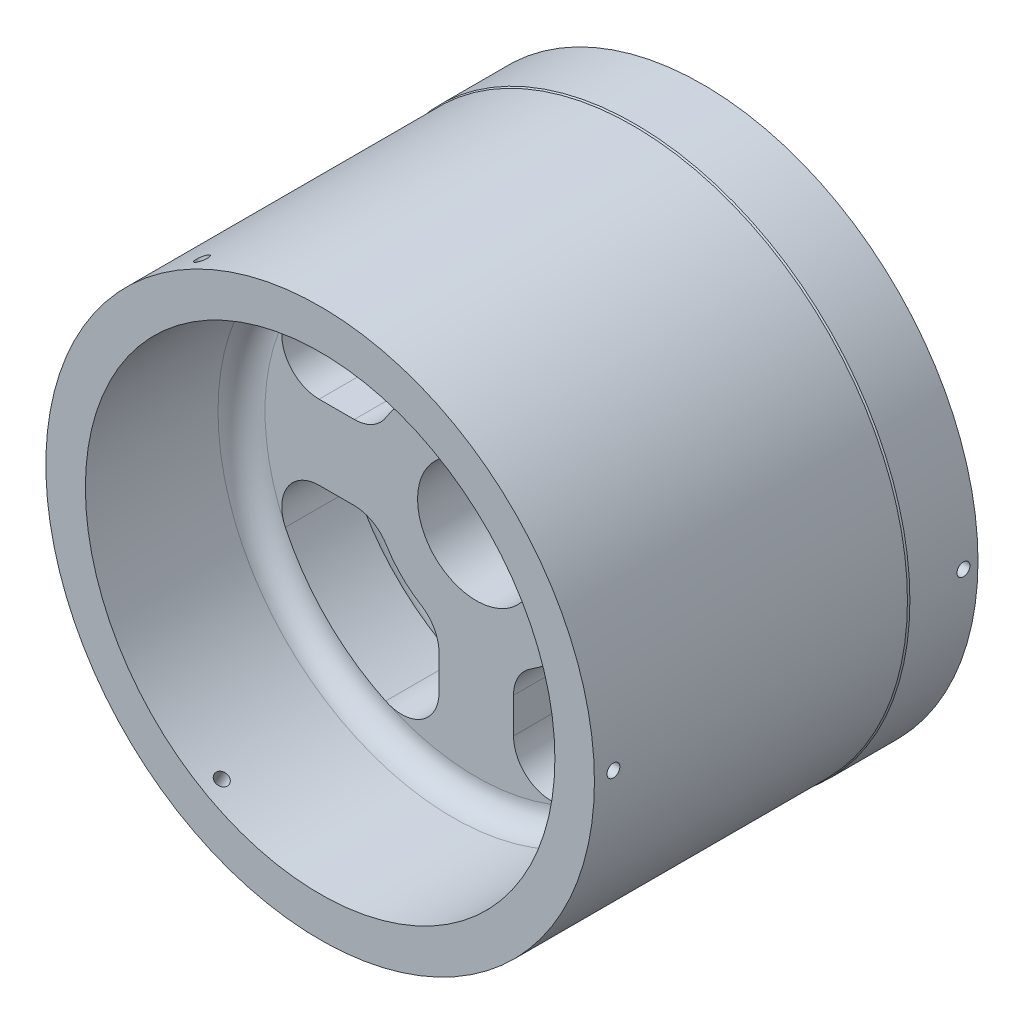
ISO-10303-21;
HEADER;
FILE_DESCRIPTION(('STEP AP214'),'2;1');
FILE_NAME('part.step','',(''),(''),'','','');
FILE_SCHEMA(('AUTOMOTIVE_DESIGN { 1 0 10303 214 1 1 1 1 }'));
ENDSEC;
DATA;
#1=APPLICATION_CONTEXT('core data for automotive mechanical design processes');
#2=APPLICATION_PROTOCOL_DEFINITION('international standard','automotive_design',2000,#1);
#3=PRODUCT_CONTEXT('',#1,'mechanical');
#4=PRODUCT('Part','Part','',(#3));
#5=PRODUCT_RELATED_PRODUCT_CATEGORY('part','',(#4));
#6=PRODUCT_DEFINITION_FORMATION('','',#4);
#7=PRODUCT_DEFINITION_CONTEXT('part definition',#1,'design');
#8=PRODUCT_DEFINITION('design','',#6,#7);
#9=PRODUCT_DEFINITION_SHAPE('','',#8);
#10=(LENGTH_UNIT() NAMED_UNIT(*) SI_UNIT(.MILLI.,.METRE.));
#11=(NAMED_UNIT(*) PLANE_ANGLE_UNIT() SI_UNIT($,.RADIAN.));
#12=(NAMED_UNIT(*) SI_UNIT($,.STERADIAN.) SOLID_ANGLE_UNIT());
#13=UNCERTAINTY_MEASURE_WITH_UNIT(LENGTH_MEASURE(1.E-05),#10,'distance_accuracy_value','');
#14=(GEOMETRIC_REPRESENTATION_CONTEXT(3) GLOBAL_UNCERTAINTY_ASSIGNED_CONTEXT((#13)) GLOBAL_UNIT_ASSIGNED_CONTEXT((#10,
#11,#12)) REPRESENTATION_CONTEXT('',''));
#15=CARTESIAN_POINT('',(0.,0.,0.));
#16=DIRECTION('',(0.,0.,1.));
#17=DIRECTION('',(1.,0.,0.));
#18=AXIS2_PLACEMENT_3D('',#15,#16,#17);
#19=CARTESIAN_POINT('',(0.,0.,0.));
#20=DIRECTION('',(0.,0.,1.));
#21=DIRECTION('',(1.,0.,0.));
#22=AXIS2_PLACEMENT_3D('',#19,#20,#21);
#23=CYLINDRICAL_SURFACE('',#22,20.);
#24=CARTESIAN_POINT('',(-20.,0.,2.1663520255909));
#25=CARTESIAN_POINT('',(-19.9999998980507,0.0308874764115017,2.16635065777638));
#26=CARTESIAN_POINT('',(-19.9999276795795,0.0617972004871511,2.16374137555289));
#27=CARTESIAN_POINT('',(-19.9996465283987,0.122764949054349,2.1533688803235));
#28=CARTESIAN_POINT('',(-19.9994374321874,0.152821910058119,2.14559950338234));
#29=CARTESIAN_POINT('',(-19.9989062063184,0.211192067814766,2.12512854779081));
#30=CARTESIAN_POINT('',(-19.9985841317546,0.239506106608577,2.11242937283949));
#31=CARTESIAN_POINT('',(-19.9978632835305,0.293592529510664,2.08246272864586));
#32=CARTESIAN_POINT('',(-19.9974645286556,0.319365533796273,2.06519637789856));
#33=CARTESIAN_POINT('',(-19.9966350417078,0.367656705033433,2.0265771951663));
#34=CARTESIAN_POINT('',(-19.9962042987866,0.39017376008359,2.00522297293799));
#35=CARTESIAN_POINT('',(-19.9953594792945,0.431304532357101,1.95903655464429));
#36=CARTESIAN_POINT('',(-19.9949454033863,0.449918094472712,1.9342042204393));
#37=CARTESIAN_POINT('',(-19.9941805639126,0.482714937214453,1.88176274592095));
#38=CARTESIAN_POINT('',(-19.9938298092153,0.496897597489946,1.85415321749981));
#39=CARTESIAN_POINT('',(-19.9932312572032,0.520425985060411,1.79694386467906));
#40=CARTESIAN_POINT('',(-19.9929834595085,0.529771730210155,1.76734404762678));
#41=CARTESIAN_POINT('',(-19.9926188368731,0.543358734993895,1.70700231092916));
#42=CARTESIAN_POINT('',(-19.992501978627,0.547601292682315,1.67626068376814));
#43=CARTESIAN_POINT('',(-19.9924123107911,0.55086548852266,1.61450136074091));
#44=CARTESIAN_POINT('',(-19.9924395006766,0.549887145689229,1.58348366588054));
#45=CARTESIAN_POINT('',(-19.9926348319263,0.542738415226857,1.5220614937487));
#46=CARTESIAN_POINT('',(-19.9928029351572,0.536569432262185,1.49165685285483));
#47=CARTESIAN_POINT('',(-19.9932610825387,0.519216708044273,1.43231490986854));
#48=CARTESIAN_POINT('',(-19.9935511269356,0.508032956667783,1.40337761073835));
#49=CARTESIAN_POINT('',(-19.9942205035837,0.480966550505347,1.34778726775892));
#50=CARTESIAN_POINT('',(-19.9945998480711,0.46508325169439,1.32113453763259));
#51=CARTESIAN_POINT('',(-19.9954050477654,0.429069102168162,1.27087335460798));
#52=CARTESIAN_POINT('',(-19.9958309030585,0.408938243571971,1.24726490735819));
#53=CARTESIAN_POINT('',(-19.9966812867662,0.364992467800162,1.2037542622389));
#54=CARTESIAN_POINT('',(-19.9971058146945,0.341176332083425,1.18385329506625));
#55=CARTESIAN_POINT('',(-19.9979055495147,0.290540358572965,1.14833200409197));
#56=CARTESIAN_POINT('',(-19.9982807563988,0.263720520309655,1.13271168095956));
#57=CARTESIAN_POINT('',(-19.9989395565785,0.207837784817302,1.10619522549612));
#58=CARTESIAN_POINT('',(-19.9992231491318,0.178774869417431,1.09529913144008));
#59=CARTESIAN_POINT('',(-19.9996667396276,0.119231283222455,1.07854122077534));
#60=CARTESIAN_POINT('',(-19.9998267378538,0.0887506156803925,1.07267939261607));
#61=CARTESIAN_POINT('',(-20.0000050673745,0.0272474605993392,1.0661579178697));
#62=CARTESIAN_POINT('',(-20.0000234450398,-0.00377484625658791,1.06549656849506));
#63=CARTESIAN_POINT('',(-19.9999165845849,-0.0654900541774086,1.06939038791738));
#64=CARTESIAN_POINT('',(-19.9997913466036,-0.0961829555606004,1.07394555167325));
#65=CARTESIAN_POINT('',(-19.9994114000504,-0.156363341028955,1.08814168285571));
#66=CARTESIAN_POINT('',(-19.9991567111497,-0.18585100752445,1.09778187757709));
#67=CARTESIAN_POINT('',(-19.9985465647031,-0.242789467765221,1.12187363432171));
#68=CARTESIAN_POINT('',(-19.9981911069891,-0.27024025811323,1.13632520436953));
#69=CARTESIAN_POINT('',(-19.9974193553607,-0.322333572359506,1.16963386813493));
#70=CARTESIAN_POINT('',(-19.9970030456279,-0.346975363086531,1.18849210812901));
#71=CARTESIAN_POINT('',(-19.9961565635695,-0.392743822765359,1.23007711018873));
#72=CARTESIAN_POINT('',(-19.9957263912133,-0.413870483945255,1.25280388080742));
#73=CARTESIAN_POINT('',(-19.9949005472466,-0.452014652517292,1.3014881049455));
#74=CARTESIAN_POINT('',(-19.994504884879,-0.469031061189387,1.32744641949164));
#75=CARTESIAN_POINT('',(-19.9937928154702,-0.498464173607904,1.38185246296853));
#76=CARTESIAN_POINT('',(-19.9934764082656,-0.51088088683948,1.41030018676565));
#77=CARTESIAN_POINT('',(-19.9929585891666,-0.530760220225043,1.46887337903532));
#78=CARTESIAN_POINT('',(-19.992757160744,-0.538223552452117,1.49899860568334));
#79=CARTESIAN_POINT('',(-19.9924919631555,-0.54798660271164,1.56007509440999));
#80=CARTESIAN_POINT('',(-19.9924281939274,-0.550286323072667,1.59102635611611));
#81=CARTESIAN_POINT('',(-19.9924455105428,-0.549656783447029,1.65286530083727));
#82=CARTESIAN_POINT('',(-19.9925265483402,-0.546729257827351,1.68375300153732));
#83=CARTESIAN_POINT('',(-19.9928242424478,-0.535731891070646,1.74459833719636));
#84=CARTESIAN_POINT('',(-19.9930408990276,-0.527662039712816,1.77455597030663));
#85=CARTESIAN_POINT('',(-19.9935854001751,-0.506609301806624,1.83269152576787));
#86=CARTESIAN_POINT('',(-19.9939132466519,-0.493626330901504,1.86086941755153));
#87=CARTESIAN_POINT('',(-19.9946431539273,-0.463116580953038,1.9146449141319));
#88=CARTESIAN_POINT('',(-19.9950452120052,-0.445589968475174,1.9402426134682));
#89=CARTESIAN_POINT('',(-19.9958783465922,-0.406485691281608,1.98813885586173));
#90=CARTESIAN_POINT('',(-19.996309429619,-0.38490711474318,2.01043665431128));
#91=CARTESIAN_POINT('',(-19.9971520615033,-0.338306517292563,2.05109913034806));
#92=CARTESIAN_POINT('',(-19.9975636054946,-0.313283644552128,2.0694628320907));
#93=CARTESIAN_POINT('',(-19.9983208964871,-0.26049584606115,2.10173847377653));
#94=CARTESIAN_POINT('',(-19.9986666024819,-0.232729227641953,2.11564764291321));
#95=CARTESIAN_POINT('',(-19.9992524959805,-0.175275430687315,2.13859064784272));
#96=CARTESIAN_POINT('',(-19.9994928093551,-0.145590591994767,2.14763030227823));
#97=CARTESIAN_POINT('',(-19.9997765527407,-0.0964316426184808,2.15817989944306));
#98=CARTESIAN_POINT('',(-19.9998599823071,-0.0772766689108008,2.16124059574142));
#99=CARTESIAN_POINT('',(-19.999971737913,-0.0387507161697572,2.16532708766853));
#100=CARTESIAN_POINT('',(-20.0000000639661,-0.0193797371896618,2.1663528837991));
#101=CARTESIAN_POINT('',(-20.,0.,2.1663520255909));
#102=B_SPLINE_CURVE_WITH_KNOTS('',3,(#24,#25,#26,#27,#28,#29,#30,#31,#32,#33,#34,#35,#36,#37,
#38,#39,#40,#41,#42,#43,#44,#45,#46,#47,#48,#49,#50,#51,#52,#53,#54,#55,#56,#57,#58,#59,#60,#61,
#62,#63,#64,#65,#66,#67,#68,#69,#70,#71,#72,#73,#74,#75,#76,#77,#78,#79,#80,#81,#82,#83,#84,#85,
#86,#87,#88,#89,#90,#91,#92,#93,#94,#95,#96,#97,#98,#99,#100,#101),.UNSPECIFIED.,.T.,.F.,(4,2,2,
2,2,2,2,2,2,2,2,2,2,2,2,2,2,2,2,2,2,2,2,2,2,2,2,2,2,2,2,2,2,2,2,2,2,2,4),(0.,0.0925916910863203,
0.185294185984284,0.27795153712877,0.370586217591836,0.463252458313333,0.5559223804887,
0.648605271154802,0.741287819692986,0.833946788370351,0.926605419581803,1.01923898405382,
1.11187273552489,1.20451918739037,1.29716581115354,1.38984313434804,1.4825204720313,
1.57519856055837,1.66787643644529,1.76052396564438,1.85317140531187,1.9458047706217,
2.03843829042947,2.13109593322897,2.22375378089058,2.3164363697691,2.40911876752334,
2.50178783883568,2.59445686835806,2.68709515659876,2.7797336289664,2.87237369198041,
2.9650103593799,3.05766789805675,3.15034839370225,3.24308642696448,3.33571339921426,
3.39380824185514,3.4519030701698),.UNSPECIFIED.);
#103=CARTESIAN_POINT('',(-20.,0.,2.1663520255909));
#104=VERTEX_POINT('',#103);
#105=EDGE_CURVE('E394',#104,#104,#102,.T.);
#106=ORIENTED_EDGE('',*,*,#105,.T.);
#107=EDGE_LOOP('',(#106));
#108=FACE_BOUND('',#107,.T.);
#109=CARTESIAN_POINT('',(20.,0.,1.06635202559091));
#110=CARTESIAN_POINT('',(19.9999998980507,0.0308874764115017,1.06635339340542));
#111=CARTESIAN_POINT('',(19.9999276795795,0.0617972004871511,1.06896267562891));
#112=CARTESIAN_POINT('',(19.9996465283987,0.122764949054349,1.0793351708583));
#113=CARTESIAN_POINT('',(19.9994374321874,0.152821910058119,1.08710454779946));
#114=CARTESIAN_POINT('',(19.9989062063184,0.211192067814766,1.107575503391));
#115=CARTESIAN_POINT('',(19.9985841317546,0.239506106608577,1.12027467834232));
#116=CARTESIAN_POINT('',(19.9978632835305,0.293592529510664,1.15024132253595));
#117=CARTESIAN_POINT('',(19.9974645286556,0.319365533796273,1.16750767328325));
#118=CARTESIAN_POINT('',(19.9966350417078,0.367656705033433,1.2061268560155));
#119=CARTESIAN_POINT('',(19.9962042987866,0.39017376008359,1.22748107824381));
#120=CARTESIAN_POINT('',(19.9953594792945,0.431304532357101,1.27366749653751));
#121=CARTESIAN_POINT('',(19.9949454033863,0.449918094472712,1.2984998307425));
#122=CARTESIAN_POINT('',(19.9941805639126,0.482714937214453,1.35094130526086));
#123=CARTESIAN_POINT('',(19.9938298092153,0.496897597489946,1.378550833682));
#124=CARTESIAN_POINT('',(19.9932312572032,0.520425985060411,1.43576018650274));
#125=CARTESIAN_POINT('',(19.9929834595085,0.529771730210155,1.46536000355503));
#126=CARTESIAN_POINT('',(19.9926188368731,0.543358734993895,1.52570174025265));
#127=CARTESIAN_POINT('',(19.992501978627,0.547601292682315,1.55644336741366));
#128=CARTESIAN_POINT('',(19.9924123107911,0.55086548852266,1.6182026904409));
#129=CARTESIAN_POINT('',(19.9924395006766,0.549887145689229,1.64922038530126));
#130=CARTESIAN_POINT('',(19.9926348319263,0.542738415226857,1.7106425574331));
#131=CARTESIAN_POINT('',(19.9928029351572,0.536569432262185,1.74104719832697));
#132=CARTESIAN_POINT('',(19.9932610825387,0.519216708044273,1.80038914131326));
#133=CARTESIAN_POINT('',(19.9935511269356,0.508032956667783,1.82932644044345));
#134=CARTESIAN_POINT('',(19.9942205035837,0.480966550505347,1.88491678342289));
#135=CARTESIAN_POINT('',(19.9945998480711,0.46508325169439,1.91156951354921));
#136=CARTESIAN_POINT('',(19.9954050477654,0.429069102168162,1.96183069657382));
#137=CARTESIAN_POINT('',(19.9958309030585,0.408938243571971,1.98543914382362));
#138=CARTESIAN_POINT('',(19.9966812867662,0.364992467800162,2.0289497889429));
#139=CARTESIAN_POINT('',(19.9971058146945,0.341176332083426,2.04885075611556));
#140=CARTESIAN_POINT('',(19.9979055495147,0.290540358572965,2.08437204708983));
#141=CARTESIAN_POINT('',(19.9982807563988,0.263720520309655,2.09999237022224));
#142=CARTESIAN_POINT('',(19.9989395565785,0.207837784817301,2.12650882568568));
#143=CARTESIAN_POINT('',(19.9992231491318,0.178774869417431,2.13740491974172));
#144=CARTESIAN_POINT('',(19.9996667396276,0.119231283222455,2.15416283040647));
#145=CARTESIAN_POINT('',(19.9998267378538,0.0887506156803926,2.16002465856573));
#146=CARTESIAN_POINT('',(20.0000050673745,0.0272474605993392,2.1665461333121));
#147=CARTESIAN_POINT('',(20.0000234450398,-0.00377484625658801,2.16720748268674));
#148=CARTESIAN_POINT('',(19.9999165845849,-0.0654900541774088,2.16331366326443));
#149=CARTESIAN_POINT('',(19.9997913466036,-0.0961829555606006,2.15875849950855));
#150=CARTESIAN_POINT('',(19.9994114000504,-0.156363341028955,2.14456236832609));
#151=CARTESIAN_POINT('',(19.9991567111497,-0.18585100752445,2.13492217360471));
#152=CARTESIAN_POINT('',(19.9985465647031,-0.242789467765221,2.1108304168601));
#153=CARTESIAN_POINT('',(19.9981911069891,-0.27024025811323,2.09637884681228));
#154=CARTESIAN_POINT('',(19.9974193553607,-0.322333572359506,2.06307018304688));
#155=CARTESIAN_POINT('',(19.9970030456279,-0.346975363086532,2.0442119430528));
#156=CARTESIAN_POINT('',(19.9961565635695,-0.392743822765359,2.00262694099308));
#157=CARTESIAN_POINT('',(19.9957263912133,-0.413870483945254,1.97990017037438));
#158=CARTESIAN_POINT('',(19.9949005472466,-0.452014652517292,1.93121594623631));
#159=CARTESIAN_POINT('',(19.994504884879,-0.469031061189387,1.90525763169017));
#160=CARTESIAN_POINT('',(19.9937928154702,-0.498464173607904,1.85085158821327));
#161=CARTESIAN_POINT('',(19.9934764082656,-0.510880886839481,1.82240386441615));
#162=CARTESIAN_POINT('',(19.9929585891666,-0.530760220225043,1.76383067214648));
#163=CARTESIAN_POINT('',(19.992757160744,-0.538223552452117,1.73370544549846));
#164=CARTESIAN_POINT('',(19.9924919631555,-0.54798660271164,1.67262895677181));
#165=CARTESIAN_POINT('',(19.9924281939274,-0.550286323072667,1.64167769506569));
#166=CARTESIAN_POINT('',(19.9924455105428,-0.549656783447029,1.57983875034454));
#167=CARTESIAN_POINT('',(19.9925265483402,-0.546729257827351,1.54895104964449));
#168=CARTESIAN_POINT('',(19.9928242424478,-0.535731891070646,1.48810571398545));
#169=CARTESIAN_POINT('',(19.9930408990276,-0.527662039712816,1.45814808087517));
#170=CARTESIAN_POINT('',(19.9935854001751,-0.506609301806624,1.40001252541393));
#171=CARTESIAN_POINT('',(19.9939132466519,-0.493626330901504,1.37183463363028));
#172=CARTESIAN_POINT('',(19.9946431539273,-0.463116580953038,1.31805913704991));
#173=CARTESIAN_POINT('',(19.9950452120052,-0.445589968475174,1.29246143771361));
#174=CARTESIAN_POINT('',(19.9958783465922,-0.406485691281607,1.24456519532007));
#175=CARTESIAN_POINT('',(19.996309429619,-0.384907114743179,1.22226739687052));
#176=CARTESIAN_POINT('',(19.9971520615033,-0.338306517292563,1.18160492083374));
#177=CARTESIAN_POINT('',(19.9975636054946,-0.313283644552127,1.16324121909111));
#178=CARTESIAN_POINT('',(19.9983208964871,-0.26049584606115,1.13096557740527));
#179=CARTESIAN_POINT('',(19.9986666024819,-0.232729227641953,1.11705640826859));
#180=CARTESIAN_POINT('',(19.9992524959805,-0.175275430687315,1.09411340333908));
#181=CARTESIAN_POINT('',(19.9994928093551,-0.145590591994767,1.08507374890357));
#182=CARTESIAN_POINT('',(19.9997765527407,-0.0964316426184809,1.07452415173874));
#183=CARTESIAN_POINT('',(19.9998599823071,-0.0772766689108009,1.07146345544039));
#184=CARTESIAN_POINT('',(19.999971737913,-0.0387507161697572,1.06737696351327));
#185=CARTESIAN_POINT('',(20.0000000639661,-0.0193797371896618,1.0663511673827));
#186=CARTESIAN_POINT('',(20.,0.,1.06635202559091));
#187=B_SPLINE_CURVE_WITH_KNOTS('',3,(#109,#110,#111,#112,#113,#114,#115,#116,#117,#118,#119,
#120,#121,#122,#123,#124,#125,#126,#127,#128,#129,#130,#131,#132,#133,#134,#135,#136,#137,#138,
#139,#140,#141,#142,#143,#144,#145,#146,#147,#148,#149,#150,#151,#152,#153,#154,#155,#156,#157,
#158,#159,#160,#161,#162,#163,#164,#165,#166,#167,#168,#169,#170,#171,#172,#173,#174,#175,#176,
#177,#178,#179,#180,#181,#182,#183,#184,#185,#186),.UNSPECIFIED.,.T.,.F.,(4,2,2,2,2,2,2,2,2,2,2,
2,2,2,2,2,2,2,2,2,2,2,2,2,2,2,2,2,2,2,2,2,2,2,2,2,2,2,4),(0.,0.0925916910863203,
0.185294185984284,0.27795153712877,0.370586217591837,0.463252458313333,0.555922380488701,
0.648605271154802,0.741287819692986,0.833946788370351,0.926605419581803,1.01923898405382,
1.11187273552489,1.20451918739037,1.29716581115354,1.38984313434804,1.48252047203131,
1.57519856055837,1.66787643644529,1.76052396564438,1.85317140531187,1.9458047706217,
2.03843829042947,2.13109593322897,2.22375378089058,2.3164363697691,2.40911876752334,
2.50178783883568,2.59445686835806,2.68709515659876,2.7797336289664,2.87237369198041,
2.9650103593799,3.05766789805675,3.15034839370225,3.24308642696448,3.33571339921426,
3.39380824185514,3.4519030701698),.UNSPECIFIED.);
#188=CARTESIAN_POINT('',(20.,0.,1.06635202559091));
#189=VERTEX_POINT('',#188);
#190=EDGE_CURVE('E348',#189,#189,#187,.T.);
#191=ORIENTED_EDGE('',*,*,#190,.T.);
#192=EDGE_LOOP('',(#191));
#193=FACE_BOUND('',#192,.T.);
#194=CARTESIAN_POINT('',(0.,0.,0.376931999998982));
#195=DIRECTION('',(0.,0.,1.));
#196=DIRECTION('',(1.,0.,0.));
#197=AXIS2_PLACEMENT_3D('',#194,#195,#196);
#198=CIRCLE('',#197,20.);
#199=CARTESIAN_POINT('',(20.,0.,0.376931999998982));
#200=VERTEX_POINT('',#199);
#201=EDGE_CURVE('E494',#200,#200,#198,.T.);
#202=ORIENTED_EDGE('',*,*,#201,.F.);
#203=EDGE_LOOP('',(#202));
#204=FACE_BOUND('',#203,.T.);
#205=CARTESIAN_POINT('',(0.,0.,11.676931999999));
#206=DIRECTION('',(0.,0.,1.));
#207=DIRECTION('',(1.,0.,0.));
#208=AXIS2_PLACEMENT_3D('',#205,#206,#207);
#209=CIRCLE('',#208,20.);
#210=CARTESIAN_POINT('',(20.,0.,11.676931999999));
#211=VERTEX_POINT('',#210);
#212=EDGE_CURVE('E519',#211,#211,#209,.T.);
#213=ORIENTED_EDGE('',*,*,#212,.T.);
#214=EDGE_LOOP('',(#213));
#215=FACE_BOUND('',#214,.T.);
#216=ADVANCED_FACE('F46',(#108,#193,#204,#215),#23,.F.);
#217=CARTESIAN_POINT('',(0.,0.,11.676931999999));
#218=DIRECTION('',(0.,0.,1.));
#219=DIRECTION('',(1.,0.,0.));
#220=AXIS2_PLACEMENT_3D('',#217,#218,#219);
#221=TOROIDAL_SURFACE('',#220,18.,2.);
#222=ORIENTED_EDGE('',*,*,#212,.F.);
#223=EDGE_LOOP('',(#222));
#224=FACE_BOUND('',#223,.T.);
#225=CARTESIAN_POINT('',(0.,0.,13.676931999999));
#226=DIRECTION('',(0.,0.,1.));
#227=DIRECTION('',(1.,0.,0.));
#228=AXIS2_PLACEMENT_3D('',#225,#226,#227);
#229=CIRCLE('',#228,18.);
#230=CARTESIAN_POINT('',(-7.71862348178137,16.261083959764,13.676931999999));
#231=VERTEX_POINT('',#230);
#232=CARTESIAN_POINT('',(-16.261083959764,7.71862348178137,13.676931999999));
#233=VERTEX_POINT('',#232);
#234=EDGE_CURVE('E515',#231,#233,#229,.T.);
#235=ORIENTED_EDGE('',*,*,#234,.T.);
#236=CARTESIAN_POINT('',(-16.2610839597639,-7.71862348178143,13.676931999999));
#237=VERTEX_POINT('',#236);
#238=EDGE_CURVE('E520',#233,#237,#229,.T.);
#239=ORIENTED_EDGE('',*,*,#238,.T.);
#240=CARTESIAN_POINT('',(0.,0.,13.676931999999));
#241=DIRECTION('',(0.,0.,1.));
#242=DIRECTION('',(1.,0.,0.));
#243=AXIS2_PLACEMENT_3D('',#240,#241,#242);
#244=CIRCLE('',#243,18.);
#245=CARTESIAN_POINT('',(-7.71862348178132,-16.261083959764,13.676931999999));
#246=VERTEX_POINT('',#245);
#247=EDGE_CURVE('E622',#237,#246,#244,.T.);
#248=ORIENTED_EDGE('',*,*,#247,.T.);
#249=CARTESIAN_POINT('',(7.71862348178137,-16.261083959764,13.676931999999));
#250=VERTEX_POINT('',#249);
#251=EDGE_CURVE('E823',#246,#250,#229,.T.);
#252=ORIENTED_EDGE('',*,*,#251,.T.);
#253=CARTESIAN_POINT('',(0.,0.,13.676931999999));
#254=DIRECTION('',(0.,0.,1.));
#255=DIRECTION('',(1.,0.,0.));
#256=AXIS2_PLACEMENT_3D('',#253,#254,#255);
#257=CIRCLE('',#256,18.);
#258=CARTESIAN_POINT('',(16.261083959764,-7.71862348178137,13.676931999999));
#259=VERTEX_POINT('',#258);
#260=EDGE_CURVE('E602',#250,#259,#257,.T.);
#261=ORIENTED_EDGE('',*,*,#260,.T.);
#262=CARTESIAN_POINT('',(16.2610839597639,7.71862348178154,13.676931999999));
#263=VERTEX_POINT('',#262);
#264=EDGE_CURVE('E827',#259,#263,#229,.T.);
#265=ORIENTED_EDGE('',*,*,#264,.T.);
#266=CARTESIAN_POINT('',(0.,0.,13.676931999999));
#267=DIRECTION('',(0.,0.,1.));
#268=DIRECTION('',(1.,0.,0.));
#269=AXIS2_PLACEMENT_3D('',#266,#267,#268);
#270=CIRCLE('',#269,18.);
#271=CARTESIAN_POINT('',(7.71862348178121,16.261083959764,13.676931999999));
#272=VERTEX_POINT('',#271);
#273=EDGE_CURVE('E582',#263,#272,#270,.T.);
#274=ORIENTED_EDGE('',*,*,#273,.T.);
#275=EDGE_CURVE('E513',#272,#231,#229,.T.);
#276=ORIENTED_EDGE('',*,*,#275,.T.);
#277=EDGE_LOOP('',(#235,#239,#248,#252,#261,#265,#274,#276));
#278=FACE_BOUND('',#277,.T.);
#279=ADVANCED_FACE('F403',(#224,#278),#221,.F.);
#280=CARTESIAN_POINT('',(0.,0.,13.676931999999));
#281=DIRECTION('',(0.,0.,1.));
#282=DIRECTION('',(1.,0.,0.));
#283=AXIS2_PLACEMENT_3D('',#280,#281,#282);
#284=PLANE('',#283);
#285=CARTESIAN_POINT('',(0.,0.,13.676931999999));
#286=DIRECTION('',(0.,0.,1.));
#287=DIRECTION('',(1.,0.,0.));
#288=AXIS2_PLACEMENT_3D('',#285,#286,#287);
#289=CIRCLE('',#288,5.2);
#290=CARTESIAN_POINT('',(5.2,0.,13.676931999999));
#291=VERTEX_POINT('',#290);
#292=EDGE_CURVE('E352',#291,#291,#289,.T.);
#293=ORIENTED_EDGE('',*,*,#292,.T.);
#294=EDGE_LOOP('',(#293));
#295=FACE_BOUND('',#294,.T.);
#296=DIRECTION('',(-1.,0.,0.));
#297=VECTOR('',#296,1.);
#298=CARTESIAN_POINT('',(0.,-3.175,13.676931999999));
#299=LINE('',#298,#297);
#300=CARTESIAN_POINT('',(-10.3906869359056,-3.17500000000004,13.676931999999));
#301=VERTEX_POINT('',#300);
#302=CARTESIAN_POINT('',(-13.3882924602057,-3.17500000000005,13.676931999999));
#303=VERTEX_POINT('',#302);
#304=EDGE_CURVE('E667',#301,#303,#299,.T.);
#305=ORIENTED_EDGE('',*,*,#304,.T.);
#306=CARTESIAN_POINT('',(-13.3882924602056,-6.35500000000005,13.676931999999));
#307=DIRECTION('',(0.,0.,1.));
#308=DIRECTION('',(1.,0.,0.));
#309=AXIS2_PLACEMENT_3D('',#306,#307,#308);
#310=CIRCLE('',#309,3.18);
#311=EDGE_CURVE('E630',#303,#237,#310,.T.);
#312=ORIENTED_EDGE('',*,*,#311,.T.);
#313=ORIENTED_EDGE('',*,*,#238,.F.);
#314=CARTESIAN_POINT('',(-13.3882924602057,6.355,13.676931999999));
#315=DIRECTION('',(0.,0.,1.));
#316=DIRECTION('',(1.,0.,0.));
#317=AXIS2_PLACEMENT_3D('',#314,#315,#316);
#318=CIRCLE('',#317,3.18);
#319=CARTESIAN_POINT('',(-13.3882924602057,3.175,13.676931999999));
#320=VERTEX_POINT('',#319);
#321=EDGE_CURVE('E722',#233,#320,#318,.T.);
#322=ORIENTED_EDGE('',*,*,#321,.T.);
#323=DIRECTION('',(1.,0.,0.));
#324=VECTOR('',#323,1.);
#325=CARTESIAN_POINT('',(0.,3.175,13.676931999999));
#326=LINE('',#325,#324);
#327=CARTESIAN_POINT('',(-10.3906869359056,3.175,13.676931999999));
#328=VERTEX_POINT('',#327);
#329=EDGE_CURVE('E750',#320,#328,#326,.T.);
#330=ORIENTED_EDGE('',*,*,#329,.T.);
#331=CARTESIAN_POINT('',(-10.3906869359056,6.355,13.676931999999));
#332=DIRECTION('',(0.,0.,1.));
#333=DIRECTION('',(1.,0.,0.));
#334=AXIS2_PLACEMENT_3D('',#331,#332,#333);
#335=CIRCLE('',#334,3.18);
#336=CARTESIAN_POINT('',(-7.67784748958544,4.69581280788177,13.676931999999));
#337=VERTEX_POINT('',#336);
#338=EDGE_CURVE('E746',#328,#337,#335,.T.);
#339=ORIENTED_EDGE('',*,*,#338,.T.);
#340=CARTESIAN_POINT('',(0.,0.,13.676931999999));
#341=DIRECTION('',(0.,0.,1.));
#342=DIRECTION('',(1.,0.,0.));
#343=AXIS2_PLACEMENT_3D('',#340,#341,#342);
#344=CIRCLE('',#343,9.);
#345=CARTESIAN_POINT('',(-4.69581280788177,7.67784748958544,13.676931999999));
#346=VERTEX_POINT('',#345);
#347=EDGE_CURVE('E742',#337,#346,#344,.F.);
#348=ORIENTED_EDGE('',*,*,#347,.T.);
#349=CARTESIAN_POINT('',(-6.355,10.3906869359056,13.676931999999));
#350=DIRECTION('',(0.,0.,1.));
#351=DIRECTION('',(1.,0.,0.));
#352=AXIS2_PLACEMENT_3D('',#349,#350,#351);
#353=CIRCLE('',#352,3.18);
#354=CARTESIAN_POINT('',(-3.175,10.3906869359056,13.676931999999));
#355=VERTEX_POINT('',#354);
#356=EDGE_CURVE('E738',#346,#355,#353,.T.);
#357=ORIENTED_EDGE('',*,*,#356,.T.);
#358=DIRECTION('',(0.,1.,0.));
#359=VECTOR('',#358,1.);
#360=CARTESIAN_POINT('',(-3.175,0.,13.676931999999));
#361=LINE('',#360,#359);
#362=CARTESIAN_POINT('',(-3.175,13.3882924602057,13.676931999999));
#363=VERTEX_POINT('',#362);
#364=EDGE_CURVE('E734',#355,#363,#361,.T.);
#365=ORIENTED_EDGE('',*,*,#364,.T.);
#366=CARTESIAN_POINT('',(-6.355,13.3882924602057,13.676931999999));
#367=DIRECTION('',(0.,0.,1.));
#368=DIRECTION('',(1.,0.,0.));
#369=AXIS2_PLACEMENT_3D('',#366,#367,#368);
#370=CIRCLE('',#369,3.18);
#371=EDGE_CURVE('E730',#363,#231,#370,.T.);
#372=ORIENTED_EDGE('',*,*,#371,.T.);
#373=ORIENTED_EDGE('',*,*,#275,.F.);
#374=CARTESIAN_POINT('',(6.35499999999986,13.3882924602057,13.676931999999));
#375=DIRECTION('',(0.,0.,1.));
#376=DIRECTION('',(1.,0.,0.));
#377=AXIS2_PLACEMENT_3D('',#374,#375,#376);
#378=CIRCLE('',#377,3.18);
#379=CARTESIAN_POINT('',(3.17499999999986,13.3882924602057,13.676931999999));
#380=VERTEX_POINT('',#379);
#381=EDGE_CURVE('E274',#272,#380,#378,.T.);
#382=ORIENTED_EDGE('',*,*,#381,.T.);
#383=DIRECTION('',(0.,-1.,0.));
#384=VECTOR('',#383,1.);
#385=CARTESIAN_POINT('',(3.175,0.,13.676931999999));
#386=LINE('',#385,#384);
#387=CARTESIAN_POINT('',(3.17499999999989,10.3906869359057,13.676931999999));
#388=VERTEX_POINT('',#387);
#389=EDGE_CURVE('E283',#380,#388,#386,.T.);
#390=ORIENTED_EDGE('',*,*,#389,.T.);
#391=CARTESIAN_POINT('',(6.35499999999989,10.3906869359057,13.676931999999));
#392=DIRECTION('',(0.,0.,1.));
#393=DIRECTION('',(1.,0.,0.));
#394=AXIS2_PLACEMENT_3D('',#391,#392,#393);
#395=CIRCLE('',#394,3.18);
#396=CARTESIAN_POINT('',(4.69581280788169,7.67784748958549,13.676931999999));
#397=VERTEX_POINT('',#396);
#398=EDGE_CURVE('E642',#388,#397,#395,.T.);
#399=ORIENTED_EDGE('',*,*,#398,.T.);
#400=CARTESIAN_POINT('',(0.,0.,13.676931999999));
#401=DIRECTION('',(0.,0.,1.));
#402=DIRECTION('',(1.,0.,0.));
#403=AXIS2_PLACEMENT_3D('',#400,#401,#402);
#404=CIRCLE('',#403,9.);
#405=CARTESIAN_POINT('',(7.67784748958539,4.69581280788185,13.676931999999));
#406=VERTEX_POINT('',#405);
#407=EDGE_CURVE('E639',#397,#406,#404,.F.);
#408=ORIENTED_EDGE('',*,*,#407,.T.);
#409=CARTESIAN_POINT('',(10.3906869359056,6.35500000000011,13.676931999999));
#410=DIRECTION('',(0.,0.,1.));
#411=DIRECTION('',(1.,0.,0.));
#412=AXIS2_PLACEMENT_3D('',#409,#410,#411);
#413=CIRCLE('',#412,3.18);
#414=CARTESIAN_POINT('',(10.3906869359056,3.17500000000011,13.676931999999));
#415=VERTEX_POINT('',#414);
#416=EDGE_CURVE('E567',#406,#415,#413,.T.);
#417=ORIENTED_EDGE('',*,*,#416,.T.);
#418=DIRECTION('',(1.,0.,0.));
#419=VECTOR('',#418,1.);
#420=CARTESIAN_POINT('',(0.,3.175,13.676931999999));
#421=LINE('',#420,#419);
#422=CARTESIAN_POINT('',(13.3882924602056,3.17500000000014,13.676931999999));
#423=VERTEX_POINT('',#422);
#424=EDGE_CURVE('E634',#415,#423,#421,.T.);
#425=ORIENTED_EDGE('',*,*,#424,.T.);
#426=CARTESIAN_POINT('',(13.3882924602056,6.35500000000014,13.676931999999));
#427=DIRECTION('',(0.,0.,1.));
#428=DIRECTION('',(1.,0.,0.));
#429=AXIS2_PLACEMENT_3D('',#426,#427,#428);
#430=CIRCLE('',#429,3.18);
#431=EDGE_CURVE('E590',#423,#263,#430,.T.);
#432=ORIENTED_EDGE('',*,*,#431,.T.);
#433=ORIENTED_EDGE('',*,*,#264,.F.);
#434=CARTESIAN_POINT('',(13.3882924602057,-6.355,13.676931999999));
#435=DIRECTION('',(0.,0.,1.));
#436=DIRECTION('',(1.,0.,0.));
#437=AXIS2_PLACEMENT_3D('',#434,#435,#436);
#438=CIRCLE('',#437,3.18);
#439=CARTESIAN_POINT('',(13.3882924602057,-3.175,13.676931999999));
#440=VERTEX_POINT('',#439);
#441=EDGE_CURVE('E598',#259,#440,#438,.T.);
#442=ORIENTED_EDGE('',*,*,#441,.T.);
#443=DIRECTION('',(-1.,0.,0.));
#444=VECTOR('',#443,1.);
#445=CARTESIAN_POINT('',(0.,-3.175,13.676931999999));
#446=LINE('',#445,#444);
#447=CARTESIAN_POINT('',(10.3906869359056,-3.175,13.676931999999));
#448=VERTEX_POINT('',#447);
#449=EDGE_CURVE('E663',#440,#448,#446,.T.);
#450=ORIENTED_EDGE('',*,*,#449,.T.);
#451=CARTESIAN_POINT('',(10.3906869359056,-6.355,13.676931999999));
#452=DIRECTION('',(0.,0.,1.));
#453=DIRECTION('',(1.,0.,0.));
#454=AXIS2_PLACEMENT_3D('',#451,#452,#453);
#455=CIRCLE('',#454,3.18);
#456=CARTESIAN_POINT('',(7.67784748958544,-4.69581280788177,13.676931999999));
#457=VERTEX_POINT('',#456);
#458=EDGE_CURVE('E659',#448,#457,#455,.T.);
#459=ORIENTED_EDGE('',*,*,#458,.T.);
#460=CARTESIAN_POINT('',(0.,0.,13.676931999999));
#461=DIRECTION('',(0.,0.,1.));
#462=DIRECTION('',(1.,0.,0.));
#463=AXIS2_PLACEMENT_3D('',#460,#461,#462);
#464=CIRCLE('',#463,9.);
#465=CARTESIAN_POINT('',(4.69581280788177,-7.67784748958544,13.676931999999));
#466=VERTEX_POINT('',#465);
#467=EDGE_CURVE('E655',#457,#466,#464,.F.);
#468=ORIENTED_EDGE('',*,*,#467,.T.);
#469=CARTESIAN_POINT('',(6.355,-10.3906869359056,13.676931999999));
#470=DIRECTION('',(0.,0.,1.));
#471=DIRECTION('',(1.,0.,0.));
#472=AXIS2_PLACEMENT_3D('',#469,#470,#471);
#473=CIRCLE('',#472,3.18);
#474=CARTESIAN_POINT('',(3.175,-10.3906869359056,13.676931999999));
#475=VERTEX_POINT('',#474);
#476=EDGE_CURVE('E651',#466,#475,#473,.T.);
#477=ORIENTED_EDGE('',*,*,#476,.T.);
#478=DIRECTION('',(0.,-1.,0.));
#479=VECTOR('',#478,1.);
#480=CARTESIAN_POINT('',(3.175,0.,13.676931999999));
#481=LINE('',#480,#479);
#482=CARTESIAN_POINT('',(3.175,-13.3882924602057,13.676931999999));
#483=VERTEX_POINT('',#482);
#484=EDGE_CURVE('E647',#475,#483,#481,.T.);
#485=ORIENTED_EDGE('',*,*,#484,.T.);
#486=CARTESIAN_POINT('',(6.355,-13.3882924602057,13.676931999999));
#487=DIRECTION('',(0.,0.,1.));
#488=DIRECTION('',(1.,0.,0.));
#489=AXIS2_PLACEMENT_3D('',#486,#487,#488);
#490=CIRCLE('',#489,3.18);
#491=EDGE_CURVE('E610',#483,#250,#490,.T.);
#492=ORIENTED_EDGE('',*,*,#491,.T.);
#493=ORIENTED_EDGE('',*,*,#251,.F.);
#494=CARTESIAN_POINT('',(-6.35499999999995,-13.3882924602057,13.676931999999));
#495=DIRECTION('',(0.,0.,1.));
#496=DIRECTION('',(1.,0.,0.));
#497=AXIS2_PLACEMENT_3D('',#494,#495,#496);
#498=CIRCLE('',#497,3.18);
#499=CARTESIAN_POINT('',(-3.17499999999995,-13.3882924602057,13.676931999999));
#500=VERTEX_POINT('',#499);
#501=EDGE_CURVE('E618',#246,#500,#498,.T.);
#502=ORIENTED_EDGE('',*,*,#501,.T.);
#503=DIRECTION('',(0.,1.,0.));
#504=VECTOR('',#503,1.);
#505=CARTESIAN_POINT('',(-3.175,0.,13.676931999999));
#506=LINE('',#505,#504);
#507=CARTESIAN_POINT('',(-3.17499999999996,-10.3906869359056,13.676931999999));
#508=VERTEX_POINT('',#507);
#509=EDGE_CURVE('E683',#500,#508,#506,.T.);
#510=ORIENTED_EDGE('',*,*,#509,.T.);
#511=CARTESIAN_POINT('',(-6.35499999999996,-10.3906869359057,13.676931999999));
#512=DIRECTION('',(0.,0.,1.));
#513=DIRECTION('',(1.,0.,0.));
#514=AXIS2_PLACEMENT_3D('',#511,#512,#513);
#515=CIRCLE('',#514,3.18);
#516=CARTESIAN_POINT('',(-4.69581280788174,-7.67784748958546,13.676931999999));
#517=VERTEX_POINT('',#516);
#518=EDGE_CURVE('E679',#508,#517,#515,.T.);
#519=ORIENTED_EDGE('',*,*,#518,.T.);
#520=CARTESIAN_POINT('',(0.,0.,13.676931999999));
#521=DIRECTION('',(0.,0.,1.));
#522=DIRECTION('',(1.,0.,0.));
#523=AXIS2_PLACEMENT_3D('',#520,#521,#522);
#524=CIRCLE('',#523,9.);
#525=CARTESIAN_POINT('',(-7.67784748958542,-4.6958128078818,13.676931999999));
#526=VERTEX_POINT('',#525);
#527=EDGE_CURVE('E675',#517,#526,#524,.F.);
#528=ORIENTED_EDGE('',*,*,#527,.T.);
#529=CARTESIAN_POINT('',(-10.3906869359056,-6.35500000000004,13.676931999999));
#530=DIRECTION('',(0.,0.,1.));
#531=DIRECTION('',(1.,0.,0.));
#532=AXIS2_PLACEMENT_3D('',#529,#530,#531);
#533=CIRCLE('',#532,3.18);
#534=EDGE_CURVE('E671',#526,#301,#533,.T.);
#535=ORIENTED_EDGE('',*,*,#534,.T.);
#536=EDGE_LOOP('',(#305,#312,#313,#322,#330,#339,#348,#357,#365,#372,#373,#382,#390,#399,#408,
#417,#425,#432,#433,#442,#450,#459,#468,#477,#485,#492,#493,#502,#510,#519,#528,#535));
#537=FACE_BOUND('',#536,.T.);
#538=ADVANCED_FACE('F408',(#295,#537),#284,.F.);
#539=CARTESIAN_POINT('',(0.,18.,19.676931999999));
#540=DIRECTION('',(0.,0.,-1.));
#541=DIRECTION('',(-1.,0.,0.));
#542=AXIS2_PLACEMENT_3D('',#539,#540,#541);
#543=PLANE('',#542);
#544=CARTESIAN_POINT('',(0.,0.,19.676931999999));
#545=DIRECTION('',(0.,0.,-1.));
#546=DIRECTION('',(-1.,0.,0.));
#547=AXIS2_PLACEMENT_3D('',#544,#545,#546);
#548=CIRCLE('',#547,5.);
#549=CARTESIAN_POINT('',(-5.,0.,19.676931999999));
#550=VERTEX_POINT('',#549);
#551=EDGE_CURVE('E343',#550,#550,#548,.F.);
#552=ORIENTED_EDGE('',*,*,#551,.F.);
#553=EDGE_LOOP('',(#552));
#554=FACE_BOUND('',#553,.T.);
#555=CARTESIAN_POINT('',(0.,0.,19.676931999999));
#556=DIRECTION('',(0.,0.,1.));
#557=DIRECTION('',(1.,0.,0.));
#558=AXIS2_PLACEMENT_3D('',#555,#556,#557);
#559=CIRCLE('',#558,18.);
#560=CARTESIAN_POINT('',(-16.261083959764,7.71862348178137,19.676931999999));
#561=VERTEX_POINT('',#560);
#562=CARTESIAN_POINT('',(-16.2610839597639,-7.71862348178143,19.676931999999));
#563=VERTEX_POINT('',#562);
#564=EDGE_CURVE('E514',#561,#563,#559,.T.);
#565=ORIENTED_EDGE('',*,*,#564,.T.);
#566=CARTESIAN_POINT('',(-13.3882924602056,-6.35500000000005,19.676931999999));
#567=DIRECTION('',(0.,0.,-1.));
#568=DIRECTION('',(-1.,0.,0.));
#569=AXIS2_PLACEMENT_3D('',#566,#567,#568);
#570=CIRCLE('',#569,3.18);
#571=CARTESIAN_POINT('',(-13.3882924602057,-3.17500000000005,19.676931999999));
#572=VERTEX_POINT('',#571);
#573=EDGE_CURVE('E626',#563,#572,#570,.T.);
#574=ORIENTED_EDGE('',*,*,#573,.T.);
#575=DIRECTION('',(1.,0.,0.));
#576=VECTOR('',#575,1.);
#577=CARTESIAN_POINT('',(0.,-3.175,19.676931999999));
#578=LINE('',#577,#576);
#579=CARTESIAN_POINT('',(-10.3906869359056,-3.17500000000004,19.676931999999));
#580=VERTEX_POINT('',#579);
#581=EDGE_CURVE('E322',#572,#580,#578,.T.);
#582=ORIENTED_EDGE('',*,*,#581,.T.);
#583=CARTESIAN_POINT('',(-10.3906869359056,-6.35500000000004,19.676931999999));
#584=DIRECTION('',(0.,0.,-1.));
#585=DIRECTION('',(-1.,0.,0.));
#586=AXIS2_PLACEMENT_3D('',#583,#584,#585);
#587=CIRCLE('',#586,3.18);
#588=CARTESIAN_POINT('',(-7.67784748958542,-4.6958128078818,19.676931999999));
#589=VERTEX_POINT('',#588);
#590=EDGE_CURVE('E326',#580,#589,#587,.T.);
#591=ORIENTED_EDGE('',*,*,#590,.T.);
#592=CARTESIAN_POINT('',(0.,0.,19.676931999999));
#593=DIRECTION('',(0.,0.,-1.));
#594=DIRECTION('',(-1.,0.,0.));
#595=AXIS2_PLACEMENT_3D('',#592,#593,#594);
#596=CIRCLE('',#595,9.);
#597=CARTESIAN_POINT('',(-4.69581280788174,-7.67784748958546,19.676931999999));
#598=VERTEX_POINT('',#597);
#599=EDGE_CURVE('E330',#589,#598,#596,.F.);
#600=ORIENTED_EDGE('',*,*,#599,.T.);
#601=CARTESIAN_POINT('',(-6.35499999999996,-10.3906869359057,19.676931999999));
#602=DIRECTION('',(0.,0.,-1.));
#603=DIRECTION('',(-1.,0.,0.));
#604=AXIS2_PLACEMENT_3D('',#601,#602,#603);
#605=CIRCLE('',#604,3.18);
#606=CARTESIAN_POINT('',(-3.17499999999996,-10.3906869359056,19.676931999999));
#607=VERTEX_POINT('',#606);
#608=EDGE_CURVE('E334',#598,#607,#605,.T.);
#609=ORIENTED_EDGE('',*,*,#608,.T.);
#610=DIRECTION('',(0.,-1.,0.));
#611=VECTOR('',#610,1.);
#612=CARTESIAN_POINT('',(-3.17500000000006,18.,19.676931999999));
#613=LINE('',#612,#611);
#614=CARTESIAN_POINT('',(-3.17499999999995,-13.3882924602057,19.676931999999));
#615=VERTEX_POINT('',#614);
#616=EDGE_CURVE('E338',#607,#615,#613,.T.);
#617=ORIENTED_EDGE('',*,*,#616,.T.);
#618=CARTESIAN_POINT('',(-6.35499999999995,-13.3882924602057,19.676931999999));
#619=DIRECTION('',(0.,0.,-1.));
#620=DIRECTION('',(-1.,0.,0.));
#621=AXIS2_PLACEMENT_3D('',#618,#619,#620);
#622=CIRCLE('',#621,3.18);
#623=CARTESIAN_POINT('',(-7.71862348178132,-16.261083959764,19.676931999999));
#624=VERTEX_POINT('',#623);
#625=EDGE_CURVE('E614',#615,#624,#622,.T.);
#626=ORIENTED_EDGE('',*,*,#625,.T.);
#627=CARTESIAN_POINT('',(7.71862348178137,-16.261083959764,19.676931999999));
#628=VERTEX_POINT('',#627);
#629=EDGE_CURVE('E798',#624,#628,#559,.T.);
#630=ORIENTED_EDGE('',*,*,#629,.T.);
#631=CARTESIAN_POINT('',(6.355,-13.3882924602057,19.676931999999));
#632=DIRECTION('',(0.,0.,-1.));
#633=DIRECTION('',(-1.,0.,0.));
#634=AXIS2_PLACEMENT_3D('',#631,#632,#633);
#635=CIRCLE('',#634,3.18);
#636=CARTESIAN_POINT('',(3.175,-13.3882924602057,19.676931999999));
#637=VERTEX_POINT('',#636);
#638=EDGE_CURVE('E606',#628,#637,#635,.T.);
#639=ORIENTED_EDGE('',*,*,#638,.T.);
#640=DIRECTION('',(0.,1.,0.));
#641=VECTOR('',#640,1.);
#642=CARTESIAN_POINT('',(3.175,18.,19.676931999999));
#643=LINE('',#642,#641);
#644=CARTESIAN_POINT('',(3.175,-10.3906869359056,19.676931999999));
#645=VERTEX_POINT('',#644);
#646=EDGE_CURVE('E293',#637,#645,#643,.T.);
#647=ORIENTED_EDGE('',*,*,#646,.T.);
#648=CARTESIAN_POINT('',(6.355,-10.3906869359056,19.676931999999));
#649=DIRECTION('',(0.,0.,-1.));
#650=DIRECTION('',(-1.,0.,0.));
#651=AXIS2_PLACEMENT_3D('',#648,#649,#650);
#652=CIRCLE('',#651,3.18);
#653=CARTESIAN_POINT('',(4.69581280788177,-7.67784748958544,19.676931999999));
#654=VERTEX_POINT('',#653);
#655=EDGE_CURVE('E300',#645,#654,#652,.T.);
#656=ORIENTED_EDGE('',*,*,#655,.T.);
#657=CARTESIAN_POINT('',(0.,0.,19.676931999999));
#658=DIRECTION('',(0.,0.,-1.));
#659=DIRECTION('',(-1.,0.,0.));
#660=AXIS2_PLACEMENT_3D('',#657,#658,#659);
#661=CIRCLE('',#660,9.);
#662=CARTESIAN_POINT('',(7.67784748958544,-4.69581280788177,19.676931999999));
#663=VERTEX_POINT('',#662);
#664=EDGE_CURVE('E310',#654,#663,#661,.F.);
#665=ORIENTED_EDGE('',*,*,#664,.T.);
#666=CARTESIAN_POINT('',(10.3906869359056,-6.355,19.676931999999));
#667=DIRECTION('',(0.,0.,-1.));
#668=DIRECTION('',(-1.,0.,0.));
#669=AXIS2_PLACEMENT_3D('',#666,#667,#668);
#670=CIRCLE('',#669,3.18);
#671=CARTESIAN_POINT('',(10.3906869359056,-3.175,19.676931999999));
#672=VERTEX_POINT('',#671);
#673=EDGE_CURVE('E314',#663,#672,#670,.T.);
#674=ORIENTED_EDGE('',*,*,#673,.T.);
#675=DIRECTION('',(1.,0.,0.));
#676=VECTOR('',#675,1.);
#677=CARTESIAN_POINT('',(0.,-3.175,19.676931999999));
#678=LINE('',#677,#676);
#679=CARTESIAN_POINT('',(13.3882924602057,-3.175,19.676931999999));
#680=VERTEX_POINT('',#679);
#681=EDGE_CURVE('E318',#672,#680,#678,.T.);
#682=ORIENTED_EDGE('',*,*,#681,.T.);
#683=CARTESIAN_POINT('',(13.3882924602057,-6.355,19.676931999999));
#684=DIRECTION('',(0.,0.,-1.));
#685=DIRECTION('',(-1.,0.,0.));
#686=AXIS2_PLACEMENT_3D('',#683,#684,#685);
#687=CIRCLE('',#686,3.18);
#688=CARTESIAN_POINT('',(16.261083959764,-7.71862348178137,19.676931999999));
#689=VERTEX_POINT('',#688);
#690=EDGE_CURVE('E594',#680,#689,#687,.T.);
#691=ORIENTED_EDGE('',*,*,#690,.T.);
#692=CARTESIAN_POINT('',(16.2610839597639,7.71862348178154,19.676931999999));
#693=VERTEX_POINT('',#692);
#694=EDGE_CURVE('E789',#689,#693,#559,.T.);
#695=ORIENTED_EDGE('',*,*,#694,.T.);
#696=CARTESIAN_POINT('',(13.3882924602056,6.35500000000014,19.676931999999));
#697=DIRECTION('',(0.,0.,-1.));
#698=DIRECTION('',(-1.,0.,0.));
#699=AXIS2_PLACEMENT_3D('',#696,#697,#698);
#700=CIRCLE('',#699,3.18);
#701=CARTESIAN_POINT('',(13.3882924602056,3.17500000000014,19.676931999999));
#702=VERTEX_POINT('',#701);
#703=EDGE_CURVE('E586',#693,#702,#700,.T.);
#704=ORIENTED_EDGE('',*,*,#703,.T.);
#705=DIRECTION('',(-1.,0.,0.));
#706=VECTOR('',#705,1.);
#707=CARTESIAN_POINT('',(1.55283632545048E-13,3.175,19.676931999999));
#708=LINE('',#707,#706);
#709=CARTESIAN_POINT('',(10.3906869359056,3.17500000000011,19.676931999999));
#710=VERTEX_POINT('',#709);
#711=EDGE_CURVE('E544',#702,#710,#708,.T.);
#712=ORIENTED_EDGE('',*,*,#711,.T.);
#713=CARTESIAN_POINT('',(10.3906869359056,6.35500000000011,19.676931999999));
#714=DIRECTION('',(0.,0.,-1.));
#715=DIRECTION('',(-1.,0.,0.));
#716=AXIS2_PLACEMENT_3D('',#713,#714,#715);
#717=CIRCLE('',#716,3.18);
#718=CARTESIAN_POINT('',(7.67784748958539,4.69581280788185,19.676931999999));
#719=VERTEX_POINT('',#718);
#720=EDGE_CURVE('E548',#710,#719,#717,.T.);
#721=ORIENTED_EDGE('',*,*,#720,.T.);
#722=CARTESIAN_POINT('',(0.,0.,19.676931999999));
#723=DIRECTION('',(0.,0.,-1.));
#724=DIRECTION('',(-1.,0.,0.));
#725=AXIS2_PLACEMENT_3D('',#722,#723,#724);
#726=CIRCLE('',#725,9.);
#727=CARTESIAN_POINT('',(4.69581280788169,7.67784748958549,19.676931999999));
#728=VERTEX_POINT('',#727);
#729=EDGE_CURVE('E303',#719,#728,#726,.F.);
#730=ORIENTED_EDGE('',*,*,#729,.T.);
#731=CARTESIAN_POINT('',(6.35499999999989,10.3906869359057,19.676931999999));
#732=DIRECTION('',(0.,0.,-1.));
#733=DIRECTION('',(-1.,0.,0.));
#734=AXIS2_PLACEMENT_3D('',#731,#732,#733);
#735=CIRCLE('',#734,3.18);
#736=CARTESIAN_POINT('',(3.17499999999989,10.3906869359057,19.676931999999));
#737=VERTEX_POINT('',#736);
#738=EDGE_CURVE('E291',#728,#737,#735,.T.);
#739=ORIENTED_EDGE('',*,*,#738,.T.);
#740=DIRECTION('',(0.,1.,0.));
#741=VECTOR('',#740,1.);
#742=CARTESIAN_POINT('',(3.17499999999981,18.,19.676931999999));
#743=LINE('',#742,#741);
#744=CARTESIAN_POINT('',(3.17499999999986,13.3882924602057,19.676931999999));
#745=VERTEX_POINT('',#744);
#746=EDGE_CURVE('E280',#737,#745,#743,.T.);
#747=ORIENTED_EDGE('',*,*,#746,.T.);
#748=CARTESIAN_POINT('',(6.35499999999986,13.3882924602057,19.676931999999));
#749=DIRECTION('',(0.,0.,-1.));
#750=DIRECTION('',(-1.,0.,0.));
#751=AXIS2_PLACEMENT_3D('',#748,#749,#750);
#752=CIRCLE('',#751,3.18);
#753=CARTESIAN_POINT('',(7.71862348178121,16.261083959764,19.676931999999));
#754=VERTEX_POINT('',#753);
#755=EDGE_CURVE('E263',#745,#754,#752,.T.);
#756=ORIENTED_EDGE('',*,*,#755,.T.);
#757=CARTESIAN_POINT('',(-7.71862348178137,16.261083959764,19.676931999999));
#758=VERTEX_POINT('',#757);
#759=EDGE_CURVE('E509',#754,#758,#559,.T.);
#760=ORIENTED_EDGE('',*,*,#759,.T.);
#761=CARTESIAN_POINT('',(-6.355,13.3882924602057,19.676931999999));
#762=DIRECTION('',(0.,0.,-1.));
#763=DIRECTION('',(-1.,0.,0.));
#764=AXIS2_PLACEMENT_3D('',#761,#762,#763);
#765=CIRCLE('',#764,3.18);
#766=CARTESIAN_POINT('',(-3.175,13.3882924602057,19.676931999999));
#767=VERTEX_POINT('',#766);
#768=EDGE_CURVE('E726',#758,#767,#765,.T.);
#769=ORIENTED_EDGE('',*,*,#768,.T.);
#770=DIRECTION('',(0.,-1.,0.));
#771=VECTOR('',#770,1.);
#772=CARTESIAN_POINT('',(-3.175,18.,19.676931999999));
#773=LINE('',#772,#771);
#774=CARTESIAN_POINT('',(-3.175,10.3906869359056,19.676931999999));
#775=VERTEX_POINT('',#774);
#776=EDGE_CURVE('E524',#767,#775,#773,.T.);
#777=ORIENTED_EDGE('',*,*,#776,.T.);
#778=CARTESIAN_POINT('',(-6.355,10.3906869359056,19.676931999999));
#779=DIRECTION('',(0.,0.,-1.));
#780=DIRECTION('',(-1.,0.,0.));
#781=AXIS2_PLACEMENT_3D('',#778,#779,#780);
#782=CIRCLE('',#781,3.18);
#783=CARTESIAN_POINT('',(-4.69581280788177,7.67784748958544,19.676931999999));
#784=VERTEX_POINT('',#783);
#785=EDGE_CURVE('E528',#775,#784,#782,.T.);
#786=ORIENTED_EDGE('',*,*,#785,.T.);
#787=CARTESIAN_POINT('',(0.,0.,19.676931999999));
#788=DIRECTION('',(0.,0.,-1.));
#789=DIRECTION('',(-1.,0.,0.));
#790=AXIS2_PLACEMENT_3D('',#787,#788,#789);
#791=CIRCLE('',#790,9.);
#792=CARTESIAN_POINT('',(-7.67784748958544,4.69581280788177,19.676931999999));
#793=VERTEX_POINT('',#792);
#794=EDGE_CURVE('E532',#784,#793,#791,.F.);
#795=ORIENTED_EDGE('',*,*,#794,.T.);
#796=CARTESIAN_POINT('',(-10.3906869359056,6.355,19.676931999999));
#797=DIRECTION('',(0.,0.,-1.));
#798=DIRECTION('',(-1.,0.,0.));
#799=AXIS2_PLACEMENT_3D('',#796,#797,#798);
#800=CIRCLE('',#799,3.18);
#801=CARTESIAN_POINT('',(-10.3906869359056,3.175,19.676931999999));
#802=VERTEX_POINT('',#801);
#803=EDGE_CURVE('E536',#793,#802,#800,.T.);
#804=ORIENTED_EDGE('',*,*,#803,.T.);
#805=DIRECTION('',(-1.,0.,0.));
#806=VECTOR('',#805,1.);
#807=CARTESIAN_POINT('',(0.,3.175,19.676931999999));
#808=LINE('',#807,#806);
#809=CARTESIAN_POINT('',(-13.3882924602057,3.175,19.676931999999));
#810=VERTEX_POINT('',#809);
#811=EDGE_CURVE('E540',#802,#810,#808,.T.);
#812=ORIENTED_EDGE('',*,*,#811,.T.);
#813=CARTESIAN_POINT('',(-13.3882924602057,6.355,19.676931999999));
#814=DIRECTION('',(0.,0.,-1.));
#815=DIRECTION('',(-1.,0.,0.));
#816=AXIS2_PLACEMENT_3D('',#813,#814,#815);
#817=CIRCLE('',#816,3.18);
#818=EDGE_CURVE('E692',#810,#561,#817,.T.);
#819=ORIENTED_EDGE('',*,*,#818,.T.);
#820=EDGE_LOOP('',(#565,#574,#582,#591,#600,#609,#617,#626,#630,#639,#647,#656,#665,#674,#682,
#691,#695,#704,#712,#721,#730,#739,#747,#756,#760,#769,#777,#786,#795,#804,#812,#819));
#821=FACE_BOUND('',#820,.T.);
#822=ADVANCED_FACE('F289',(#554,#821),#543,.F.);
#823=CARTESIAN_POINT('',(0.,0.,21.676931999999));
#824=DIRECTION('',(0.,0.,1.));
#825=DIRECTION('',(1.,0.,0.));
#826=AXIS2_PLACEMENT_3D('',#823,#824,#825);
#827=TOROIDAL_SURFACE('',#826,18.,2.);
#828=EDGE_CURVE('E510',#758,#561,#559,.T.);
#829=ORIENTED_EDGE('',*,*,#828,.F.);
#830=ORIENTED_EDGE('',*,*,#759,.F.);
#831=EDGE_CURVE('E785',#693,#754,#559,.T.);
#832=ORIENTED_EDGE('',*,*,#831,.F.);
#833=ORIENTED_EDGE('',*,*,#694,.F.);
#834=EDGE_CURVE('E794',#628,#689,#559,.T.);
#835=ORIENTED_EDGE('',*,*,#834,.F.);
#836=ORIENTED_EDGE('',*,*,#629,.F.);
#837=EDGE_CURVE('E806',#563,#624,#559,.T.);
#838=ORIENTED_EDGE('',*,*,#837,.F.);
#839=ORIENTED_EDGE('',*,*,#564,.F.);
#840=EDGE_LOOP('',(#829,#830,#832,#833,#835,#836,#838,#839));
#841=FACE_BOUND('',#840,.T.);
#842=CARTESIAN_POINT('',(0.,0.,21.676931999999));
#843=DIRECTION('',(0.,0.,1.));
#844=DIRECTION('',(1.,0.,0.));
#845=AXIS2_PLACEMENT_3D('',#842,#843,#844);
#846=CIRCLE('',#845,20.);
#847=CARTESIAN_POINT('',(20.,0.,21.676931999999));
#848=VERTEX_POINT('',#847);
#849=EDGE_CURVE('E505',#848,#848,#846,.T.);
#850=ORIENTED_EDGE('',*,*,#849,.T.);
#851=EDGE_LOOP('',(#850));
#852=FACE_BOUND('',#851,.T.);
#853=ADVANCED_FACE('F415',(#841,#852),#827,.F.);
#854=CARTESIAN_POINT('',(0.,0.,0.));
#855=DIRECTION('',(0.,0.,1.));
#856=DIRECTION('',(1.,0.,0.));
#857=AXIS2_PLACEMENT_3D('',#854,#855,#856);
#858=CYLINDRICAL_SURFACE('',#857,20.);
#859=CARTESIAN_POINT('',(-10.4725320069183,17.038957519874,31.3597121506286));
#860=CARTESIAN_POINT('',(-10.4725308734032,17.038958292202,31.3905996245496));
#861=CARTESIAN_POINT('',(-10.4703072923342,17.0403255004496,31.4215093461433));
#862=CARTESIAN_POINT('',(-10.4614650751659,17.0457553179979,31.4824770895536));
#863=CARTESIAN_POINT('',(-10.4548411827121,17.0498211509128,31.5125340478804));
#864=CARTESIAN_POINT('',(-10.4373785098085,17.0605168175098,31.5709041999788));
#865=CARTESIAN_POINT('',(-10.4265417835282,17.067145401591,31.599218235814));
#866=CARTESIAN_POINT('',(-10.4009504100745,17.0827531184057,31.6533046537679));
#867=CARTESIAN_POINT('',(-10.386196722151,17.0917316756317,31.6790776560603));
#868=CARTESIAN_POINT('',(-10.3531663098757,17.1117596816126,31.7273688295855));
#869=CARTESIAN_POINT('',(-10.3348883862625,17.1228098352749,31.7498858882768));
#870=CARTESIAN_POINT('',(-10.2953121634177,17.1466346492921,31.791016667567));
#871=CARTESIAN_POINT('',(-10.2740137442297,17.159409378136,31.8096302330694));
#872=CARTESIAN_POINT('',(-10.2289804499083,17.1862923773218,31.8424270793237));
#873=CARTESIAN_POINT('',(-10.2052452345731,17.200400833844,31.856609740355));
#874=CARTESIAN_POINT('',(-10.1559996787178,17.2295237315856,31.8801381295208));
#875=CARTESIAN_POINT('',(-10.1304893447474,17.2445381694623,31.8894838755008));
#876=CARTESIAN_POINT('',(-10.0784141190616,17.2750247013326,31.9030708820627));
#877=CARTESIAN_POINT('',(-10.0518494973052,17.2904966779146,31.9073134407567));
#878=CARTESIAN_POINT('',(-9.99840917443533,17.3214539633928,31.9105776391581));
#879=CARTESIAN_POINT('',(-9.97153347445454,17.3369392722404,31.9095992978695));
#880=CARTESIAN_POINT('',(-9.91824267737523,17.3674812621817,31.9024505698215));
#881=CARTESIAN_POINT('',(-9.89182745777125,17.382538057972,31.8962815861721));
#882=CARTESIAN_POINT('',(-9.84020681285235,17.41181239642,31.8789288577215));
#883=CARTESIAN_POINT('',(-9.81500138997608,17.426029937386,31.8677451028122));
#884=CARTESIAN_POINT('',(-9.7665241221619,17.4532455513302,31.8406786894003));
#885=CARTESIAN_POINT('',(-9.74325254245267,17.4662434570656,31.8247953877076));
#886=CARTESIAN_POINT('',(-9.69932252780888,17.4906768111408,31.7887812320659));
#887=CARTESIAN_POINT('',(-9.67866409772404,17.5021122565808,31.768650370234));
#888=CARTESIAN_POINT('',(-9.64055758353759,17.5231311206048,31.7247045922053));
#889=CARTESIAN_POINT('',(-9.62311056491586,17.5327139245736,31.7008884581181));
#890=CARTESIAN_POINT('',(-9.59194831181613,17.5497818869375,31.6502524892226));
#891=CARTESIAN_POINT('',(-9.5782330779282,17.5572670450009,31.6234326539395));
#892=CARTESIAN_POINT('',(-9.55493967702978,17.5699545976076,31.5675499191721));
#893=CARTESIAN_POINT('',(-9.54536154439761,17.5751569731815,31.5384870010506));
#894=CARTESIAN_POINT('',(-9.53062690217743,17.5831516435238,31.4789434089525));
#895=CARTESIAN_POINT('',(-9.52547038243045,17.5859439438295,31.4484627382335));
#896=CARTESIAN_POINT('',(-9.51973342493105,17.5890501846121,31.3869595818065));
#897=CARTESIAN_POINT('',(-9.51915148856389,17.5893649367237,31.3559372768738));
#898=CARTESIAN_POINT('',(-9.52257708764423,17.5875106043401,31.2942220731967));
#899=CARTESIAN_POINT('',(-9.52658461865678,17.5853415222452,31.2635291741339));
#900=CARTESIAN_POINT('',(-9.53906886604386,17.5785726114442,31.203348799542));
#901=CARTESIAN_POINT('',(-9.54754490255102,17.573973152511,31.1738611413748));
#902=CARTESIAN_POINT('',(-9.5687141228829,17.5624558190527,31.1169226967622));
#903=CARTESIAN_POINT('',(-9.58140731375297,17.5555379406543,31.0894719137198));
#904=CARTESIAN_POINT('',(-9.61063939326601,17.5395520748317,31.0373786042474));
#905=CARTESIAN_POINT('',(-9.62717928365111,17.5304835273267,31.0127368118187));
#906=CARTESIAN_POINT('',(-9.66361620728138,17.5104241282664,30.9669683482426));
#907=CARTESIAN_POINT('',(-9.68351324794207,17.499433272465,30.9458416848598));
#908=CARTESIAN_POINT('',(-9.72608790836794,17.4758062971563,30.9076975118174));
#909=CARTESIAN_POINT('',(-9.74876626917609,17.4631697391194,30.8906811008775));
#910=CARTESIAN_POINT('',(-9.79623924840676,17.4365832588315,30.8612479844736));
#911=CARTESIAN_POINT('',(-9.82103386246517,17.4226333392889,30.8488312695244));
#912=CARTESIAN_POINT('',(-9.87201856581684,17.3937950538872,30.828951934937));
#913=CARTESIAN_POINT('',(-9.89820845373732,17.3789068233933,30.8214886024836));
#914=CARTESIAN_POINT('',(-9.95123479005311,17.3485981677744,30.8117255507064));
#915=CARTESIAN_POINT('',(-9.97807123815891,17.3331777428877,30.8094258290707));
#916=CARTESIAN_POINT('',(-10.0316166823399,17.3022432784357,30.8100553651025));
#917=CARTESIAN_POINT('',(-10.0583257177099,17.2867292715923,30.8129828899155));
#918=CARTESIAN_POINT('',(-10.1108705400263,17.2560488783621,30.8239802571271));
#919=CARTESIAN_POINT('',(-10.1367063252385,17.2408824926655,30.832050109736));
#920=CARTESIAN_POINT('',(-10.1867810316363,17.2113432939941,30.8531028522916));
#921=CARTESIAN_POINT('',(-10.2110199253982,17.1969704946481,30.866085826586));
#922=CARTESIAN_POINT('',(-10.2572259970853,17.1694507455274,30.8965955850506));
#923=CARTESIAN_POINT('',(-10.279193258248,17.1563037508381,30.9141222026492));
#924=CARTESIAN_POINT('',(-10.3202560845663,17.1316341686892,30.953226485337));
#925=CARTESIAN_POINT('',(-10.3393510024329,17.1201119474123,30.9748050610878));
#926=CARTESIAN_POINT('',(-10.3741443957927,17.0990509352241,31.0214056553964));
#927=CARTESIAN_POINT('',(-10.3898420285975,17.0895126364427,31.0464285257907));
#928=CARTESIAN_POINT('',(-10.4174148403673,17.072718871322,31.0992163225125));
#929=CARTESIAN_POINT('',(-10.4292876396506,17.0654648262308,31.126982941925));
#930=CARTESIAN_POINT('',(-10.4488638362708,17.0534857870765,31.1844367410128));
#931=CARTESIAN_POINT('',(-10.456572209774,17.0487577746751,31.2141215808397));
#932=CARTESIAN_POINT('',(-10.4655665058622,17.0432371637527,31.263280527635));
#933=CARTESIAN_POINT('',(-10.468175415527,17.0416345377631,31.2824354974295));
#934=CARTESIAN_POINT('',(-10.4716585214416,17.0394944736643,31.3209614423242));
#935=CARTESIAN_POINT('',(-10.4725327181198,17.0389570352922,31.340332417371));
#936=CARTESIAN_POINT('',(-10.4725320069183,17.038957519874,31.3597121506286));
#937=B_SPLINE_CURVE_WITH_KNOTS('',3,(#859,#860,#861,#862,#863,#864,#865,#866,#867,#868,#869,
#870,#871,#872,#873,#874,#875,#876,#877,#878,#879,#880,#881,#882,#883,#884,#885,#886,#887,#888,
#889,#890,#891,#892,#893,#894,#895,#896,#897,#898,#899,#900,#901,#902,#903,#904,#905,#906,#907,
#908,#909,#910,#911,#912,#913,#914,#915,#916,#917,#918,#919,#920,#921,#922,#923,#924,#925,#926,
#927,#928,#929,#930,#931,#932,#933,#934,#935,#936),.UNSPECIFIED.,.T.,.F.,(4,2,2,2,2,2,2,2,2,2,2,
2,2,2,2,2,2,2,2,2,2,2,2,2,2,2,2,2,2,2,2,2,2,2,2,2,2,2,4),(0.,0.09259168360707,0.185294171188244,
0.277951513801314,0.370586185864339,0.463252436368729,0.55592236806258,0.648605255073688,
0.741287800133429,0.833946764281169,0.926605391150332,1.01923897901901,1.11187275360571,
1.20451921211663,1.29716584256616,1.38984315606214,1.48252048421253,1.5751985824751,
1.66787646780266,1.76052399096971,1.8531714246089,1.94580476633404,2.03843826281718,
2.13109590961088,2.22375376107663,2.31643635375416,2.40911875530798,2.50178781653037,
2.59445683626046,2.68709514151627,2.7797336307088,2.87237371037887,2.96501039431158,
3.05766792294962,3.15034840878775,3.24308644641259,3.33571342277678,3.39380825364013,
3.45190307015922),.UNSPECIFIED.);
#938=CARTESIAN_POINT('',(-10.4725320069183,17.038957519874,31.3597121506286));
#939=VERTEX_POINT('',#938);
#940=EDGE_CURVE('E441',#939,#939,#937,.T.);
#941=ORIENTED_EDGE('',*,*,#940,.T.);
#942=EDGE_LOOP('',(#941));
#943=FACE_BOUND('',#942,.T.);
#944=CARTESIAN_POINT('',(-9.51990406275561,-17.5889575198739,31.3597121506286));
#945=CARTESIAN_POINT('',(-9.51990529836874,-17.5889569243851,31.3905996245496));
#946=CARTESIAN_POINT('',(-9.52220112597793,-17.5877148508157,31.4215093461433));
#947=CARTESIAN_POINT('',(-9.53132459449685,-17.5827721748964,31.4824770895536));
#948=CARTESIAN_POINT('',(-9.53815765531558,-17.5790686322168,31.5125340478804));
#949=CARTESIAN_POINT('',(-9.55615171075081,-17.5692933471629,31.5709041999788));
#950=CARTESIAN_POINT('',(-9.56731059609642,-17.5632227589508,31.599218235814));
#951=CARTESIAN_POINT('',(-9.59362296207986,-17.5488638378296,31.6533046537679));
#952=CARTESIAN_POINT('',(-9.60877546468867,-17.5405760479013,31.6790776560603));
#953=CARTESIAN_POINT('',(-9.6426354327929,-17.5219848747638,31.7273688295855));
#954=CARTESIAN_POINT('',(-9.66134410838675,-17.5116808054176,31.7498858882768));
#955=CARTESIAN_POINT('',(-9.70176511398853,-17.4893191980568,31.791016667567));
#956=CARTESIAN_POINT('',(-9.72347756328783,-17.4772615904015,31.8096302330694));
#957=CARTESIAN_POINT('',(-9.76927557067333,-17.4517031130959,31.8424270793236));
#958=CARTESIAN_POINT('',(-9.79336146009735,-17.4382020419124,31.856609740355));
#959=CARTESIAN_POINT('',(-9.84320540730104,-17.4101155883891,31.8801381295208));
#960=CARTESIAN_POINT('',(-9.86896345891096,-17.39553021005,31.8894838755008));
#961=CARTESIAN_POINT('',(-9.9214031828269,-17.3656750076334,31.9030708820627));
#962=CARTESIAN_POINT('',(-9.94808461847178,-17.3504053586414,31.9073134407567));
#963=CARTESIAN_POINT('',(-10.0016145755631,-17.3196033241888,31.9105776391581));
#964=CARTESIAN_POINT('',(-10.028463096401,-17.3040709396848,31.9095992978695));
#965=CARTESIAN_POINT('',(-10.0815586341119,-17.2731907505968,31.9024505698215));
#966=CARTESIAN_POINT('',(-10.1078058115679,-17.2578428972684,31.8962815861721));
#967=CARTESIAN_POINT('',(-10.1589684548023,-17.2277752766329,31.8789288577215));
#968=CARTESIAN_POINT('',(-10.1838839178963,-17.2130555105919,31.8677451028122));
#969=CARTESIAN_POINT('',(-10.2316919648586,-17.1846807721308,31.8406786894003));
#970=CARTESIAN_POINT('',(-10.2545842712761,-17.1710259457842,31.8247953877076));
#971=CARTESIAN_POINT('',(-10.2977091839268,-17.1451981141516,31.7887812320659));
#972=CARTESIAN_POINT('',(-10.3179417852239,-17.1330251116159,31.768650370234));
#973=CARTESIAN_POINT('',(-10.3551979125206,-17.1105333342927,31.7247045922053));
#974=CARTESIAN_POINT('',(-10.3722203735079,-17.1002151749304,31.7008884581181));
#975=CARTESIAN_POINT('',(-10.4025827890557,-17.0817618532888,31.6502524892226));
#976=CARTESIAN_POINT('',(-10.415922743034,-17.0736266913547,31.6234326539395));
#977=CARTESIAN_POINT('',(-10.4385571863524,-17.0597977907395,31.5675499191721));
#978=CARTESIAN_POINT('',(-10.4478516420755,-17.0541040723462,31.5384870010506));
#979=CARTESIAN_POINT('',(-10.4621425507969,-17.045340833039,31.4789434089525));
#980=CARTESIAN_POINT('',(-10.4671390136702,-17.0422713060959,31.4484627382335));
#981=CARTESIAN_POINT('',(-10.4726975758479,-17.0388560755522,31.3869595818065));
#982=CARTESIAN_POINT('',(-10.4732611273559,-17.0385094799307,31.3559372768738));
#983=CARTESIAN_POINT('',(-10.4699424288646,-17.0405489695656,31.2942220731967));
#984=CARTESIAN_POINT('',(-10.4660601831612,-17.0429350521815,31.2635291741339));
#985=CARTESIAN_POINT('',(-10.453956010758,-17.0503622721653,31.203348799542));
#986=CARTESIAN_POINT('',(-10.4457347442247,-17.0554030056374,31.1738611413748));
#987=CARTESIAN_POINT('',(-10.4251758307,-17.0679774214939,31.1169226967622));
#988=CARTESIAN_POINT('',(-10.4128381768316,-17.0755111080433,31.0894719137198));
#989=CARTESIAN_POINT('',(-10.3843779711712,-17.0928338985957,31.0373786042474));
#990=CARTESIAN_POINT('',(-10.3682544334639,-17.1026235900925,31.0127368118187));
#991=CARTESIAN_POINT('',(-10.3326640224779,-17.1241491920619,30.9669683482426));
#992=CARTESIAN_POINT('',(-10.3131971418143,-17.1358851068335,30.9458416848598));
#993=CARTESIAN_POINT('',(-10.2714482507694,-17.1609423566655,30.9076975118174));
#994=CARTESIAN_POINT('',(-10.249165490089,-17.1742641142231,30.8906811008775));
#995=CARTESIAN_POINT('',(-10.2024044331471,-17.2020836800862,30.8612479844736));
#996=CARTESIAN_POINT('',(-10.1779261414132,-17.2165814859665,30.8488312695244));
#997=CARTESIAN_POINT('',(-10.1274591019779,-17.2463163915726,30.828951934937));
#998=CARTESIAN_POINT('',(-10.1014705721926,-17.2615533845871,30.8214886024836));
#999=CARTESIAN_POINT('',(-10.0487093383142,-17.2923212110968,30.8117255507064));
#1000=CARTESIAN_POINT('',(-10.0219366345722,-17.3078520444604,30.8094258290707));
#1001=CARTESIAN_POINT('',(-9.96837388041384,-17.338756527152,30.8100553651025));
#1002=CARTESIAN_POINT('',(-9.9415838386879,-17.3541302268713,30.8129828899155));
#1003=CARTESIAN_POINT('',(-9.88874142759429,-17.3842951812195,30.8239802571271));
#1004=CARTESIAN_POINT('',(-9.8626890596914,-17.3990864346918,30.832050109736));
#1005=CARTESIAN_POINT('',(-9.81207001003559,-17.4276828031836,30.8531028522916));
#1006=CARTESIAN_POINT('',(-9.78750335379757,-17.441487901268,30.866085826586));
#1007=CARTESIAN_POINT('',(-9.74056751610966,-17.4677436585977,30.8965955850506));
#1008=CARTESIAN_POINT('',(-9.71819825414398,-17.4801943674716,30.9141222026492));
#1009=CARTESIAN_POINT('',(-9.67630235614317,-17.50342102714,30.953226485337));
#1010=CARTESIAN_POINT('',(-9.65677636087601,-17.5141966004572,30.9748050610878));
#1011=CARTESIAN_POINT('',(-9.62114029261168,-17.5337980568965,31.0214056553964));
#1012=CARTESIAN_POINT('',(-9.60503106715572,-17.5426234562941,31.0464285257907));
#1013=CARTESIAN_POINT('',(-9.57670083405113,-17.5581053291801,31.0992163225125));
#1014=CARTESIAN_POINT('',(-9.56448224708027,-17.5647604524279,31.126982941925));
#1015=CARTESIAN_POINT('',(-9.54431999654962,-17.5757244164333,31.1844367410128));
#1016=CARTESIAN_POINT('',(-9.53637123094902,-17.5800360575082,31.2141215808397));
#1017=CARTESIAN_POINT('',(-9.52709309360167,-17.5850650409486,31.263280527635));
#1018=CARTESIAN_POINT('',(-9.52440072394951,-17.5865231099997,31.2824354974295));
#1019=CARTESIAN_POINT('',(-9.52080582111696,-17.5884695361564,31.3209614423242));
#1020=CARTESIAN_POINT('',(-9.51990328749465,-17.5889578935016,31.340332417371));
#1021=CARTESIAN_POINT('',(-9.51990406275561,-17.5889575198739,31.3597121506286));
#1022=B_SPLINE_CURVE_WITH_KNOTS('',3,(#944,#945,#946,#947,#948,#949,#950,#951,#952,#953,#954,
#955,#956,#957,#958,#959,#960,#961,#962,#963,#964,#965,#966,#967,#968,#969,#970,#971,#972,#973,
#974,#975,#976,#977,#978,#979,#980,#981,#982,#983,#984,#985,#986,#987,#988,#989,#990,#991,#992,
#993,#994,#995,#996,#997,#998,#999,#1000,#1001,#1002,#1003,#1004,#1005,#1006,#1007,#1008,#1009,
#1010,#1011,#1012,#1013,#1014,#1015,#1016,#1017,#1018,#1019,#1020,#1021),.UNSPECIFIED.,.T.,.F.,
(4,2,2,2,2,2,2,2,2,2,2,2,2,2,2,2,2,2,2,2,2,2,2,2,2,2,2,2,2,2,2,2,2,2,2,2,2,2,4),(0.,
0.0925916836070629,0.185294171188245,0.277951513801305,0.370586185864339,0.463252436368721,
0.555922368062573,0.648605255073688,0.741287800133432,0.833946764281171,0.926605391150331,
1.01923897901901,1.11187275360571,1.20451921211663,1.29716584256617,1.38984315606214,
1.48252048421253,1.5751985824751,1.66787646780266,1.76052399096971,1.8531714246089,
1.94580476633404,2.03843826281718,2.13109590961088,2.22375376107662,2.31643635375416,
2.40911875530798,2.50178781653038,2.59445683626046,2.68709514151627,2.7797336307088,
2.87237371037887,2.96501039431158,3.05766792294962,3.15034840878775,3.24308644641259,
3.33571342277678,3.39380825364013,3.45190307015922),.UNSPECIFIED.);
#1023=CARTESIAN_POINT('',(-9.51990406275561,-17.5889575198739,31.3597121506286));
#1024=VERTEX_POINT('',#1023);
#1025=EDGE_CURVE('E434',#1024,#1024,#1022,.T.);
#1026=ORIENTED_EDGE('',*,*,#1025,.T.);
#1027=EDGE_LOOP('',(#1026));
#1028=FACE_BOUND('',#1027,.T.);
#1029=CARTESIAN_POINT('',(20.,0.,30.8097121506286));
#1030=CARTESIAN_POINT('',(19.9999998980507,0.0308874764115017,30.8097135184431));
#1031=CARTESIAN_POINT('',(19.9999276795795,0.0617972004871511,30.8123228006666));
#1032=CARTESIAN_POINT('',(19.9996465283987,0.122764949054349,30.822695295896));
#1033=CARTESIAN_POINT('',(19.9994374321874,0.152821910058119,30.8304646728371));
#1034=CARTESIAN_POINT('',(19.9989062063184,0.211192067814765,30.8509356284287));
#1035=CARTESIAN_POINT('',(19.9985841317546,0.239506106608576,30.86363480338));
#1036=CARTESIAN_POINT('',(19.9978632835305,0.293592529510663,30.8936014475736));
#1037=CARTESIAN_POINT('',(19.9974645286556,0.319365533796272,30.9108677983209));
#1038=CARTESIAN_POINT('',(19.9966350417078,0.367656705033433,30.9494869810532));
#1039=CARTESIAN_POINT('',(19.9962042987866,0.39017376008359,30.9708412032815));
#1040=CARTESIAN_POINT('',(19.9953594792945,0.431304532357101,31.0170276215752));
#1041=CARTESIAN_POINT('',(19.9949454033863,0.449918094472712,31.0418599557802));
#1042=CARTESIAN_POINT('',(19.9941805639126,0.482714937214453,31.0943014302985));
#1043=CARTESIAN_POINT('',(19.9938298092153,0.496897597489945,31.1219109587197));
#1044=CARTESIAN_POINT('',(19.9932312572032,0.52042598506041,31.1791203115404));
#1045=CARTESIAN_POINT('',(19.9929834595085,0.529771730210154,31.2087201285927));
#1046=CARTESIAN_POINT('',(19.9926188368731,0.543358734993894,31.2690618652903));
#1047=CARTESIAN_POINT('',(19.992501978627,0.547601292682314,31.2998034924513));
#1048=CARTESIAN_POINT('',(19.9924123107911,0.55086548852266,31.3615628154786));
#1049=CARTESIAN_POINT('',(19.9924395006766,0.549887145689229,31.3925805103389));
#1050=CARTESIAN_POINT('',(19.9926348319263,0.542738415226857,31.4540026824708));
#1051=CARTESIAN_POINT('',(19.9928029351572,0.536569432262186,31.4844073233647));
#1052=CARTESIAN_POINT('',(19.9932610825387,0.519216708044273,31.5437492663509));
#1053=CARTESIAN_POINT('',(19.9935511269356,0.508032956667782,31.5726865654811));
#1054=CARTESIAN_POINT('',(19.9942205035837,0.480966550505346,31.6282769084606));
#1055=CARTESIAN_POINT('',(19.9945998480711,0.46508325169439,31.6549296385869));
#1056=CARTESIAN_POINT('',(19.9954050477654,0.429069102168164,31.7051908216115));
#1057=CARTESIAN_POINT('',(19.9958309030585,0.408938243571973,31.7287992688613));
#1058=CARTESIAN_POINT('',(19.9966812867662,0.364992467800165,31.7723099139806));
#1059=CARTESIAN_POINT('',(19.9971058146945,0.341176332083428,31.7922108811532));
#1060=CARTESIAN_POINT('',(19.9979055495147,0.290540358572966,31.8277321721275));
#1061=CARTESIAN_POINT('',(19.9982807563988,0.263720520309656,31.8433524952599));
#1062=CARTESIAN_POINT('',(19.9989395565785,0.207837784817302,31.8698689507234));
#1063=CARTESIAN_POINT('',(19.9992231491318,0.178774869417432,31.8807650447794));
#1064=CARTESIAN_POINT('',(19.9996667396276,0.119231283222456,31.8975229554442));
#1065=CARTESIAN_POINT('',(19.9998267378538,0.0887506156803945,31.9033847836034));
#1066=CARTESIAN_POINT('',(20.0000050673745,0.0272474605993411,31.9099062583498));
#1067=CARTESIAN_POINT('',(20.0000234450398,-0.00377484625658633,31.9105676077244));
#1068=CARTESIAN_POINT('',(19.9999165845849,-0.0654900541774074,31.9066737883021));
#1069=CARTESIAN_POINT('',(19.9997913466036,-0.0961829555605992,31.9021186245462));
#1070=CARTESIAN_POINT('',(19.9994114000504,-0.156363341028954,31.8879224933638));
#1071=CARTESIAN_POINT('',(19.9991567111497,-0.18585100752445,31.8782822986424));
#1072=CARTESIAN_POINT('',(19.9985465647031,-0.242789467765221,31.8541905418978));
#1073=CARTESIAN_POINT('',(19.9981911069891,-0.27024025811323,31.83973897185));
#1074=CARTESIAN_POINT('',(19.9974193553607,-0.322333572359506,31.8064303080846));
#1075=CARTESIAN_POINT('',(19.9970030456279,-0.346975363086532,31.7875720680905));
#1076=CARTESIAN_POINT('',(19.9961565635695,-0.39274382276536,31.7459870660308));
#1077=CARTESIAN_POINT('',(19.9957263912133,-0.413870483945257,31.7232602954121));
#1078=CARTESIAN_POINT('',(19.9949005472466,-0.452014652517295,31.674576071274));
#1079=CARTESIAN_POINT('',(19.994504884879,-0.46903106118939,31.6486177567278));
#1080=CARTESIAN_POINT('',(19.9937928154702,-0.498464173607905,31.5942117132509));
#1081=CARTESIAN_POINT('',(19.9934764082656,-0.51088088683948,31.5657639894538));
#1082=CARTESIAN_POINT('',(19.9929585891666,-0.530760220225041,31.5071907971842));
#1083=CARTESIAN_POINT('',(19.992757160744,-0.538223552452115,31.4770655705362));
#1084=CARTESIAN_POINT('',(19.9924919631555,-0.54798660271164,31.4159890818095));
#1085=CARTESIAN_POINT('',(19.9924281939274,-0.550286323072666,31.3850378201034));
#1086=CARTESIAN_POINT('',(19.9924455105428,-0.549656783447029,31.3231988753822));
#1087=CARTESIAN_POINT('',(19.9925265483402,-0.546729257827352,31.2923111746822));
#1088=CARTESIAN_POINT('',(19.9928242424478,-0.535731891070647,31.2314658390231));
#1089=CARTESIAN_POINT('',(19.9930408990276,-0.527662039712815,31.2015082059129));
#1090=CARTESIAN_POINT('',(19.9935854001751,-0.506609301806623,31.1433726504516));
#1091=CARTESIAN_POINT('',(19.9939132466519,-0.493626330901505,31.115194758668));
#1092=CARTESIAN_POINT('',(19.9946431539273,-0.46311658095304,31.0614192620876));
#1093=CARTESIAN_POINT('',(19.9950452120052,-0.445589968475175,31.0358215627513));
#1094=CARTESIAN_POINT('',(19.9958783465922,-0.406485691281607,30.9879253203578));
#1095=CARTESIAN_POINT('',(19.996309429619,-0.384907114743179,30.9656275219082));
#1096=CARTESIAN_POINT('',(19.9971520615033,-0.338306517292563,30.9249650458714));
#1097=CARTESIAN_POINT('',(19.9975636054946,-0.313283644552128,30.9066013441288));
#1098=CARTESIAN_POINT('',(19.9983208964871,-0.260495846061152,30.874325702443));
#1099=CARTESIAN_POINT('',(19.9986666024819,-0.232729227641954,30.8604165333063));
#1100=CARTESIAN_POINT('',(19.9992524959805,-0.175275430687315,30.8374735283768));
#1101=CARTESIAN_POINT('',(19.9994928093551,-0.145590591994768,30.8284338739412));
#1102=CARTESIAN_POINT('',(19.9997765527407,-0.0964316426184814,30.8178842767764));
#1103=CARTESIAN_POINT('',(19.9998599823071,-0.0772766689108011,30.8148235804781));
#1104=CARTESIAN_POINT('',(19.999971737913,-0.0387507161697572,30.810737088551));
#1105=CARTESIAN_POINT('',(20.0000000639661,-0.0193797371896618,30.8097112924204));
#1106=CARTESIAN_POINT('',(20.,0.,30.8097121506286));
#1107=B_SPLINE_CURVE_WITH_KNOTS('',3,(#1029,#1030,#1031,#1032,#1033,#1034,#1035,#1036,#1037,
#1038,#1039,#1040,#1041,#1042,#1043,#1044,#1045,#1046,#1047,#1048,#1049,#1050,#1051,#1052,#1053,
#1054,#1055,#1056,#1057,#1058,#1059,#1060,#1061,#1062,#1063,#1064,#1065,#1066,#1067,#1068,#1069,
#1070,#1071,#1072,#1073,#1074,#1075,#1076,#1077,#1078,#1079,#1080,#1081,#1082,#1083,#1084,#1085,
#1086,#1087,#1088,#1089,#1090,#1091,#1092,#1093,#1094,#1095,#1096,#1097,#1098,#1099,#1100,#1101,
#1102,#1103,#1104,#1105,#1106),.UNSPECIFIED.,.T.,.F.,(4,2,2,2,2,2,2,2,2,2,2,2,2,2,2,2,2,2,2,2,2,
2,2,2,2,2,2,2,2,2,2,2,2,2,2,2,2,2,4),(0.,0.0925916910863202,0.185294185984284,0.277951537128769,
0.370586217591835,0.463252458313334,0.555922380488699,0.648605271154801,0.741287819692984,
0.833946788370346,0.926605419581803,1.01923898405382,1.1118727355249,1.20451918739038,
1.29716581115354,1.38984313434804,1.48252047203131,1.57519856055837,1.66787643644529,
1.76052396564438,1.85317140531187,1.9458047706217,2.03843829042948,2.13109593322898,
2.22375378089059,2.31643636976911,2.40911876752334,2.50178783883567,2.59445686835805,
2.68709515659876,2.7797336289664,2.87237369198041,2.9650103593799,3.05766789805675,
3.15034839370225,3.24308642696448,3.33571339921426,3.39380824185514,3.4519030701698),.UNSPECIFIED.);
#1108=CARTESIAN_POINT('',(20.,0.,30.8097121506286));
#1109=VERTEX_POINT('',#1108);
#1110=EDGE_CURVE('E428',#1109,#1109,#1107,.T.);
#1111=ORIENTED_EDGE('',*,*,#1110,.T.);
#1112=EDGE_LOOP('',(#1111));
#1113=FACE_BOUND('',#1112,.T.);
#1114=ORIENTED_EDGE('',*,*,#849,.F.);
#1115=EDGE_LOOP('',(#1114));
#1116=FACE_BOUND('',#1115,.T.);
#1117=CARTESIAN_POINT('',(0.,0.,32.976931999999));
#1118=DIRECTION('',(0.,0.,1.));
#1119=DIRECTION('',(1.,0.,0.));
#1120=AXIS2_PLACEMENT_3D('',#1117,#1118,#1119);
#1121=CIRCLE('',#1120,20.);
#1122=CARTESIAN_POINT('',(20.,0.,32.976931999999));
#1123=VERTEX_POINT('',#1122);
#1124=EDGE_CURVE('E501',#1123,#1123,#1121,.T.);
#1125=ORIENTED_EDGE('',*,*,#1124,.T.);
#1126=EDGE_LOOP('',(#1125));
#1127=FACE_BOUND('',#1126,.T.);
#1128=ADVANCED_FACE('F419',(#943,#1028,#1113,#1116,#1127),#858,.F.);
#1129=CARTESIAN_POINT('',(0.,23.368,32.976931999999));
#1130=DIRECTION('',(0.,0.,-1.));
#1131=DIRECTION('',(-1.,0.,0.));
#1132=AXIS2_PLACEMENT_3D('',#1129,#1130,#1131);
#1133=PLANE('',#1132);
#1134=ORIENTED_EDGE('',*,*,#1124,.F.);
#1135=EDGE_LOOP('',(#1134));
#1136=FACE_BOUND('',#1135,.T.);
#1137=CARTESIAN_POINT('',(0.,0.,32.976931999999));
#1138=DIRECTION('',(0.,0.,1.));
#1139=DIRECTION('',(1.,0.,0.));
#1140=AXIS2_PLACEMENT_3D('',#1137,#1138,#1139);
#1141=CIRCLE('',#1140,23.368);
#1142=CARTESIAN_POINT('',(23.368,0.,32.976931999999));
#1143=VERTEX_POINT('',#1142);
#1144=EDGE_CURVE('E491',#1143,#1143,#1141,.T.);
#1145=ORIENTED_EDGE('',*,*,#1144,.T.);
#1146=EDGE_LOOP('',(#1145));
#1147=FACE_BOUND('',#1146,.T.);
#1148=ADVANCED_FACE('F424',(#1136,#1147),#1133,.F.);
#1149=CARTESIAN_POINT('',(0.,0.,0.));
#1150=DIRECTION('',(0.,0.,1.));
#1151=DIRECTION('',(1.,0.,0.));
#1152=AXIS2_PLACEMENT_3D('',#1149,#1150,#1151);
#1153=CYLINDRICAL_SURFACE('',#1152,23.368);
#1154=CARTESIAN_POINT('',(-12.157077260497,19.9566754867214,31.3597121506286));
#1155=CARTESIAN_POINT('',(-12.1570761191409,19.9566762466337,31.3288230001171));
#1156=CARTESIAN_POINT('',(-12.154847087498,19.9580345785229,31.2979115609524));
#1157=CARTESIAN_POINT('',(-12.1459835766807,19.9634298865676,31.23694031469));
#1158=CARTESIAN_POINT('',(-12.1393438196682,19.9674700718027,31.2068815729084));
#1159=CARTESIAN_POINT('',(-12.1218406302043,19.9781007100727,31.148507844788));
#1160=CARTESIAN_POINT('',(-12.1109792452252,19.9846899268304,31.1201920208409));
#1161=CARTESIAN_POINT('',(-12.0853323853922,20.0002097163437,31.0661023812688));
#1162=CARTESIAN_POINT('',(-12.0705478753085,20.0091397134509,31.0403279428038));
#1163=CARTESIAN_POINT('',(-12.0374540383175,20.0290662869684,30.9920360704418));
#1164=CARTESIAN_POINT('',(-12.0191437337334,20.0400634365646,30.9695195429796));
#1165=CARTESIAN_POINT('',(-11.9795040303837,20.0637842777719,30.9283902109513));
#1166=CARTESIAN_POINT('',(-11.9581745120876,20.0765080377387,30.9097775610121));
#1167=CARTESIAN_POINT('',(-11.9130848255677,20.1032962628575,30.8769836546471));
#1168=CARTESIAN_POINT('',(-11.8893244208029,20.1173608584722,30.8628028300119));
#1169=CARTESIAN_POINT('',(-11.8400364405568,20.146408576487,30.8392779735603));
#1170=CARTESIAN_POINT('',(-11.8145088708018,20.1613916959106,30.8299339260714));
#1171=CARTESIAN_POINT('',(-11.7624072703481,20.1918327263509,30.8163495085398));
#1172=CARTESIAN_POINT('',(-11.7358334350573,20.2072905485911,30.812108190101));
#1173=CARTESIAN_POINT('',(-11.6823852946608,20.238237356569,30.808846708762));
#1174=CARTESIAN_POINT('',(-11.6555109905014,20.2537263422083,30.8098265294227));
#1175=CARTESIAN_POINT('',(-11.6022313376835,20.2842943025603,30.8169786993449));
#1176=CARTESIAN_POINT('',(-11.5758258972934,20.2993733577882,30.8231500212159));
#1177=CARTESIAN_POINT('',(-11.5242339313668,20.3287072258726,30.8405084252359));
#1178=CARTESIAN_POINT('',(-11.4990474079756,20.3429620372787,30.8516955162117));
#1179=CARTESIAN_POINT('',(-11.450615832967,20.37026251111,30.8787690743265));
#1180=CARTESIAN_POINT('',(-11.427370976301,20.383308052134,30.8946560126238));
#1181=CARTESIAN_POINT('',(-11.3834984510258,20.4078421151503,30.930677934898));
#1182=CARTESIAN_POINT('',(-11.3628707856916,20.4193306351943,30.9508129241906));
#1183=CARTESIAN_POINT('',(-11.3248283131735,20.4404540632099,30.994765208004));
#1184=CARTESIAN_POINT('',(-11.3074142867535,20.4500885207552,31.0185833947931));
#1185=CARTESIAN_POINT('',(-11.2763147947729,20.4672534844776,31.069222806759));
#1186=CARTESIAN_POINT('',(-11.2626293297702,20.4747839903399,31.0960440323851));
#1187=CARTESIAN_POINT('',(-11.2393890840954,20.4875507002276,31.151928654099));
#1188=CARTESIAN_POINT('',(-11.2298343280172,20.4927868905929,31.1809920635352));
#1189=CARTESIAN_POINT('',(-11.2151374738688,20.5008337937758,31.2405358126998));
#1190=CARTESIAN_POINT('',(-11.2099953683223,20.5036445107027,31.2710161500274));
#1191=CARTESIAN_POINT('',(-11.2042765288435,20.5067701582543,31.3325206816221));
#1192=CARTESIAN_POINT('',(-11.2036986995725,20.5070856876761,31.3635447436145));
#1193=CARTESIAN_POINT('',(-11.207122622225,20.5052147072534,31.4252629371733));
#1194=CARTESIAN_POINT('',(-11.2111243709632,20.5030281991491,31.4559570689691));
#1195=CARTESIAN_POINT('',(-11.2235884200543,20.4962078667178,31.516140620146));
#1196=CARTESIAN_POINT('',(-11.232050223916,20.4915743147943,31.5456301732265));
#1197=CARTESIAN_POINT('',(-11.2531844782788,20.4799757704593,31.6025715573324));
#1198=CARTESIAN_POINT('',(-11.2658569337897,20.4730107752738,31.6300233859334));
#1199=CARTESIAN_POINT('',(-11.295042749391,20.4569232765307,31.6821158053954));
#1200=CARTESIAN_POINT('',(-11.3115568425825,20.447800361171,31.706755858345));
#1201=CARTESIAN_POINT('',(-11.3479410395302,20.427630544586,31.7525198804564));
#1202=CARTESIAN_POINT('',(-11.3678111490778,20.4165836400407,31.7736438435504));
#1203=CARTESIAN_POINT('',(-11.4103324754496,20.3928499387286,31.8117802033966));
#1204=CARTESIAN_POINT('',(-11.4329842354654,20.3801628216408,31.8287917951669));
#1205=CARTESIAN_POINT('',(-11.480408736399,20.3534856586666,31.8582150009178));
#1206=CARTESIAN_POINT('',(-11.5051814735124,20.3394956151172,31.8706266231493));
#1207=CARTESIAN_POINT('',(-11.5561306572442,20.3105914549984,31.8904961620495));
#1208=CARTESIAN_POINT('',(-11.5823069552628,20.2956774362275,31.8979546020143));
#1209=CARTESIAN_POINT('',(-11.6353151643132,20.2653348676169,31.9077077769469));
#1210=CARTESIAN_POINT('',(-11.6621470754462,20.2499063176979,31.9100025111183));
#1211=CARTESIAN_POINT('',(-11.715695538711,20.2189727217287,31.909363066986));
#1212=CARTESIAN_POINT('',(-11.7424121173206,20.2034676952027,31.9064301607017));
#1213=CARTESIAN_POINT('',(-11.7949810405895,20.1728226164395,31.895421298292));
#1214=CARTESIAN_POINT('',(-11.8208333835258,20.1576825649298,31.8873453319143));
#1215=CARTESIAN_POINT('',(-11.870948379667,20.1282104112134,31.8662796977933));
#1216=CARTESIAN_POINT('',(-11.8952110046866,20.1138783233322,31.8532899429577));
#1217=CARTESIAN_POINT('',(-11.941468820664,20.0864499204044,31.8227661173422));
#1218=CARTESIAN_POINT('',(-11.9634640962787,20.0733535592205,31.8052322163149));
#1219=CARTESIAN_POINT('',(-12.0045819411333,20.0487907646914,31.766114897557));
#1220=CARTESIAN_POINT('',(-12.0237041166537,20.037324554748,31.7445309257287));
#1221=CARTESIAN_POINT('',(-12.0585498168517,20.0163736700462,31.6979203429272));
#1222=CARTESIAN_POINT('',(-12.0742724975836,20.0068894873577,31.6728928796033));
#1223=CARTESIAN_POINT('',(-12.1018894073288,19.9901965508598,31.6200980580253));
#1224=CARTESIAN_POINT('',(-12.113781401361,19.9829891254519,31.5923291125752));
#1225=CARTESIAN_POINT('',(-12.1333882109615,19.9710902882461,31.5348721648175));
#1226=CARTESIAN_POINT('',(-12.1411080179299,19.9663958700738,31.5051865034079));
#1227=CARTESIAN_POINT('',(-12.1501099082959,19.9609185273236,31.4560459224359));
#1228=CARTESIAN_POINT('',(-12.1527194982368,19.959329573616,31.4369100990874));
#1229=CARTESIAN_POINT('',(-12.1562035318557,19.9572078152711,31.3984231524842));
#1230=CARTESIAN_POINT('',(-12.1570779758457,19.9566750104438,31.3790720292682));
#1231=CARTESIAN_POINT('',(-12.157077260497,19.9566754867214,31.3597121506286));
#1232=B_SPLINE_CURVE_WITH_KNOTS('',3,(#1154,#1155,#1156,#1157,#1158,#1159,#1160,#1161,#1162,
#1163,#1164,#1165,#1166,#1167,#1168,#1169,#1170,#1171,#1172,#1173,#1174,#1175,#1176,#1177,#1178,
#1179,#1180,#1181,#1182,#1183,#1184,#1185,#1186,#1187,#1188,#1189,#1190,#1191,#1192,#1193,#1194,
#1195,#1196,#1197,#1198,#1199,#1200,#1201,#1202,#1203,#1204,#1205,#1206,#1207,#1208,#1209,#1210,
#1211,#1212,#1213,#1214,#1215,#1216,#1217,#1218,#1219,#1220,#1221,#1222,#1223,#1224,#1225,#1226,
#1227,#1228,#1229,#1230,#1231),.UNSPECIFIED.,.T.,.F.,(4,2,2,2,2,2,2,2,2,2,2,2,2,2,2,2,2,2,2,2,2,
2,2,2,2,2,2,2,2,2,2,2,2,2,2,2,2,2,4),(0.,0.0925967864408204,0.185304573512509,0.27796745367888,
0.370607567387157,0.463273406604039,0.555942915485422,0.648621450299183,0.741299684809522,
0.833960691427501,0.926621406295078,1.01926378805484,1.11190633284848,1.20455816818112,
1.29721011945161,1.38988455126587,1.48255899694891,1.57523399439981,1.66790883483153,
1.76056143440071,1.85321396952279,1.94585619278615,2.03849852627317,2.13115855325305,
2.22381874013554,2.31649705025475,2.40917519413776,2.50184354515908,2.59451191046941,
2.68715773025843,2.77980373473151,2.87245138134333,2.96509556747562,3.05775243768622,
3.15043228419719,3.24316610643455,3.33578873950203,3.39382409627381,3.45185944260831),.UNSPECIFIED.);
#1233=CARTESIAN_POINT('',(-12.157077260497,19.9566754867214,31.3597121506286));
#1234=VERTEX_POINT('',#1233);
#1235=EDGE_CURVE('E11',#1234,#1234,#1232,.T.);
#1236=ORIENTED_EDGE('',*,*,#1235,.T.);
#1237=EDGE_LOOP('',(#1236));
#1238=FACE_BOUND('',#1237,.T.);
#1239=CARTESIAN_POINT('',(-11.2044493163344,-20.5066754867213,31.3597121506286));
#1240=CARTESIAN_POINT('',(-11.2044505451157,-20.5066748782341,31.3288230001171));
#1241=CARTESIAN_POINT('',(-11.20674141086,-20.5054236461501,31.2979115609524));
#1242=CARTESIAN_POINT('',(-11.2158456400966,-20.5004452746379,31.23694031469));
#1243=CARTESIAN_POINT('',(-11.2226644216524,-20.4967151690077,31.2068815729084));
#1244=CARTESIAN_POINT('',(-11.2406224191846,-20.4868722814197,31.148507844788));
#1245=CARTESIAN_POINT('',(-11.2517595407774,-20.4807606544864,31.1201920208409));
#1246=CARTESIAN_POINT('',(-11.2780235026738,-20.4663097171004,31.0661023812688));
#1247=CARTESIAN_POINT('',(-11.2931493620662,-20.457970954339,31.0403279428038));
#1248=CARTESIAN_POINT('',(-11.3269531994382,-20.4392741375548,30.9920360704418));
#1249=CARTESIAN_POINT('',(-11.3456321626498,-20.428915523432,30.9695195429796));
#1250=CARTESIAN_POINT('',(-11.3859948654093,-20.4064469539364,30.9283902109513));
#1251=CARTESIAN_POINT('',(-11.4076787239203,-20.3943369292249,30.9097775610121));
#1252=CARTESIAN_POINT('',(-11.4534228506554,-20.3686822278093,30.8769836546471));
#1253=CARTESIAN_POINT('',(-11.4774833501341,-20.3551374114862,30.8628028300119));
#1254=CARTESIAN_POINT('',(-11.52728340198,-20.3269766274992,30.8392779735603));
#1255=CARTESIAN_POINT('',(-11.5530229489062,-20.3123606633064,30.8299339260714));
#1256=CARTESIAN_POINT('',(-11.6054364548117,-20.2824598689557,30.8163495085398));
#1257=CARTESIAN_POINT('',(-11.6321102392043,-20.267175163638,30.812108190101));
#1258=CARTESIAN_POINT('',(-11.6856350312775,-20.2363611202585,30.808846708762));
#1259=CARTESIAN_POINT('',(-11.7124860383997,-20.2208317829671,30.8098265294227));
#1260=CARTESIAN_POINT('',(-11.7655984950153,-20.1899742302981,30.8169786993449));
#1261=CARTESIAN_POINT('',(-11.7918600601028,-20.174645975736,30.8231500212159));
#1262=CARTESIAN_POINT('',(-11.8430599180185,-20.1446329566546,30.8405084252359));
#1263=CARTESIAN_POINT('',(-11.8679982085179,-20.1299481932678,30.8516955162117));
#1264=CARTESIAN_POINT('',(-11.9158568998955,-20.1016554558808,30.8787690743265));
#1265=CARTESIAN_POINT('',(-11.9387770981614,-20.0880475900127,30.8946560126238));
#1266=CARTESIAN_POINT('',(-11.9819604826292,-20.0623199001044,30.930677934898));
#1267=CARTESIAN_POINT('',(-12.0022236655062,-20.0502000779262,30.9508129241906));
#1268=CARTESIAN_POINT('',(-12.0395383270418,-20.0278160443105,30.994765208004));
#1269=CARTESIAN_POINT('',(-12.0565890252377,-20.0175522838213,31.0185833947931));
#1270=CARTESIAN_POINT('',(-12.0870040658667,-19.9992018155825,31.069222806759));
#1271=CARTESIAN_POINT('',(-12.1003684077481,-19.9911151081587,31.0960440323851));
#1272=CARTESIAN_POINT('',(-12.123044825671,-19.977371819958,31.151928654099));
#1273=CARTESIAN_POINT('',(-12.1323568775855,-19.97171525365,31.1809920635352));
#1274=CARTESIAN_POINT('',(-12.1466741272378,-19.9630108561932,31.2405358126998));
#1275=CARTESIAN_POINT('',(-12.1516793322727,-19.9599630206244,31.2710161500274));
#1276=CARTESIAN_POINT('',(-12.157245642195,-19.9565731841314,31.3325206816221));
#1277=CARTESIAN_POINT('',(-12.1578078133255,-19.9562305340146,31.3635447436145));
#1278=CARTESIAN_POINT('',(-12.1544755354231,-19.9582602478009,31.4252629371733));
#1279=CARTESIAN_POINT('',(-12.1505810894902,-19.9606326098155,31.4559570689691));
#1280=CARTESIAN_POINT('',(-12.1384424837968,-19.9680166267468,31.516140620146));
#1281=CARTESIAN_POINT('',(-12.1301988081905,-19.9730279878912,31.5456301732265));
#1282=CARTESIAN_POINT('',(-12.109587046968,-19.9855315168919,31.6025715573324));
#1283=CARTESIAN_POINT('',(-12.0972189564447,-19.9930236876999,31.6300233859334));
#1284=CARTESIAN_POINT('',(-12.0686938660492,-20.0102555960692,31.6821158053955));
#1285=CARTESIAN_POINT('',(-12.0525361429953,-20.0199957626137,31.706755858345));
#1286=CARTESIAN_POINT('',(-12.0168764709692,-20.0414204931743,31.7525198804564));
#1287=CARTESIAN_POINT('',(-11.997374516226,-20.0531050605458,31.7736438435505));
#1288=CARTESIAN_POINT('',(-11.955559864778,-20.0780627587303,31.8117802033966));
#1289=CARTESIAN_POINT('',(-11.9332466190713,-20.0913361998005,31.8287917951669));
#1290=CARTESIAN_POINT('',(-11.8864312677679,-20.1190684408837,31.8582150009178));
#1291=CARTESIAN_POINT('',(-11.8619291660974,-20.1335272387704,31.8706266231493));
#1292=CARTESIAN_POINT('',(-11.8114228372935,-20.1631984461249,31.8904961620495));
#1293=CARTESIAN_POINT('',(-11.7854187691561,-20.1784107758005,31.8979546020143));
#1294=CARTESIAN_POINT('',(-11.7326372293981,-20.209145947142,31.9077077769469));
#1295=CARTESIAN_POINT('',(-11.7058597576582,-20.2246687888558,31.9100025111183));
#1296=CARTESIAN_POINT('',(-11.652296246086,-20.2555763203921,31.909363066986));
#1297=CARTESIAN_POINT('',(-11.6255102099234,-20.2709610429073,31.9064301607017));
#1298=CARTESIAN_POINT('',(-11.572686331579,-20.3011645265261,31.895421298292));
#1299=CARTESIAN_POINT('',(-11.5466484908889,-20.3159832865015,31.8873453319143));
#1300=CARTESIAN_POINT('',(-11.4960673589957,-20.3446480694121,31.8662796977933));
#1301=CARTESIAN_POINT('',(-11.4715240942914,-20.358494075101,31.8532899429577));
#1302=CARTESIAN_POINT('',(-11.4246414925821,-20.3848403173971,31.8227661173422));
#1303=CARTESIAN_POINT('',(-11.4023020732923,-20.3973406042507,31.8052322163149));
#1304=CARTESIAN_POINT('',(-11.3604711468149,-20.4206683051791,31.766114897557));
#1305=CARTESIAN_POINT('',(-11.3409800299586,-20.4314954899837,31.7445309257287));
#1306=CARTESIAN_POINT('',(-11.305413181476,-20.4511973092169,31.6979203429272));
#1307=CARTESIAN_POINT('',(-11.2893382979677,-20.4600714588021,31.6728928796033));
#1308=CARTESIAN_POINT('',(-11.2610733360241,-20.4756419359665,31.6200980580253));
#1309=CARTESIAN_POINT('',(-11.2488855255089,-20.482336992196,31.5923291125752));
#1310=CARTESIAN_POINT('',(-11.2287774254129,-20.4933675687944,31.5348721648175));
#1311=CARTESIAN_POINT('',(-11.2208520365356,-20.4977059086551,31.5051865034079));
#1312=CARTESIAN_POINT('',(-11.2116075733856,-20.5027631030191,31.4560459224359));
#1313=CARTESIAN_POINT('',(-11.2089267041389,-20.5042285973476,31.4369100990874));
#1314=CARTESIAN_POINT('',(-11.2053471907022,-20.5061849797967,31.3984231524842));
#1315=CARTESIAN_POINT('',(-11.2044485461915,-20.5066758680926,31.3790720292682));
#1316=CARTESIAN_POINT('',(-11.2044493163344,-20.5066754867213,31.3597121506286));
#1317=B_SPLINE_CURVE_WITH_KNOTS('',3,(#1239,#1240,#1241,#1242,#1243,#1244,#1245,#1246,#1247,
#1248,#1249,#1250,#1251,#1252,#1253,#1254,#1255,#1256,#1257,#1258,#1259,#1260,#1261,#1262,#1263,
#1264,#1265,#1266,#1267,#1268,#1269,#1270,#1271,#1272,#1273,#1274,#1275,#1276,#1277,#1278,#1279,
#1280,#1281,#1282,#1283,#1284,#1285,#1286,#1287,#1288,#1289,#1290,#1291,#1292,#1293,#1294,#1295,
#1296,#1297,#1298,#1299,#1300,#1301,#1302,#1303,#1304,#1305,#1306,#1307,#1308,#1309,#1310,#1311,
#1312,#1313,#1314,#1315,#1316),.UNSPECIFIED.,.T.,.F.,(4,2,2,2,2,2,2,2,2,2,2,2,2,2,2,2,2,2,2,2,2,
2,2,2,2,2,2,2,2,2,2,2,2,2,2,2,2,2,4),(0.,0.0925967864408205,0.18530457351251,0.27796745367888,
0.370607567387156,0.463273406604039,0.555942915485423,0.648621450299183,0.741299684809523,
0.833960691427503,0.926621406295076,1.01926378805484,1.11190633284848,1.20455816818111,
1.2972101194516,1.38988455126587,1.48255899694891,1.57523399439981,1.66790883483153,
1.76056143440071,1.85321396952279,1.94585619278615,2.03849852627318,2.13115855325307,
2.22381874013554,2.31649705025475,2.40917519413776,2.50184354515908,2.59451191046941,
2.68715773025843,2.77980373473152,2.87245138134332,2.96509556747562,3.05775243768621,
3.15043228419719,3.24316610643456,3.33578873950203,3.39382409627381,3.45185944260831),.UNSPECIFIED.);
#1318=CARTESIAN_POINT('',(-11.2044493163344,-20.5066754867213,31.3597121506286));
#1319=VERTEX_POINT('',#1318);
#1320=EDGE_CURVE('E61',#1319,#1319,#1317,.T.);
#1321=ORIENTED_EDGE('',*,*,#1320,.T.);
#1322=EDGE_LOOP('',(#1321));
#1323=FACE_BOUND('',#1322,.T.);
#1324=CARTESIAN_POINT('',(23.368,0.,30.8097121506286));
#1325=CARTESIAN_POINT('',(23.3679999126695,-0.0308891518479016,30.8097135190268));
#1326=CARTESIAN_POINT('',(23.3679380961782,-0.0618005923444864,30.8123230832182));
#1327=CARTESIAN_POINT('',(23.3676974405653,-0.122771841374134,30.8226967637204));
#1328=CARTESIAN_POINT('',(23.3675184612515,-0.152830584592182,30.8304670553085));
#1329=CARTESIAN_POINT('',(23.3670637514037,-0.211204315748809,30.8509405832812));
#1330=CARTESIAN_POINT('',(23.3667880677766,-0.239520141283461,30.8636414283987));
#1331=CARTESIAN_POINT('',(23.3661710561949,-0.293609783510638,30.8936121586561));
#1332=CARTESIAN_POINT('',(23.3658297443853,-0.319384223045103,30.9108809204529));
#1333=CARTESIAN_POINT('',(23.3651197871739,-0.367676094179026,30.9495043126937));
#1334=CARTESIAN_POINT('',(23.3647511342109,-0.3901926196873,30.9708600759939));
#1335=CARTESIAN_POINT('',(23.3640281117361,-0.431321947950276,31.0170494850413));
#1336=CARTESIAN_POINT('',(23.3636737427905,-0.449934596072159,31.0418832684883));
#1337=CARTESIAN_POINT('',(23.3630192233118,-0.482728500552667,31.0943261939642));
#1338=CARTESIAN_POINT('',(23.362719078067,-0.496909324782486,31.1219356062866));
#1339=CARTESIAN_POINT('',(23.3622069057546,-0.520434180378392,31.1791441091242));
#1340=CARTESIAN_POINT('',(23.3619948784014,-0.529778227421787,31.2087431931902));
#1341=CARTESIAN_POINT('',(23.3616828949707,-0.54336264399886,31.2690850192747));
#1342=CARTESIAN_POINT('',(23.3615829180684,-0.547603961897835,31.2998275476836));
#1343=CARTESIAN_POINT('',(23.3615062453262,-0.550865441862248,31.3615884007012));
#1344=CARTESIAN_POINT('',(23.3615295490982,-0.549885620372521,31.3926067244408));
#1345=CARTESIAN_POINT('',(23.3616967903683,-0.542733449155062,31.4540322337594));
#1346=CARTESIAN_POINT('',(23.3618407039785,-0.536562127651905,31.4844395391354));
#1347=CARTESIAN_POINT('',(23.362232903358,-0.519203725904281,31.5437864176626));
#1348=CARTESIAN_POINT('',(23.362481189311,-0.508016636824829,31.5727259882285));
#1349=CARTESIAN_POINT('',(23.3630541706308,-0.480943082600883,31.62831919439));
#1350=CARTESIAN_POINT('',(23.3633788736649,-0.465056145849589,31.6549726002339));
#1351=CARTESIAN_POINT('',(23.3640680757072,-0.429034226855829,31.7052343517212));
#1352=CARTESIAN_POINT('',(23.3644325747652,-0.408899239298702,31.728842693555));
#1353=CARTESIAN_POINT('',(23.3651603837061,-0.364946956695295,31.7723501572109));
#1354=CARTESIAN_POINT('',(23.3655236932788,-0.341128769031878,31.7922483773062));
#1355=CARTESIAN_POINT('',(23.3662080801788,-0.290489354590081,31.8277638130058));
#1356=CARTESIAN_POINT('',(23.3665291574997,-0.263668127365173,31.8433810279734));
#1357=CARTESIAN_POINT('',(23.3670928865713,-0.207783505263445,31.8698910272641));
#1358=CARTESIAN_POINT('',(23.3673355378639,-0.17872009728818,31.8807837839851));
#1359=CARTESIAN_POINT('',(23.3677150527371,-0.119176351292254,31.8975350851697));
#1360=CARTESIAN_POINT('',(23.3678519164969,-0.088696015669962,31.9033936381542));
#1361=CARTESIAN_POINT('',(23.3680044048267,-0.0271914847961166,31.9099091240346));
#1362=CARTESIAN_POINT('',(23.368020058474,0.00383257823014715,31.9105673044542));
#1363=CARTESIAN_POINT('',(23.3679284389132,0.0655507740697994,31.9066666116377));
#1364=CARTESIAN_POINT('',(23.3678211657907,0.0962449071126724,31.9021077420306));
#1365=CARTESIAN_POINT('',(23.3674958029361,0.15642846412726,31.8879033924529));
#1366=CARTESIAN_POINT('',(23.3672777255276,0.185918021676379,31.8782584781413));
#1367=CARTESIAN_POINT('',(23.3667553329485,0.242859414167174,31.854156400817));
#1368=CARTESIAN_POINT('',(23.3664510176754,0.270311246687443,31.8396992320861));
#1369=CARTESIAN_POINT('',(23.3657903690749,0.322403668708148,31.8063798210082));
#1370=CARTESIAN_POINT('',(23.365434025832,0.347043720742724,31.7875167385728));
#1371=CARTESIAN_POINT('',(23.3647095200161,0.392807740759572,31.7459221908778));
#1372=CARTESIAN_POINT('',(23.3643413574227,0.413931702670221,31.7231907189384));
#1373=CARTESIAN_POINT('',(23.3636346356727,0.452068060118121,31.6744993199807));
#1374=CARTESIAN_POINT('',(23.3632960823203,0.469079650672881,31.648538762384));
#1375=CARTESIAN_POINT('',(23.3626868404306,0.498502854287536,31.5941293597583));
#1376=CARTESIAN_POINT('',(23.3624161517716,0.510914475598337,31.5656805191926));
#1377=CARTESIAN_POINT('',(23.3619731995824,0.530784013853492,31.5071051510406));
#1378=CARTESIAN_POINT('',(23.3618009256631,0.538242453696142,31.47697880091));
#1379=CARTESIAN_POINT('',(23.3615741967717,0.547995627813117,31.4159010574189));
#1380=CARTESIAN_POINT('',(23.3615197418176,0.55029036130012,31.3849496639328));
#1381=CARTESIAN_POINT('',(23.3615347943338,0.549650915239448,31.3231085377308));
#1382=CARTESIAN_POINT('',(23.3616042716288,0.546718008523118,31.2922187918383));
#1383=CARTESIAN_POINT('',(23.3618592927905,0.535709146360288,31.2313702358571));
#1384=CARTESIAN_POINT('',(23.3620448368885,0.527633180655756,31.2014114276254));
#1385=CARTESIAN_POINT('',(23.3625110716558,0.506567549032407,31.143274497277));
#1386=CARTESIAN_POINT('',(23.3627917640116,0.493577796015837,31.1150964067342));
#1387=CARTESIAN_POINT('',(23.3634166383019,0.46305397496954,31.0613217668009));
#1388=CARTESIAN_POINT('',(23.3637608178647,0.445520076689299,31.0357251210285));
#1389=CARTESIAN_POINT('',(23.364473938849,0.406402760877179,30.987834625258));
#1390=CARTESIAN_POINT('',(23.3648428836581,0.384818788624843,30.9655412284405));
#1391=CARTESIAN_POINT('',(23.3655640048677,0.338208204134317,30.9248885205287));
#1392=CARTESIAN_POINT('',(23.3659161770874,0.313180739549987,30.9065301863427));
#1393=CARTESIAN_POINT('',(23.3665641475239,0.260385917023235,30.8742667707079));
#1394=CARTESIAN_POINT('',(23.3668599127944,0.232616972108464,30.8603642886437));
#1395=CARTESIAN_POINT('',(23.3673611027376,0.175160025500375,30.8374348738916));
#1396=CARTESIAN_POINT('',(23.3675666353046,0.145474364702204,30.8284021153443));
#1397=CARTESIAN_POINT('',(23.3678091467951,0.0963337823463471,30.8178675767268));
#1398=CARTESIAN_POINT('',(23.3678804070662,0.0771979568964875,30.814813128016));
#1399=CARTESIAN_POINT('',(23.3679758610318,0.038711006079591,30.8107349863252));
#1400=CARTESIAN_POINT('',(23.3680000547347,0.0193598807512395,30.8097112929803));
#1401=CARTESIAN_POINT('',(23.368,0.,30.8097121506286));
#1402=B_SPLINE_CURVE_WITH_KNOTS('',3,(#1324,#1325,#1326,#1327,#1328,#1329,#1330,#1331,#1332,
#1333,#1334,#1335,#1336,#1337,#1338,#1339,#1340,#1341,#1342,#1343,#1344,#1345,#1346,#1347,#1348,
#1349,#1350,#1351,#1352,#1353,#1354,#1355,#1356,#1357,#1358,#1359,#1360,#1361,#1362,#1363,#1364,
#1365,#1366,#1367,#1368,#1369,#1370,#1371,#1372,#1373,#1374,#1375,#1376,#1377,#1378,#1379,#1380,
#1381,#1382,#1383,#1384,#1385,#1386,#1387,#1388,#1389,#1390,#1391,#1392,#1393,#1394,#1395,#1396,
#1397,#1398,#1399,#1400,#1401),.UNSPECIFIED.,.T.,.F.,(4,2,2,2,2,2,2,2,2,2,2,2,2,2,2,2,2,2,2,2,2,
2,2,2,2,2,2,2,2,2,2,2,2,2,2,2,2,2,4),(0.,0.092596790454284,0.18530458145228,0.277967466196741,
0.370607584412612,0.463273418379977,0.555942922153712,0.648621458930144,0.741299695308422,
0.833960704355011,0.926621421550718,1.01926379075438,1.11190632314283,1.20455815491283,
1.29721010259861,1.38988453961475,1.48255899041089,1.57523398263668,1.66790881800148,
1.76056142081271,1.85321395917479,1.94585619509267,2.03849854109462,2.13115856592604,
2.22381875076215,2.31649705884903,2.40917520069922,2.50184355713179,2.59451192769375,
2.68715773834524,2.77980373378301,2.87245137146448,2.96509554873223,3.05775242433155,
3.15043227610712,3.24316609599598,3.33578872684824,3.39382408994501,3.45185944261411),.UNSPECIFIED.);
#1403=CARTESIAN_POINT('',(23.368,0.,30.8097121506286));
#1404=VERTEX_POINT('',#1403);
#1405=EDGE_CURVE('E459',#1404,#1404,#1402,.T.);
#1406=ORIENTED_EDGE('',*,*,#1405,.T.);
#1407=EDGE_LOOP('',(#1406));
#1408=FACE_BOUND('',#1407,.T.);
#1409=ORIENTED_EDGE('',*,*,#1144,.F.);
#1410=EDGE_LOOP('',(#1409));
#1411=FACE_BOUND('',#1410,.T.);
#1412=CARTESIAN_POINT('',(0.,0.,6.31134876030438));
#1413=DIRECTION('',(0.,0.,1.));
#1414=DIRECTION('',(1.,0.,0.));
#1415=AXIS2_PLACEMENT_3D('',#1412,#1413,#1414);
#1416=CIRCLE('',#1415,23.368);
#1417=CARTESIAN_POINT('',(23.368,0.,6.31134876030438));
#1418=VERTEX_POINT('',#1417);
#1419=EDGE_CURVE('E480',#1418,#1418,#1416,.T.);
#1420=ORIENTED_EDGE('',*,*,#1419,.T.);
#1421=EDGE_LOOP('',(#1420));
#1422=FACE_BOUND('',#1421,.T.);
#1423=ADVANCED_FACE('F463',(#1238,#1323,#1408,#1411,#1422),#1153,.T.);
#1424=CARTESIAN_POINT('',(0.,0.,6.17829199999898));
#1425=DIRECTION('',(0.,0.,-1.));
#1426=DIRECTION('',(-1.,0.,0.));
#1427=AXIS2_PLACEMENT_3D('',#1424,#1425,#1426);
#1428=CONICAL_SURFACE('',#1427,23.444,0.518962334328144);
#1429=ORIENTED_EDGE('',*,*,#1419,.F.);
#1430=EDGE_LOOP('',(#1429));
#1431=FACE_BOUND('',#1430,.T.);
#1432=CARTESIAN_POINT('',(0.,0.,6.17829199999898));
#1433=DIRECTION('',(0.,0.,1.));
#1434=DIRECTION('',(1.,0.,0.));
#1435=AXIS2_PLACEMENT_3D('',#1432,#1433,#1434);
#1436=CIRCLE('',#1435,23.444);
#1437=CARTESIAN_POINT('',(23.444,0.,6.17829199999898));
#1438=VERTEX_POINT('',#1437);
#1439=EDGE_CURVE('E483',#1438,#1438,#1436,.T.);
#1440=ORIENTED_EDGE('',*,*,#1439,.T.);
#1441=EDGE_LOOP('',(#1440));
#1442=FACE_BOUND('',#1441,.T.);
#1443=ADVANCED_FACE('F466',(#1431,#1442),#1428,.T.);
#1444=CARTESIAN_POINT('',(0.,0.,0.));
#1445=DIRECTION('',(0.,0.,1.));
#1446=DIRECTION('',(1.,0.,0.));
#1447=AXIS2_PLACEMENT_3D('',#1444,#1445,#1446);
#1448=CYLINDRICAL_SURFACE('',#1447,23.444);
#1449=CARTESIAN_POINT('',(-23.444,0.,2.1663520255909));
#1450=CARTESIAN_POINT('',(-23.4439999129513,-0.0308891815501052,2.16635065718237));
#1451=CARTESIAN_POINT('',(-23.443938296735,-0.061800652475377,2.16374108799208));
#1452=CARTESIAN_POINT('',(-23.4436984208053,-0.122771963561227,2.15336738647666));
#1453=CARTESIAN_POINT('',(-23.4435200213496,-0.152830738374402,2.14559707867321));
#1454=CARTESIAN_POINT('',(-23.4430667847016,-0.211204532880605,2.12512350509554));
#1455=CARTESIAN_POINT('',(-23.4427919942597,-0.239520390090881,2.11242263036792));
#1456=CARTESIAN_POINT('',(-23.4421769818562,-0.293610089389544,2.08245182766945));
#1457=CARTESIAN_POINT('',(-23.4418367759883,-0.319384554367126,2.06518302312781));
#1458=CARTESIAN_POINT('',(-23.4411291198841,-0.367676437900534,2.02655955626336));
#1459=CARTESIAN_POINT('',(-23.4407616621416,-0.390192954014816,2.00520376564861));
#1460=CARTESIAN_POINT('',(-23.4400409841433,-0.431322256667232,1.95901430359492));
#1461=CARTESIAN_POINT('',(-23.4396877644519,-0.449934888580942,1.93418049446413));
#1462=CARTESIAN_POINT('',(-23.4390353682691,-0.482728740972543,1.88173754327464));
#1463=CARTESIAN_POINT('',(-23.4387361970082,-0.496909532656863,1.85412813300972));
#1464=CARTESIAN_POINT('',(-23.4382256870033,-0.520434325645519,1.79691964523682));
#1465=CARTESIAN_POINT('',(-23.4380143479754,-0.529778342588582,1.76732057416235));
#1466=CARTESIAN_POINT('',(-23.4377033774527,-0.543362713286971,1.70697874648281));
#1467=CARTESIAN_POINT('',(-23.4376037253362,-0.547604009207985,1.67623620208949));
#1468=CARTESIAN_POINT('',(-23.4375273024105,-0.550865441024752,1.61447532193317));
#1469=CARTESIAN_POINT('',(-23.4375505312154,-0.549885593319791,1.58345698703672));
#1470=CARTESIAN_POINT('',(-23.4377172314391,-0.542733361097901,1.52203141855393));
#1471=CARTESIAN_POINT('',(-23.437860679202,-0.536561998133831,1.49162406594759));
#1472=CARTESIAN_POINT('',(-23.43825160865,-0.519203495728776,1.43227709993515));
#1473=CARTESIAN_POINT('',(-23.4384990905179,-0.508016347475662,1.40333748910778));
#1474=CARTESIAN_POINT('',(-23.4390702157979,-0.480942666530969,1.34774423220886));
#1475=CARTESIAN_POINT('',(-23.4393938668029,-0.465055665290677,1.32109081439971));
#1476=CARTESIAN_POINT('',(-23.4400808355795,-0.429033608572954,1.27082905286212));
#1477=CARTESIAN_POINT('',(-23.4404441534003,-0.408898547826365,1.24722071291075));
#1478=CARTESIAN_POINT('',(-23.4411696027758,-0.364946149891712,1.2037133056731));
#1479=CARTESIAN_POINT('',(-23.4415317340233,-0.341127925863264,1.18381513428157));
#1480=CARTESIAN_POINT('',(-23.4422139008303,-0.29048845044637,1.14829980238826));
#1481=CARTESIAN_POINT('',(-23.4425339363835,-0.263667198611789,1.13268264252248));
#1482=CARTESIAN_POINT('',(-23.4430958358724,-0.207782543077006,1.10617275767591));
#1483=CARTESIAN_POINT('',(-23.4433376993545,-0.178719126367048,1.09528006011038));
#1484=CARTESIAN_POINT('',(-23.4437159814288,-0.119175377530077,1.07852887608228));
#1485=CARTESIAN_POINT('',(-23.4438524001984,-0.0886950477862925,1.07267038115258));
#1486=CARTESIAN_POINT('',(-23.4440043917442,-0.0271904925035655,1.06615500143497));
#1487=CARTESIAN_POINT('',(-23.444019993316,0.0038336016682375,1.06549687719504));
#1488=CARTESIAN_POINT('',(-23.4439286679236,0.0655518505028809,1.06939769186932));
#1489=CARTESIAN_POINT('',(-23.4438217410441,0.0962460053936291,1.07395662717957));
#1490=CARTESIAN_POINT('',(-23.4434974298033,0.15642961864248,1.08816112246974));
#1491=CARTESIAN_POINT('',(-23.4432800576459,0.185919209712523,1.09780612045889));
#1492=CARTESIAN_POINT('',(-23.4427593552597,0.242860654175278,1.1219083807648));
#1493=CARTESIAN_POINT('',(-23.4424560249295,0.270312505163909,1.13636564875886));
#1494=CARTESIAN_POINT('',(-23.4417975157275,0.322404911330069,1.16968525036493));
#1495=CARTESIAN_POINT('',(-23.4414423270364,0.347044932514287,1.18854841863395));
#1496=CARTESIAN_POINT('',(-23.4407201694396,0.392808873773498,1.23014313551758));
#1497=CARTESIAN_POINT('',(-23.4403532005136,0.41393278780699,1.25287469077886));
#1498=CARTESIAN_POINT('',(-23.4396487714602,0.452069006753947,1.30156621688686));
#1499=CARTESIAN_POINT('',(-23.4393113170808,0.469080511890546,1.32752681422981));
#1500=CARTESIAN_POINT('',(-23.4387040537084,0.498503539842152,1.38193627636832));
#1501=CARTESIAN_POINT('',(-23.4384342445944,0.510915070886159,1.41038513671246));
#1502=CARTESIAN_POINT('',(-23.4379927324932,0.530784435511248,1.46896054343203));
#1503=CARTESIAN_POINT('',(-23.4378210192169,0.538242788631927,1.49908691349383));
#1504=CARTESIAN_POINT('',(-23.4375950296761,0.547995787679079,1.56016467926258));
#1505=CARTESIAN_POINT('',(-23.4375407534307,0.550290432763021,1.59111607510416));
#1506=CARTESIAN_POINT('',(-23.4375557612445,0.549650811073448,1.65295724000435));
#1507=CARTESIAN_POINT('',(-23.4376250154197,0.546717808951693,1.68384702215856));
#1508=CARTESIAN_POINT('',(-23.4378792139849,0.535708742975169,1.74469563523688));
#1509=CARTESIAN_POINT('',(-23.4380641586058,0.527632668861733,1.77465446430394));
#1510=CARTESIAN_POINT('',(-23.4385288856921,0.506566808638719,1.83279141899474));
#1511=CARTESIAN_POINT('',(-23.4388086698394,0.493576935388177,1.86096951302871));
#1512=CARTESIAN_POINT('',(-23.4394315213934,0.463052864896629,1.91474413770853));
#1513=CARTESIAN_POINT('',(-23.4397745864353,0.445518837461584,1.940340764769));
#1514=CARTESIAN_POINT('',(-23.4404853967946,0.406401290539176,1.98823115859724));
#1515=CARTESIAN_POINT('',(-23.4408531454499,0.384817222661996,2.01052447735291));
#1516=CARTESIAN_POINT('',(-23.4415719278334,0.338206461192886,2.05117701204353));
#1517=CARTESIAN_POINT('',(-23.4419229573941,0.313178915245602,2.06953525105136));
#1518=CARTESIAN_POINT('',(-23.4425688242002,0.260383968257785,2.10179844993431));
#1519=CARTESIAN_POINT('',(-23.4428636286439,0.232614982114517,2.11570081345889));
#1520=CARTESIAN_POINT('',(-23.4433631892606,0.175157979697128,2.13862998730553));
#1521=CARTESIAN_POINT('',(-23.4435680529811,0.145472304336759,2.14766262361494));
#1522=CARTESIAN_POINT('',(-23.4438097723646,0.0963320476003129,2.15819689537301));
#1523=CARTESIAN_POINT('',(-23.4438807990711,0.0771965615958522,2.16125123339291));
#1524=CARTESIAN_POINT('',(-23.4439759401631,0.0387103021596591,2.16532922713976));
#1525=CARTESIAN_POINT('',(-23.444000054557,0.0193595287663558,2.16635288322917));
#1526=CARTESIAN_POINT('',(-23.444,0.,2.1663520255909));
#1527=B_SPLINE_CURVE_WITH_KNOTS('',3,(#1449,#1450,#1451,#1452,#1453,#1454,#1455,#1456,#1457,
#1458,#1459,#1460,#1461,#1462,#1463,#1464,#1465,#1466,#1467,#1468,#1469,#1470,#1471,#1472,#1473,
#1474,#1475,#1476,#1477,#1478,#1479,#1480,#1481,#1482,#1483,#1484,#1485,#1486,#1487,#1488,#1489,
#1490,#1491,#1492,#1493,#1494,#1495,#1496,#1497,#1498,#1499,#1500,#1501,#1502,#1503,#1504,#1505,
#1506,#1507,#1508,#1509,#1510,#1511,#1512,#1513,#1514,#1515,#1516,#1517,#1518,#1519,#1520,#1521,
#1522,#1523,#1524,#1525,#1526),.UNSPECIFIED.,.T.,.F.,(4,2,2,2,2,2,2,2,2,2,2,2,2,2,2,2,2,2,2,2,2,
2,2,2,2,2,2,2,2,2,2,2,2,2,2,2,2,2,4),(0.,0.0925968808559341,0.185304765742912,0.277967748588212,
0.370607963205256,0.463273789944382,0.555943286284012,0.648621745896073,0.741299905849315,
0.833960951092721,0.926621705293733,1.0192642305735,1.11190691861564,1.20455884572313,
1.29721088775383,1.38988527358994,1.48255967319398,1.57523461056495,1.66790939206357,
1.76056208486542,1.85321471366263,1.94585710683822,2.03849960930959,2.13115967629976,
2.22381990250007,2.31649813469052,2.40917620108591,2.50184454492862,2.59451290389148,
2.68715884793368,2.7798049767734,2.87245274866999,2.96509705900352,3.05775392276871,
3.15043376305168,3.24316750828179,3.33579006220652,3.39382437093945,3.45185866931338),.UNSPECIFIED.);
#1528=CARTESIAN_POINT('',(-23.444,0.,2.1663520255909));
#1529=VERTEX_POINT('',#1528);
#1530=EDGE_CURVE('E365',#1529,#1529,#1527,.T.);
#1531=ORIENTED_EDGE('',*,*,#1530,.T.);
#1532=EDGE_LOOP('',(#1531));
#1533=FACE_BOUND('',#1532,.T.);
#1534=CARTESIAN_POINT('',(23.444,0.,1.06635202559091));
#1535=CARTESIAN_POINT('',(23.4439999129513,-0.0308891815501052,1.06635339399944));
#1536=CARTESIAN_POINT('',(23.443938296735,-0.061800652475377,1.06896296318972));
#1537=CARTESIAN_POINT('',(23.4436984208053,-0.122771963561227,1.07933666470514));
#1538=CARTESIAN_POINT('',(23.4435200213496,-0.152830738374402,1.0871069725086));
#1539=CARTESIAN_POINT('',(23.4430667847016,-0.211204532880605,1.10758054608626));
#1540=CARTESIAN_POINT('',(23.4427919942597,-0.239520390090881,1.12028142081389));
#1541=CARTESIAN_POINT('',(23.4421769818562,-0.293610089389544,1.15025222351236));
#1542=CARTESIAN_POINT('',(23.4418367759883,-0.319384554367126,1.167521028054));
#1543=CARTESIAN_POINT('',(23.4411291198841,-0.367676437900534,1.20614449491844));
#1544=CARTESIAN_POINT('',(23.4407616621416,-0.390192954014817,1.2275002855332));
#1545=CARTESIAN_POINT('',(23.4400409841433,-0.431322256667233,1.27368974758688));
#1546=CARTESIAN_POINT('',(23.4396877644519,-0.449934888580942,1.29852355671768));
#1547=CARTESIAN_POINT('',(23.4390353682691,-0.482728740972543,1.35096650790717));
#1548=CARTESIAN_POINT('',(23.4387361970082,-0.496909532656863,1.37857591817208));
#1549=CARTESIAN_POINT('',(23.4382256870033,-0.520434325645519,1.43578440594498));
#1550=CARTESIAN_POINT('',(23.4380143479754,-0.529778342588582,1.46538347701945));
#1551=CARTESIAN_POINT('',(23.4377033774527,-0.543362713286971,1.525725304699));
#1552=CARTESIAN_POINT('',(23.4376037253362,-0.547604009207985,1.55646784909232));
#1553=CARTESIAN_POINT('',(23.4375273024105,-0.550865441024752,1.61822872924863));
#1554=CARTESIAN_POINT('',(23.4375505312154,-0.549885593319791,1.64924706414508));
#1555=CARTESIAN_POINT('',(23.4377172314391,-0.542733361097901,1.71067263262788));
#1556=CARTESIAN_POINT('',(23.437860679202,-0.536561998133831,1.74107998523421));
#1557=CARTESIAN_POINT('',(23.43825160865,-0.519203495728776,1.80042695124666));
#1558=CARTESIAN_POINT('',(23.4384990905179,-0.508016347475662,1.82936656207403));
#1559=CARTESIAN_POINT('',(23.4390702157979,-0.480942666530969,1.88495981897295));
#1560=CARTESIAN_POINT('',(23.4393938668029,-0.465055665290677,1.91161323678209));
#1561=CARTESIAN_POINT('',(23.4400808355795,-0.429033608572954,1.96187499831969));
#1562=CARTESIAN_POINT('',(23.4404441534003,-0.408898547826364,1.98548333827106));
#1563=CARTESIAN_POINT('',(23.4411696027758,-0.364946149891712,2.02899074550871));
#1564=CARTESIAN_POINT('',(23.4415317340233,-0.341127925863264,2.04888891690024));
#1565=CARTESIAN_POINT('',(23.4422139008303,-0.29048845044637,2.08440424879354));
#1566=CARTESIAN_POINT('',(23.4425339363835,-0.263667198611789,2.10002140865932));
#1567=CARTESIAN_POINT('',(23.4430958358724,-0.207782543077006,2.1265312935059));
#1568=CARTESIAN_POINT('',(23.4433376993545,-0.178719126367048,2.13742399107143));
#1569=CARTESIAN_POINT('',(23.4437159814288,-0.119175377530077,2.15417517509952));
#1570=CARTESIAN_POINT('',(23.4438524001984,-0.0886950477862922,2.16003367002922));
#1571=CARTESIAN_POINT('',(23.4440043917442,-0.0271904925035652,2.16654904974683));
#1572=CARTESIAN_POINT('',(23.444019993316,0.00383360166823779,2.16720717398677));
#1573=CARTESIAN_POINT('',(23.4439286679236,0.0655518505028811,2.16330635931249));
#1574=CARTESIAN_POINT('',(23.4438217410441,0.0962460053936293,2.15874742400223));
#1575=CARTESIAN_POINT('',(23.4434974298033,0.15642961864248,2.14454292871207));
#1576=CARTESIAN_POINT('',(23.4432800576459,0.185919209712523,2.13489793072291));
#1577=CARTESIAN_POINT('',(23.4427593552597,0.242860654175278,2.110795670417));
#1578=CARTESIAN_POINT('',(23.4424560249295,0.270312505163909,2.09633840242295));
#1579=CARTESIAN_POINT('',(23.4417975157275,0.322404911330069,2.06301880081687));
#1580=CARTESIAN_POINT('',(23.4414423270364,0.347044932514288,2.04415563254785));
#1581=CARTESIAN_POINT('',(23.4407201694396,0.392808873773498,2.00256091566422));
#1582=CARTESIAN_POINT('',(23.4403532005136,0.413932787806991,1.97982936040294));
#1583=CARTESIAN_POINT('',(23.4396487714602,0.452069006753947,1.93113783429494));
#1584=CARTESIAN_POINT('',(23.4393113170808,0.469080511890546,1.90517723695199));
#1585=CARTESIAN_POINT('',(23.4387040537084,0.498503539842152,1.85076777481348));
#1586=CARTESIAN_POINT('',(23.4384342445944,0.510915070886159,1.82231891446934));
#1587=CARTESIAN_POINT('',(23.4379927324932,0.530784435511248,1.76374350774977));
#1588=CARTESIAN_POINT('',(23.4378210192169,0.538242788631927,1.73361713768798));
#1589=CARTESIAN_POINT('',(23.4375950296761,0.547995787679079,1.67253937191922));
#1590=CARTESIAN_POINT('',(23.4375407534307,0.550290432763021,1.64158797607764));
#1591=CARTESIAN_POINT('',(23.4375557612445,0.549650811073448,1.57974681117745));
#1592=CARTESIAN_POINT('',(23.4376250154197,0.546717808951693,1.54885702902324));
#1593=CARTESIAN_POINT('',(23.4378792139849,0.535708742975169,1.48800841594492));
#1594=CARTESIAN_POINT('',(23.4380641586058,0.527632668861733,1.45804958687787));
#1595=CARTESIAN_POINT('',(23.4385288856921,0.506566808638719,1.39991263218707));
#1596=CARTESIAN_POINT('',(23.4388086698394,0.493576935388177,1.37173453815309));
#1597=CARTESIAN_POINT('',(23.4394315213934,0.463052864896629,1.31795991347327));
#1598=CARTESIAN_POINT('',(23.4397745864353,0.445518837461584,1.2923632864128));
#1599=CARTESIAN_POINT('',(23.4404853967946,0.406401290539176,1.24447289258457));
#1600=CARTESIAN_POINT('',(23.4408531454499,0.384817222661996,1.22217957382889));
#1601=CARTESIAN_POINT('',(23.4415719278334,0.338206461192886,1.18152703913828));
#1602=CARTESIAN_POINT('',(23.4419229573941,0.313178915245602,1.16316880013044));
#1603=CARTESIAN_POINT('',(23.4425688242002,0.260383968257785,1.1309056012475));
#1604=CARTESIAN_POINT('',(23.4428636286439,0.232614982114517,1.11700323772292));
#1605=CARTESIAN_POINT('',(23.4433631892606,0.175157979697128,1.09407406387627));
#1606=CARTESIAN_POINT('',(23.4435680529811,0.145472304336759,1.08504142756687));
#1607=CARTESIAN_POINT('',(23.4438097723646,0.0963320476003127,1.0745071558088));
#1608=CARTESIAN_POINT('',(23.4438807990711,0.0771965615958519,1.07145281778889));
#1609=CARTESIAN_POINT('',(23.4439759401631,0.0387103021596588,1.06737482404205));
#1610=CARTESIAN_POINT('',(23.444000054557,0.0193595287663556,1.06635116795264));
#1611=CARTESIAN_POINT('',(23.444,0.,1.06635202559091));
#1612=B_SPLINE_CURVE_WITH_KNOTS('',3,(#1534,#1535,#1536,#1537,#1538,#1539,#1540,#1541,#1542,
#1543,#1544,#1545,#1546,#1547,#1548,#1549,#1550,#1551,#1552,#1553,#1554,#1555,#1556,#1557,#1558,
#1559,#1560,#1561,#1562,#1563,#1564,#1565,#1566,#1567,#1568,#1569,#1570,#1571,#1572,#1573,#1574,
#1575,#1576,#1577,#1578,#1579,#1580,#1581,#1582,#1583,#1584,#1585,#1586,#1587,#1588,#1589,#1590,
#1591,#1592,#1593,#1594,#1595,#1596,#1597,#1598,#1599,#1600,#1601,#1602,#1603,#1604,#1605,#1606,
#1607,#1608,#1609,#1610,#1611),.UNSPECIFIED.,.T.,.F.,(4,2,2,2,2,2,2,2,2,2,2,2,2,2,2,2,2,2,2,2,2,
2,2,2,2,2,2,2,2,2,2,2,2,2,2,2,2,2,4),(0.,0.0925968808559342,0.185304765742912,0.277967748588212,
0.370607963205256,0.463273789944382,0.555943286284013,0.648621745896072,0.741299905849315,
0.833960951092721,0.926621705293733,1.0192642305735,1.11190691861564,1.20455884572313,
1.29721088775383,1.38988527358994,1.48255967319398,1.57523461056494,1.66790939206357,
1.76056208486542,1.85321471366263,1.94585710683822,2.03849960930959,2.13115967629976,
2.22381990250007,2.31649813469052,2.40917620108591,2.50184454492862,2.59451290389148,
2.68715884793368,2.7798049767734,2.87245274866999,2.96509705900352,3.05775392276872,
3.15043376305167,3.24316750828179,3.33579006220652,3.39382437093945,3.45185866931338),.UNSPECIFIED.);
#1613=CARTESIAN_POINT('',(23.444,0.,1.06635202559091));
#1614=VERTEX_POINT('',#1613);
#1615=EDGE_CURVE('E356',#1614,#1614,#1612,.T.);
#1616=ORIENTED_EDGE('',*,*,#1615,.T.);
#1617=EDGE_LOOP('',(#1616));
#1618=FACE_BOUND('',#1617,.T.);
#1619=ORIENTED_EDGE('',*,*,#1439,.F.);
#1620=EDGE_LOOP('',(#1619));
#1621=FACE_BOUND('',#1620,.T.);
#1622=CARTESIAN_POINT('',(0.,0.,0.376931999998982));
#1623=DIRECTION('',(0.,0.,1.));
#1624=DIRECTION('',(1.,0.,0.));
#1625=AXIS2_PLACEMENT_3D('',#1622,#1623,#1624);
#1626=CIRCLE('',#1625,23.444);
#1627=CARTESIAN_POINT('',(23.444,0.,0.376931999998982));
#1628=VERTEX_POINT('',#1627);
#1629=EDGE_CURVE('E486',#1628,#1628,#1626,.T.);
#1630=ORIENTED_EDGE('',*,*,#1629,.T.);
#1631=EDGE_LOOP('',(#1630));
#1632=FACE_BOUND('',#1631,.T.);
#1633=ADVANCED_FACE('F371',(#1533,#1618,#1621,#1632),#1448,.T.);
#1634=CARTESIAN_POINT('',(0.,20.,0.376931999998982));
#1635=DIRECTION('',(0.,0.,1.));
#1636=DIRECTION('',(1.,0.,0.));
#1637=AXIS2_PLACEMENT_3D('',#1634,#1635,#1636);
#1638=PLANE('',#1637);
#1639=ORIENTED_EDGE('',*,*,#1629,.F.);
#1640=EDGE_LOOP('',(#1639));
#1641=FACE_BOUND('',#1640,.T.);
#1642=ORIENTED_EDGE('',*,*,#201,.T.);
#1643=EDGE_LOOP('',(#1642));
#1644=FACE_BOUND('',#1643,.T.);
#1645=ADVANCED_FACE('F475',(#1641,#1644),#1638,.F.);
#1646=CARTESIAN_POINT('',(-10.3906869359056,3.175,32.976931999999));
#1647=DIRECTION('',(0.,-1.,0.));
#1648=DIRECTION('',(0.,0.,-1.));
#1649=AXIS2_PLACEMENT_3D('',#1646,#1647,#1648);
#1650=PLANE('',#1649);
#1651=DIRECTION('',(0.,0.,-1.));
#1652=VECTOR('',#1651,1.);
#1653=CARTESIAN_POINT('',(-13.3882924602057,3.175,32.976931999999));
#1654=LINE('',#1653,#1652);
#1655=EDGE_CURVE('E697',#810,#320,#1654,.T.);
#1656=ORIENTED_EDGE('',*,*,#1655,.F.);
#1657=ORIENTED_EDGE('',*,*,#811,.F.);
#1658=DIRECTION('',(0.,0.,-1.));
#1659=VECTOR('',#1658,1.);
#1660=CARTESIAN_POINT('',(-10.3906869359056,3.175,32.976931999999));
#1661=LINE('',#1660,#1659);
#1662=EDGE_CURVE('E701',#802,#328,#1661,.T.);
#1663=ORIENTED_EDGE('',*,*,#1662,.T.);
#1664=ORIENTED_EDGE('',*,*,#329,.F.);
#1665=EDGE_LOOP('',(#1656,#1657,#1663,#1664));
#1666=FACE_BOUND('',#1665,.T.);
#1667=ADVANCED_FACE('F887',(#1666),#1650,.F.);
#1668=CARTESIAN_POINT('',(-10.3906869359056,6.355,32.976931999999));
#1669=DIRECTION('',(0.,0.,-1.));
#1670=DIRECTION('',(-1.,0.,0.));
#1671=AXIS2_PLACEMENT_3D('',#1668,#1669,#1670);
#1672=CYLINDRICAL_SURFACE('',#1671,3.18);
#1673=ORIENTED_EDGE('',*,*,#1662,.F.);
#1674=ORIENTED_EDGE('',*,*,#803,.F.);
#1675=DIRECTION('',(0.,0.,-1.));
#1676=VECTOR('',#1675,1.);
#1677=CARTESIAN_POINT('',(-7.67784748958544,4.69581280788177,32.976931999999));
#1678=LINE('',#1677,#1676);
#1679=EDGE_CURVE('E705',#793,#337,#1678,.T.);
#1680=ORIENTED_EDGE('',*,*,#1679,.T.);
#1681=ORIENTED_EDGE('',*,*,#338,.F.);
#1682=EDGE_LOOP('',(#1673,#1674,#1680,#1681));
#1683=FACE_BOUND('',#1682,.T.);
#1684=ADVANCED_FACE('F890',(#1683),#1672,.F.);
#1685=CARTESIAN_POINT('',(0.,0.,32.976931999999));
#1686=DIRECTION('',(0.,0.,-1.));
#1687=DIRECTION('',(-1.,0.,0.));
#1688=AXIS2_PLACEMENT_3D('',#1685,#1686,#1687);
#1689=CYLINDRICAL_SURFACE('',#1688,9.);
#1690=ORIENTED_EDGE('',*,*,#1679,.F.);
#1691=ORIENTED_EDGE('',*,*,#794,.F.);
#1692=DIRECTION('',(0.,0.,-1.));
#1693=VECTOR('',#1692,1.);
#1694=CARTESIAN_POINT('',(-4.69581280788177,7.67784748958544,32.976931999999));
#1695=LINE('',#1694,#1693);
#1696=EDGE_CURVE('E709',#784,#346,#1695,.T.);
#1697=ORIENTED_EDGE('',*,*,#1696,.T.);
#1698=ORIENTED_EDGE('',*,*,#347,.F.);
#1699=EDGE_LOOP('',(#1690,#1691,#1697,#1698));
#1700=FACE_BOUND('',#1699,.T.);
#1701=ADVANCED_FACE('F894',(#1700),#1689,.T.);
#1702=CARTESIAN_POINT('',(-6.355,10.3906869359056,32.976931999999));
#1703=DIRECTION('',(0.,0.,-1.));
#1704=DIRECTION('',(-1.,0.,0.));
#1705=AXIS2_PLACEMENT_3D('',#1702,#1703,#1704);
#1706=CYLINDRICAL_SURFACE('',#1705,3.18);
#1707=ORIENTED_EDGE('',*,*,#1696,.F.);
#1708=ORIENTED_EDGE('',*,*,#785,.F.);
#1709=DIRECTION('',(0.,0.,-1.));
#1710=VECTOR('',#1709,1.);
#1711=CARTESIAN_POINT('',(-3.175,10.3906869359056,32.976931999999));
#1712=LINE('',#1711,#1710);
#1713=EDGE_CURVE('E713',#775,#355,#1712,.T.);
#1714=ORIENTED_EDGE('',*,*,#1713,.T.);
#1715=ORIENTED_EDGE('',*,*,#356,.F.);
#1716=EDGE_LOOP('',(#1707,#1708,#1714,#1715));
#1717=FACE_BOUND('',#1716,.T.);
#1718=ADVANCED_FACE('F782',(#1717),#1706,.F.);
#1719=CARTESIAN_POINT('',(-3.175,10.3906869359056,32.976931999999));
#1720=DIRECTION('',(1.,0.,0.));
#1721=DIRECTION('',(0.,0.,-1.));
#1722=AXIS2_PLACEMENT_3D('',#1719,#1720,#1721);
#1723=PLANE('',#1722);
#1724=ORIENTED_EDGE('',*,*,#1713,.F.);
#1725=ORIENTED_EDGE('',*,*,#776,.F.);
#1726=DIRECTION('',(0.,0.,-1.));
#1727=VECTOR('',#1726,1.);
#1728=CARTESIAN_POINT('',(-3.175,13.3882924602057,32.976931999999));
#1729=LINE('',#1728,#1727);
#1730=EDGE_CURVE('E687',#767,#363,#1729,.T.);
#1731=ORIENTED_EDGE('',*,*,#1730,.T.);
#1732=ORIENTED_EDGE('',*,*,#364,.F.);
#1733=EDGE_LOOP('',(#1724,#1725,#1731,#1732));
#1734=FACE_BOUND('',#1733,.T.);
#1735=ADVANCED_FACE('F779',(#1734),#1723,.F.);
#1736=CARTESIAN_POINT('',(-6.355,13.3882924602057,32.976931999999));
#1737=DIRECTION('',(0.,0.,-1.));
#1738=DIRECTION('',(-1.,0.,0.));
#1739=AXIS2_PLACEMENT_3D('',#1736,#1737,#1738);
#1740=CYLINDRICAL_SURFACE('',#1739,3.18);
#1741=ORIENTED_EDGE('',*,*,#1730,.F.);
#1742=ORIENTED_EDGE('',*,*,#768,.F.);
#1743=DIRECTION('',(0.,0.,-1.));
#1744=VECTOR('',#1743,1.);
#1745=CARTESIAN_POINT('',(-7.71862348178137,16.261083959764,32.976931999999));
#1746=LINE('',#1745,#1744);
#1747=EDGE_CURVE('E688',#758,#231,#1746,.T.);
#1748=ORIENTED_EDGE('',*,*,#1747,.T.);
#1749=ORIENTED_EDGE('',*,*,#371,.F.);
#1750=EDGE_LOOP('',(#1741,#1742,#1748,#1749));
#1751=FACE_BOUND('',#1750,.T.);
#1752=ADVANCED_FACE('F774',(#1751),#1740,.F.);
#1753=CARTESIAN_POINT('',(0.,0.,32.976931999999));
#1754=DIRECTION('',(0.,0.,-1.));
#1755=DIRECTION('',(-1.,0.,0.));
#1756=AXIS2_PLACEMENT_3D('',#1753,#1754,#1755);
#1757=CYLINDRICAL_SURFACE('',#1756,18.);
#1758=ORIENTED_EDGE('',*,*,#1747,.F.);
#1759=ORIENTED_EDGE('',*,*,#828,.T.);
#1760=DIRECTION('',(0.,0.,-1.));
#1761=VECTOR('',#1760,1.);
#1762=CARTESIAN_POINT('',(-16.261083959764,7.71862348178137,32.976931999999));
#1763=LINE('',#1762,#1761);
#1764=EDGE_CURVE('E693',#561,#233,#1763,.T.);
#1765=ORIENTED_EDGE('',*,*,#1764,.T.);
#1766=ORIENTED_EDGE('',*,*,#234,.F.);
#1767=EDGE_LOOP('',(#1758,#1759,#1765,#1766));
#1768=FACE_BOUND('',#1767,.T.);
#1769=ADVANCED_FACE('F768',(#1768),#1757,.F.);
#1770=CARTESIAN_POINT('',(-13.3882924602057,6.355,32.976931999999));
#1771=DIRECTION('',(0.,0.,-1.));
#1772=DIRECTION('',(-1.,0.,0.));
#1773=AXIS2_PLACEMENT_3D('',#1770,#1771,#1772);
#1774=CYLINDRICAL_SURFACE('',#1773,3.18);
#1775=ORIENTED_EDGE('',*,*,#1764,.F.);
#1776=ORIENTED_EDGE('',*,*,#818,.F.);
#1777=ORIENTED_EDGE('',*,*,#1655,.T.);
#1778=ORIENTED_EDGE('',*,*,#321,.F.);
#1779=EDGE_LOOP('',(#1775,#1776,#1777,#1778));
#1780=FACE_BOUND('',#1779,.T.);
#1781=ADVANCED_FACE('F820',(#1780),#1774,.F.);
#1782=CARTESIAN_POINT('',(3.17499999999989,10.3906869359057,32.976931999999));
#1783=DIRECTION('',(-1.,0.,0.));
#1784=DIRECTION('',(0.,-1.,0.));
#1785=AXIS2_PLACEMENT_3D('',#1782,#1783,#1784);
#1786=PLANE('',#1785);
#1787=DIRECTION('',(0.,0.,-1.));
#1788=VECTOR('',#1787,1.);
#1789=CARTESIAN_POINT('',(3.17499999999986,13.3882924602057,32.976931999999));
#1790=LINE('',#1789,#1788);
#1791=EDGE_CURVE('E266',#745,#380,#1790,.T.);
#1792=ORIENTED_EDGE('',*,*,#1791,.F.);
#1793=ORIENTED_EDGE('',*,*,#746,.F.);
#1794=DIRECTION('',(0.,0.,-1.));
#1795=VECTOR('',#1794,1.);
#1796=CARTESIAN_POINT('',(3.17499999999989,10.3906869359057,32.976931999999));
#1797=LINE('',#1796,#1795);
#1798=EDGE_CURVE('E285',#737,#388,#1797,.T.);
#1799=ORIENTED_EDGE('',*,*,#1798,.T.);
#1800=ORIENTED_EDGE('',*,*,#389,.F.);
#1801=EDGE_LOOP('',(#1792,#1793,#1799,#1800));
#1802=FACE_BOUND('',#1801,.T.);
#1803=ADVANCED_FACE('F278',(#1802),#1786,.F.);
#1804=CARTESIAN_POINT('',(6.35499999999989,10.3906869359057,32.976931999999));
#1805=DIRECTION('',(0.,0.,-1.));
#1806=DIRECTION('',(-1.,0.,0.));
#1807=AXIS2_PLACEMENT_3D('',#1804,#1805,#1806);
#1808=CYLINDRICAL_SURFACE('',#1807,3.18);
#1809=ORIENTED_EDGE('',*,*,#1798,.F.);
#1810=ORIENTED_EDGE('',*,*,#738,.F.);
#1811=DIRECTION('',(0.,0.,-1.));
#1812=VECTOR('',#1811,1.);
#1813=CARTESIAN_POINT('',(4.69581280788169,7.67784748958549,32.976931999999));
#1814=LINE('',#1813,#1812);
#1815=EDGE_CURVE('E561',#728,#397,#1814,.T.);
#1816=ORIENTED_EDGE('',*,*,#1815,.T.);
#1817=ORIENTED_EDGE('',*,*,#398,.F.);
#1818=EDGE_LOOP('',(#1809,#1810,#1816,#1817));
#1819=FACE_BOUND('',#1818,.T.);
#1820=ADVANCED_FACE('F873',(#1819),#1808,.F.);
#1821=CARTESIAN_POINT('',(0.,0.,32.976931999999));
#1822=DIRECTION('',(0.,0.,-1.));
#1823=DIRECTION('',(-1.,0.,0.));
#1824=AXIS2_PLACEMENT_3D('',#1821,#1822,#1823);
#1825=CYLINDRICAL_SURFACE('',#1824,9.);
#1826=ORIENTED_EDGE('',*,*,#1815,.F.);
#1827=ORIENTED_EDGE('',*,*,#729,.F.);
#1828=DIRECTION('',(0.,0.,-1.));
#1829=VECTOR('',#1828,1.);
#1830=CARTESIAN_POINT('',(7.67784748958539,4.69581280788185,32.976931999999));
#1831=LINE('',#1830,#1829);
#1832=EDGE_CURVE('E558',#719,#406,#1831,.T.);
#1833=ORIENTED_EDGE('',*,*,#1832,.T.);
#1834=ORIENTED_EDGE('',*,*,#407,.F.);
#1835=EDGE_LOOP('',(#1826,#1827,#1833,#1834));
#1836=FACE_BOUND('',#1835,.T.);
#1837=ADVANCED_FACE('F557',(#1836),#1825,.T.);
#1838=CARTESIAN_POINT('',(10.3906869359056,6.35500000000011,32.976931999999));
#1839=DIRECTION('',(0.,0.,-1.));
#1840=DIRECTION('',(-1.,0.,0.));
#1841=AXIS2_PLACEMENT_3D('',#1838,#1839,#1840);
#1842=CYLINDRICAL_SURFACE('',#1841,3.18);
#1843=ORIENTED_EDGE('',*,*,#1832,.F.);
#1844=ORIENTED_EDGE('',*,*,#720,.F.);
#1845=DIRECTION('',(0.,0.,-1.));
#1846=VECTOR('',#1845,1.);
#1847=CARTESIAN_POINT('',(10.3906869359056,3.17500000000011,32.976931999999));
#1848=LINE('',#1847,#1846);
#1849=EDGE_CURVE('E569',#710,#415,#1848,.T.);
#1850=ORIENTED_EDGE('',*,*,#1849,.T.);
#1851=ORIENTED_EDGE('',*,*,#416,.F.);
#1852=EDGE_LOOP('',(#1843,#1844,#1850,#1851));
#1853=FACE_BOUND('',#1852,.T.);
#1854=ADVANCED_FACE('F563',(#1853),#1842,.F.);
#1855=CARTESIAN_POINT('',(10.3906869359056,3.17500000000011,32.976931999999));
#1856=DIRECTION('',(0.,-1.,0.));
#1857=DIRECTION('',(1.,0.,0.));
#1858=AXIS2_PLACEMENT_3D('',#1855,#1856,#1857);
#1859=PLANE('',#1858);
#1860=ORIENTED_EDGE('',*,*,#1849,.F.);
#1861=ORIENTED_EDGE('',*,*,#711,.F.);
#1862=DIRECTION('',(0.,0.,-1.));
#1863=VECTOR('',#1862,1.);
#1864=CARTESIAN_POINT('',(13.3882924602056,3.17500000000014,32.976931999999));
#1865=LINE('',#1864,#1863);
#1866=EDGE_CURVE('E347',#702,#423,#1865,.T.);
#1867=ORIENTED_EDGE('',*,*,#1866,.T.);
#1868=ORIENTED_EDGE('',*,*,#424,.F.);
#1869=EDGE_LOOP('',(#1860,#1861,#1867,#1868));
#1870=FACE_BOUND('',#1869,.T.);
#1871=ADVANCED_FACE('F865',(#1870),#1859,.F.);
#1872=CARTESIAN_POINT('',(13.3882924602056,6.35500000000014,32.976931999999));
#1873=DIRECTION('',(0.,0.,-1.));
#1874=DIRECTION('',(-1.,0.,0.));
#1875=AXIS2_PLACEMENT_3D('',#1872,#1873,#1874);
#1876=CYLINDRICAL_SURFACE('',#1875,3.18);
#1877=ORIENTED_EDGE('',*,*,#1866,.F.);
#1878=ORIENTED_EDGE('',*,*,#703,.F.);
#1879=DIRECTION('',(0.,0.,-1.));
#1880=VECTOR('',#1879,1.);
#1881=CARTESIAN_POINT('',(16.2610839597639,7.71862348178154,32.976931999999));
#1882=LINE('',#1881,#1880);
#1883=EDGE_CURVE('E843',#693,#263,#1882,.T.);
#1884=ORIENTED_EDGE('',*,*,#1883,.T.);
#1885=ORIENTED_EDGE('',*,*,#431,.F.);
#1886=EDGE_LOOP('',(#1877,#1878,#1884,#1885));
#1887=FACE_BOUND('',#1886,.T.);
#1888=ADVANCED_FACE('F841',(#1887),#1876,.F.);
#1889=CARTESIAN_POINT('',(0.,0.,32.976931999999));
#1890=DIRECTION('',(0.,0.,-1.));
#1891=DIRECTION('',(-1.,0.,0.));
#1892=AXIS2_PLACEMENT_3D('',#1889,#1890,#1891);
#1893=CYLINDRICAL_SURFACE('',#1892,18.);
#1894=ORIENTED_EDGE('',*,*,#1883,.F.);
#1895=ORIENTED_EDGE('',*,*,#831,.T.);
#1896=DIRECTION('',(0.,0.,-1.));
#1897=VECTOR('',#1896,1.);
#1898=CARTESIAN_POINT('',(7.71862348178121,16.261083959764,32.976931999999));
#1899=LINE('',#1898,#1897);
#1900=EDGE_CURVE('E269',#754,#272,#1899,.T.);
#1901=ORIENTED_EDGE('',*,*,#1900,.T.);
#1902=ORIENTED_EDGE('',*,*,#273,.F.);
#1903=EDGE_LOOP('',(#1894,#1895,#1901,#1902));
#1904=FACE_BOUND('',#1903,.T.);
#1905=ADVANCED_FACE('F856',(#1904),#1893,.F.);
#1906=CARTESIAN_POINT('',(6.35499999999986,13.3882924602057,32.976931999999));
#1907=DIRECTION('',(0.,0.,-1.));
#1908=DIRECTION('',(-1.,0.,0.));
#1909=AXIS2_PLACEMENT_3D('',#1906,#1907,#1908);
#1910=CYLINDRICAL_SURFACE('',#1909,3.18);
#1911=ORIENTED_EDGE('',*,*,#1900,.F.);
#1912=ORIENTED_EDGE('',*,*,#755,.F.);
#1913=ORIENTED_EDGE('',*,*,#1791,.T.);
#1914=ORIENTED_EDGE('',*,*,#381,.F.);
#1915=EDGE_LOOP('',(#1911,#1912,#1913,#1914));
#1916=FACE_BOUND('',#1915,.T.);
#1917=ADVANCED_FACE('F265',(#1916),#1910,.F.);
#1918=CARTESIAN_POINT('',(10.3906869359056,-3.175,32.976931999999));
#1919=DIRECTION('',(0.,1.,0.));
#1920=DIRECTION('',(0.,0.,1.));
#1921=AXIS2_PLACEMENT_3D('',#1918,#1919,#1920);
#1922=PLANE('',#1921);
#1923=DIRECTION('',(0.,0.,-1.));
#1924=VECTOR('',#1923,1.);
#1925=CARTESIAN_POINT('',(13.3882924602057,-3.175,32.976931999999));
#1926=LINE('',#1925,#1924);
#1927=EDGE_CURVE('E1499',#680,#440,#1926,.T.);
#1928=ORIENTED_EDGE('',*,*,#1927,.F.);
#1929=ORIENTED_EDGE('',*,*,#681,.F.);
#1930=DIRECTION('',(0.,0.,-1.));
#1931=VECTOR('',#1930,1.);
#1932=CARTESIAN_POINT('',(10.3906869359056,-3.175,32.976931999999));
#1933=LINE('',#1932,#1931);
#1934=EDGE_CURVE('E1503',#672,#448,#1933,.T.);
#1935=ORIENTED_EDGE('',*,*,#1934,.T.);
#1936=ORIENTED_EDGE('',*,*,#449,.F.);
#1937=EDGE_LOOP('',(#1928,#1929,#1935,#1936));
#1938=FACE_BOUND('',#1937,.T.);
#1939=ADVANCED_FACE('F863',(#1938),#1922,.F.);
#1940=CARTESIAN_POINT('',(10.3906869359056,-6.355,32.976931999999));
#1941=DIRECTION('',(0.,0.,-1.));
#1942=DIRECTION('',(-1.,0.,0.));
#1943=AXIS2_PLACEMENT_3D('',#1940,#1941,#1942);
#1944=CYLINDRICAL_SURFACE('',#1943,3.18);
#1945=ORIENTED_EDGE('',*,*,#1934,.F.);
#1946=ORIENTED_EDGE('',*,*,#673,.F.);
#1947=DIRECTION('',(0.,0.,-1.));
#1948=VECTOR('',#1947,1.);
#1949=CARTESIAN_POINT('',(7.67784748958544,-4.69581280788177,32.976931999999));
#1950=LINE('',#1949,#1948);
#1951=EDGE_CURVE('E1507',#663,#457,#1950,.T.);
#1952=ORIENTED_EDGE('',*,*,#1951,.T.);
#1953=ORIENTED_EDGE('',*,*,#458,.F.);
#1954=EDGE_LOOP('',(#1945,#1946,#1952,#1953));
#1955=FACE_BOUND('',#1954,.T.);
#1956=ADVANCED_FACE('F992',(#1955),#1944,.F.);
#1957=CARTESIAN_POINT('',(0.,0.,32.976931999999));
#1958=DIRECTION('',(0.,0.,-1.));
#1959=DIRECTION('',(-1.,0.,0.));
#1960=AXIS2_PLACEMENT_3D('',#1957,#1958,#1959);
#1961=CYLINDRICAL_SURFACE('',#1960,9.);
#1962=ORIENTED_EDGE('',*,*,#1951,.F.);
#1963=ORIENTED_EDGE('',*,*,#664,.F.);
#1964=DIRECTION('',(0.,0.,-1.));
#1965=VECTOR('',#1964,1.);
#1966=CARTESIAN_POINT('',(4.69581280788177,-7.67784748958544,32.976931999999));
#1967=LINE('',#1966,#1965);
#1968=EDGE_CURVE('E1511',#654,#466,#1967,.T.);
#1969=ORIENTED_EDGE('',*,*,#1968,.T.);
#1970=ORIENTED_EDGE('',*,*,#467,.F.);
#1971=EDGE_LOOP('',(#1962,#1963,#1969,#1970));
#1972=FACE_BOUND('',#1971,.T.);
#1973=ADVANCED_FACE('F1003',(#1972),#1961,.T.);
#1974=CARTESIAN_POINT('',(6.355,-10.3906869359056,32.976931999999));
#1975=DIRECTION('',(0.,0.,-1.));
#1976=DIRECTION('',(-1.,0.,0.));
#1977=AXIS2_PLACEMENT_3D('',#1974,#1975,#1976);
#1978=CYLINDRICAL_SURFACE('',#1977,3.18);
#1979=ORIENTED_EDGE('',*,*,#1968,.F.);
#1980=ORIENTED_EDGE('',*,*,#655,.F.);
#1981=DIRECTION('',(0.,0.,-1.));
#1982=VECTOR('',#1981,1.);
#1983=CARTESIAN_POINT('',(3.175,-10.3906869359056,32.976931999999));
#1984=LINE('',#1983,#1982);
#1985=EDGE_CURVE('E849',#645,#475,#1984,.T.);
#1986=ORIENTED_EDGE('',*,*,#1985,.T.);
#1987=ORIENTED_EDGE('',*,*,#476,.F.);
#1988=EDGE_LOOP('',(#1979,#1980,#1986,#1987));
#1989=FACE_BOUND('',#1988,.T.);
#1990=ADVANCED_FACE('F1014',(#1989),#1978,.F.);
#1991=CARTESIAN_POINT('',(3.175,-10.3906869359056,32.976931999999));
#1992=DIRECTION('',(-1.,0.,0.));
#1993=DIRECTION('',(0.,0.,1.));
#1994=AXIS2_PLACEMENT_3D('',#1991,#1992,#1993);
#1995=PLANE('',#1994);
#1996=ORIENTED_EDGE('',*,*,#1985,.F.);
#1997=ORIENTED_EDGE('',*,*,#646,.F.);
#1998=DIRECTION('',(0.,0.,-1.));
#1999=VECTOR('',#1998,1.);
#2000=CARTESIAN_POINT('',(3.175,-13.3882924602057,32.976931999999));
#2001=LINE('',#2000,#1999);
#2002=EDGE_CURVE('E76',#637,#483,#2001,.T.);
#2003=ORIENTED_EDGE('',*,*,#2002,.T.);
#2004=ORIENTED_EDGE('',*,*,#484,.F.);
#2005=EDGE_LOOP('',(#1996,#1997,#2003,#2004));
#2006=FACE_BOUND('',#2005,.T.);
#2007=ADVANCED_FACE('F1025',(#2006),#1995,.F.);
#2008=CARTESIAN_POINT('',(6.355,-13.3882924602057,32.976931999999));
#2009=DIRECTION('',(0.,0.,-1.));
#2010=DIRECTION('',(-1.,0.,0.));
#2011=AXIS2_PLACEMENT_3D('',#2008,#2009,#2010);
#2012=CYLINDRICAL_SURFACE('',#2011,3.18);
#2013=ORIENTED_EDGE('',*,*,#2002,.F.);
#2014=ORIENTED_EDGE('',*,*,#638,.F.);
#2015=DIRECTION('',(0.,0.,-1.));
#2016=VECTOR('',#2015,1.);
#2017=CARTESIAN_POINT('',(7.71862348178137,-16.261083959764,32.976931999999));
#2018=LINE('',#2017,#2016);
#2019=EDGE_CURVE('E1492',#628,#250,#2018,.T.);
#2020=ORIENTED_EDGE('',*,*,#2019,.T.);
#2021=ORIENTED_EDGE('',*,*,#491,.F.);
#2022=EDGE_LOOP('',(#2013,#2014,#2020,#2021));
#2023=FACE_BOUND('',#2022,.T.);
#2024=ADVANCED_FACE('F868',(#2023),#2012,.F.);
#2025=CARTESIAN_POINT('',(0.,0.,32.976931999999));
#2026=DIRECTION('',(0.,0.,-1.));
#2027=DIRECTION('',(-1.,0.,0.));
#2028=AXIS2_PLACEMENT_3D('',#2025,#2026,#2027);
#2029=CYLINDRICAL_SURFACE('',#2028,18.);
#2030=ORIENTED_EDGE('',*,*,#2019,.F.);
#2031=ORIENTED_EDGE('',*,*,#834,.T.);
#2032=DIRECTION('',(0.,0.,-1.));
#2033=VECTOR('',#2032,1.);
#2034=CARTESIAN_POINT('',(16.261083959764,-7.71862348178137,32.976931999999));
#2035=LINE('',#2034,#2033);
#2036=EDGE_CURVE('E1496',#689,#259,#2035,.T.);
#2037=ORIENTED_EDGE('',*,*,#2036,.T.);
#2038=ORIENTED_EDGE('',*,*,#260,.F.);
#2039=EDGE_LOOP('',(#2030,#2031,#2037,#2038));
#2040=FACE_BOUND('',#2039,.T.);
#2041=ADVANCED_FACE('F1044',(#2040),#2029,.F.);
#2042=CARTESIAN_POINT('',(13.3882924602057,-6.355,32.976931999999));
#2043=DIRECTION('',(0.,0.,-1.));
#2044=DIRECTION('',(-1.,0.,0.));
#2045=AXIS2_PLACEMENT_3D('',#2042,#2043,#2044);
#2046=CYLINDRICAL_SURFACE('',#2045,3.18);
#2047=ORIENTED_EDGE('',*,*,#2036,.F.);
#2048=ORIENTED_EDGE('',*,*,#690,.F.);
#2049=ORIENTED_EDGE('',*,*,#1927,.T.);
#2050=ORIENTED_EDGE('',*,*,#441,.F.);
#2051=EDGE_LOOP('',(#2047,#2048,#2049,#2050));
#2052=FACE_BOUND('',#2051,.T.);
#2053=ADVANCED_FACE('F1054',(#2052),#2046,.F.);
#2054=CARTESIAN_POINT('',(-3.17499999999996,-10.3906869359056,32.976931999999));
#2055=DIRECTION('',(1.,0.,0.));
#2056=DIRECTION('',(0.,1.,0.));
#2057=AXIS2_PLACEMENT_3D('',#2054,#2055,#2056);
#2058=PLANE('',#2057);
#2059=DIRECTION('',(0.,0.,-1.));
#2060=VECTOR('',#2059,1.);
#2061=CARTESIAN_POINT('',(-3.17499999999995,-13.3882924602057,32.976931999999));
#2062=LINE('',#2061,#2060);
#2063=EDGE_CURVE('E1467',#615,#500,#2062,.T.);
#2064=ORIENTED_EDGE('',*,*,#2063,.F.);
#2065=ORIENTED_EDGE('',*,*,#616,.F.);
#2066=DIRECTION('',(0.,0.,-1.));
#2067=VECTOR('',#2066,1.);
#2068=CARTESIAN_POINT('',(-3.17499999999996,-10.3906869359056,32.976931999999));
#2069=LINE('',#2068,#2067);
#2070=EDGE_CURVE('E1470',#607,#508,#2069,.T.);
#2071=ORIENTED_EDGE('',*,*,#2070,.T.);
#2072=ORIENTED_EDGE('',*,*,#509,.F.);
#2073=EDGE_LOOP('',(#2064,#2065,#2071,#2072));
#2074=FACE_BOUND('',#2073,.T.);
#2075=ADVANCED_FACE('F1064',(#2074),#2058,.F.);
#2076=CARTESIAN_POINT('',(-6.35499999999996,-10.3906869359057,32.976931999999));
#2077=DIRECTION('',(0.,0.,-1.));
#2078=DIRECTION('',(-1.,0.,0.));
#2079=AXIS2_PLACEMENT_3D('',#2076,#2077,#2078);
#2080=CYLINDRICAL_SURFACE('',#2079,3.18);
#2081=ORIENTED_EDGE('',*,*,#2070,.F.);
#2082=ORIENTED_EDGE('',*,*,#608,.F.);
#2083=DIRECTION('',(0.,0.,-1.));
#2084=VECTOR('',#2083,1.);
#2085=CARTESIAN_POINT('',(-4.69581280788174,-7.67784748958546,32.976931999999));
#2086=LINE('',#2085,#2084);
#2087=EDGE_CURVE('E1474',#598,#517,#2086,.T.);
#2088=ORIENTED_EDGE('',*,*,#2087,.T.);
#2089=ORIENTED_EDGE('',*,*,#518,.F.);
#2090=EDGE_LOOP('',(#2081,#2082,#2088,#2089));
#2091=FACE_BOUND('',#2090,.T.);
#2092=ADVANCED_FACE('F1075',(#2091),#2080,.F.);
#2093=CARTESIAN_POINT('',(0.,0.,32.976931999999));
#2094=DIRECTION('',(0.,0.,-1.));
#2095=DIRECTION('',(-1.,0.,0.));
#2096=AXIS2_PLACEMENT_3D('',#2093,#2094,#2095);
#2097=CYLINDRICAL_SURFACE('',#2096,9.);
#2098=ORIENTED_EDGE('',*,*,#2087,.F.);
#2099=ORIENTED_EDGE('',*,*,#599,.F.);
#2100=DIRECTION('',(0.,0.,-1.));
#2101=VECTOR('',#2100,1.);
#2102=CARTESIAN_POINT('',(-7.67784748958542,-4.6958128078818,32.976931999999));
#2103=LINE('',#2102,#2101);
#2104=EDGE_CURVE('E1480',#589,#526,#2103,.T.);
#2105=ORIENTED_EDGE('',*,*,#2104,.T.);
#2106=ORIENTED_EDGE('',*,*,#527,.F.);
#2107=EDGE_LOOP('',(#2098,#2099,#2105,#2106));
#2108=FACE_BOUND('',#2107,.T.);
#2109=ADVANCED_FACE('F1086',(#2108),#2097,.T.);
#2110=CARTESIAN_POINT('',(-10.3906869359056,-6.35500000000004,32.976931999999));
#2111=DIRECTION('',(0.,0.,-1.));
#2112=DIRECTION('',(-1.,0.,0.));
#2113=AXIS2_PLACEMENT_3D('',#2110,#2111,#2112);
#2114=CYLINDRICAL_SURFACE('',#2113,3.18);
#2115=ORIENTED_EDGE('',*,*,#2104,.F.);
#2116=ORIENTED_EDGE('',*,*,#590,.F.);
#2117=DIRECTION('',(0.,0.,-1.));
#2118=VECTOR('',#2117,1.);
#2119=CARTESIAN_POINT('',(-10.3906869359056,-3.17500000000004,32.976931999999));
#2120=LINE('',#2119,#2118);
#2121=EDGE_CURVE('E1486',#580,#301,#2120,.T.);
#2122=ORIENTED_EDGE('',*,*,#2121,.T.);
#2123=ORIENTED_EDGE('',*,*,#534,.F.);
#2124=EDGE_LOOP('',(#2115,#2116,#2122,#2123));
#2125=FACE_BOUND('',#2124,.T.);
#2126=ADVANCED_FACE('F1097',(#2125),#2114,.F.);
#2127=CARTESIAN_POINT('',(-10.3906869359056,-3.17500000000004,32.976931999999));
#2128=DIRECTION('',(0.,1.,0.));
#2129=DIRECTION('',(-1.,0.,0.));
#2130=AXIS2_PLACEMENT_3D('',#2127,#2128,#2129);
#2131=PLANE('',#2130);
#2132=ORIENTED_EDGE('',*,*,#2121,.F.);
#2133=ORIENTED_EDGE('',*,*,#581,.F.);
#2134=DIRECTION('',(0.,0.,-1.));
#2135=VECTOR('',#2134,1.);
#2136=CARTESIAN_POINT('',(-13.3882924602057,-3.17500000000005,32.976931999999));
#2137=LINE('',#2136,#2135);
#2138=EDGE_CURVE('E68',#572,#303,#2137,.T.);
#2139=ORIENTED_EDGE('',*,*,#2138,.T.);
#2140=ORIENTED_EDGE('',*,*,#304,.F.);
#2141=EDGE_LOOP('',(#2132,#2133,#2139,#2140));
#2142=FACE_BOUND('',#2141,.T.);
#2143=ADVANCED_FACE('F1108',(#2142),#2131,.F.);
#2144=CARTESIAN_POINT('',(-13.3882924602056,-6.35500000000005,32.976931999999));
#2145=DIRECTION('',(0.,0.,-1.));
#2146=DIRECTION('',(-1.,0.,0.));
#2147=AXIS2_PLACEMENT_3D('',#2144,#2145,#2146);
#2148=CYLINDRICAL_SURFACE('',#2147,3.18);
#2149=ORIENTED_EDGE('',*,*,#2138,.F.);
#2150=ORIENTED_EDGE('',*,*,#573,.F.);
#2151=DIRECTION('',(0.,0.,-1.));
#2152=VECTOR('',#2151,1.);
#2153=CARTESIAN_POINT('',(-16.2610839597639,-7.71862348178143,32.976931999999));
#2154=LINE('',#2153,#2152);
#2155=EDGE_CURVE('E275',#563,#237,#2154,.T.);
#2156=ORIENTED_EDGE('',*,*,#2155,.T.);
#2157=ORIENTED_EDGE('',*,*,#311,.F.);
#2158=EDGE_LOOP('',(#2149,#2150,#2156,#2157));
#2159=FACE_BOUND('',#2158,.T.);
#2160=ADVANCED_FACE('F1119',(#2159),#2148,.F.);
#2161=CARTESIAN_POINT('',(0.,0.,32.976931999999));
#2162=DIRECTION('',(0.,0.,-1.));
#2163=DIRECTION('',(-1.,0.,0.));
#2164=AXIS2_PLACEMENT_3D('',#2161,#2162,#2163);
#2165=CYLINDRICAL_SURFACE('',#2164,18.);
#2166=ORIENTED_EDGE('',*,*,#2155,.F.);
#2167=ORIENTED_EDGE('',*,*,#837,.T.);
#2168=DIRECTION('',(0.,0.,-1.));
#2169=VECTOR('',#2168,1.);
#2170=CARTESIAN_POINT('',(-7.71862348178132,-16.261083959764,32.976931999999));
#2171=LINE('',#2170,#2169);
#2172=EDGE_CURVE('E1463',#624,#246,#2171,.T.);
#2173=ORIENTED_EDGE('',*,*,#2172,.T.);
#2174=ORIENTED_EDGE('',*,*,#247,.F.);
#2175=EDGE_LOOP('',(#2166,#2167,#2173,#2174));
#2176=FACE_BOUND('',#2175,.T.);
#2177=ADVANCED_FACE('F1129',(#2176),#2165,.F.);
#2178=CARTESIAN_POINT('',(-6.35499999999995,-13.3882924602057,32.976931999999));
#2179=DIRECTION('',(0.,0.,-1.));
#2180=DIRECTION('',(-1.,0.,0.));
#2181=AXIS2_PLACEMENT_3D('',#2178,#2179,#2180);
#2182=CYLINDRICAL_SURFACE('',#2181,3.18);
#2183=ORIENTED_EDGE('',*,*,#2172,.F.);
#2184=ORIENTED_EDGE('',*,*,#625,.F.);
#2185=ORIENTED_EDGE('',*,*,#2063,.T.);
#2186=ORIENTED_EDGE('',*,*,#501,.F.);
#2187=EDGE_LOOP('',(#2183,#2184,#2185,#2186));
#2188=FACE_BOUND('',#2187,.T.);
#2189=ADVANCED_FACE('F1140',(#2188),#2182,.F.);
#2190=CARTESIAN_POINT('',(0.,0.,32.976931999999));
#2191=DIRECTION('',(0.,0.,-1.));
#2192=DIRECTION('',(-1.,0.,0.));
#2193=AXIS2_PLACEMENT_3D('',#2190,#2191,#2192);
#2194=CYLINDRICAL_SURFACE('',#2193,5.);
#2195=CARTESIAN_POINT('',(0.,0.,13.876931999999));
#2196=DIRECTION('',(0.,0.,1.));
#2197=DIRECTION('',(1.,0.,0.));
#2198=AXIS2_PLACEMENT_3D('',#2195,#2196,#2197);
#2199=CIRCLE('',#2198,5.);
#2200=CARTESIAN_POINT('',(5.,0.,13.876931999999));
#2201=VERTEX_POINT('',#2200);
#2202=EDGE_CURVE('E342',#2201,#2201,#2199,.F.);
#2203=ORIENTED_EDGE('',*,*,#2202,.T.);
#2204=EDGE_LOOP('',(#2203));
#2205=FACE_BOUND('',#2204,.T.);
#2206=ORIENTED_EDGE('',*,*,#551,.T.);
#2207=EDGE_LOOP('',(#2206));
#2208=FACE_BOUND('',#2207,.T.);
#2209=ADVANCED_FACE('F383',(#2205,#2208),#2194,.F.);
#2210=CARTESIAN_POINT('',(0.,0.,13.876931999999));
#2211=DIRECTION('',(0.,0.,-1.));
#2212=DIRECTION('',(-1.,0.,0.));
#2213=AXIS2_PLACEMENT_3D('',#2210,#2211,#2212);
#2214=CONICAL_SURFACE('',#2213,5.,0.785398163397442);
#2215=ORIENTED_EDGE('',*,*,#292,.F.);
#2216=EDGE_LOOP('',(#2215));
#2217=FACE_BOUND('',#2216,.T.);
#2218=ORIENTED_EDGE('',*,*,#2202,.F.);
#2219=EDGE_LOOP('',(#2218));
#2220=FACE_BOUND('',#2219,.T.);
#2221=ADVANCED_FACE('F49',(#2217,#2220),#2214,.F.);
#2222=CARTESIAN_POINT('',(23.444,0.,1.6163520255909));
#2223=DIRECTION('',(1.,0.,0.));
#2224=DIRECTION('',(0.,0.,-1.));
#2225=AXIS2_PLACEMENT_3D('',#2222,#2223,#2224);
#2226=CYLINDRICAL_SURFACE('',#2225,0.549999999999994);
#2227=ORIENTED_EDGE('',*,*,#1615,.F.);
#2228=EDGE_LOOP('',(#2227));
#2229=FACE_BOUND('',#2228,.T.);
#2230=ORIENTED_EDGE('',*,*,#190,.F.);
#2231=EDGE_LOOP('',(#2230));
#2232=FACE_BOUND('',#2231,.T.);
#2233=ADVANCED_FACE('F375',(#2229,#2232),#2226,.F.);
#2234=CARTESIAN_POINT('',(-23.444,0.,1.6163520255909));
#2235=DIRECTION('',(-1.,0.,0.));
#2236=DIRECTION('',(0.,0.,1.));
#2237=AXIS2_PLACEMENT_3D('',#2234,#2235,#2236);
#2238=CYLINDRICAL_SURFACE('',#2237,0.549999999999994);
#2239=ORIENTED_EDGE('',*,*,#1530,.F.);
#2240=EDGE_LOOP('',(#2239));
#2241=FACE_BOUND('',#2240,.T.);
#2242=ORIENTED_EDGE('',*,*,#105,.F.);
#2243=EDGE_LOOP('',(#2242));
#2244=FACE_BOUND('',#2243,.T.);
#2245=ADVANCED_FACE('F379',(#2241,#2244),#2238,.F.);
#2246=CARTESIAN_POINT('',(23.368,0.,31.3597121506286));
#2247=DIRECTION('',(1.,0.,0.));
#2248=DIRECTION('',(0.,0.,-1.));
#2249=AXIS2_PLACEMENT_3D('',#2246,#2247,#2248);
#2250=CYLINDRICAL_SURFACE('',#2249,0.549999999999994);
#2251=ORIENTED_EDGE('',*,*,#1405,.F.);
#2252=EDGE_LOOP('',(#2251));
#2253=FACE_BOUND('',#2252,.T.);
#2254=ORIENTED_EDGE('',*,*,#1110,.F.);
#2255=EDGE_LOOP('',(#2254));
#2256=FACE_BOUND('',#2255,.T.);
#2257=ADVANCED_FACE('F449',(#2253,#2256),#2250,.F.);
#2258=CARTESIAN_POINT('',(-11.6840000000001,-20.2372816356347,31.3597121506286));
#2259=DIRECTION('',(-0.500000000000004,-0.866025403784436,0.));
#2260=DIRECTION('',(0.866025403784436,-0.500000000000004,0.));
#2261=AXIS2_PLACEMENT_3D('',#2258,#2259,#2260);
#2262=CYLINDRICAL_SURFACE('',#2261,0.549999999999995);
#2263=ORIENTED_EDGE('',*,*,#1320,.F.);
#2264=EDGE_LOOP('',(#2263));
#2265=FACE_BOUND('',#2264,.T.);
#2266=ORIENTED_EDGE('',*,*,#1025,.F.);
#2267=EDGE_LOOP('',(#2266));
#2268=FACE_BOUND('',#2267,.T.);
#2269=ADVANCED_FACE('F445',(#2265,#2268),#2262,.F.);
#2270=CARTESIAN_POINT('',(-11.6839999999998,20.2372816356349,31.3597121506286));
#2271=DIRECTION('',(-0.499999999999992,0.866025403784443,0.));
#2272=DIRECTION('',(-0.866025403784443,-0.499999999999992,0.));
#2273=AXIS2_PLACEMENT_3D('',#2270,#2271,#2272);
#2274=CYLINDRICAL_SURFACE('',#2273,0.549999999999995);
#2275=ORIENTED_EDGE('',*,*,#1235,.F.);
#2276=EDGE_LOOP('',(#2275));
#2277=FACE_BOUND('',#2276,.T.);
#2278=ORIENTED_EDGE('',*,*,#940,.F.);
#2279=EDGE_LOOP('',(#2278));
#2280=FACE_BOUND('',#2279,.T.);
#2281=ADVANCED_FACE('F448',(#2277,#2280),#2274,.F.);
#2282=CLOSED_SHELL('',(#216,#279,#538,#822,#853,#1128,#1148,#1423,#1443,#1633,#1645,#1667,#1684,
#1701,#1718,#1735,#1752,#1769,#1781,#1803,#1820,#1837,#1854,#1871,#1888,#1905,#1917,#1939,#1956,
#1973,#1990,#2007,#2024,#2041,#2053,#2075,#2092,#2109,#2126,#2143,#2160,#2177,#2189,#2209,#2221,
#2233,#2245,#2257,#2269,#2281));
#2283=MANIFOLD_SOLID_BREP('B2',#2282);
#2284=ADVANCED_BREP_SHAPE_REPRESENTATION('',(#18,#2283),#14);
#2285=SHAPE_DEFINITION_REPRESENTATION(#9,#2284);
ENDSEC;
END-ISO-10303-21;
